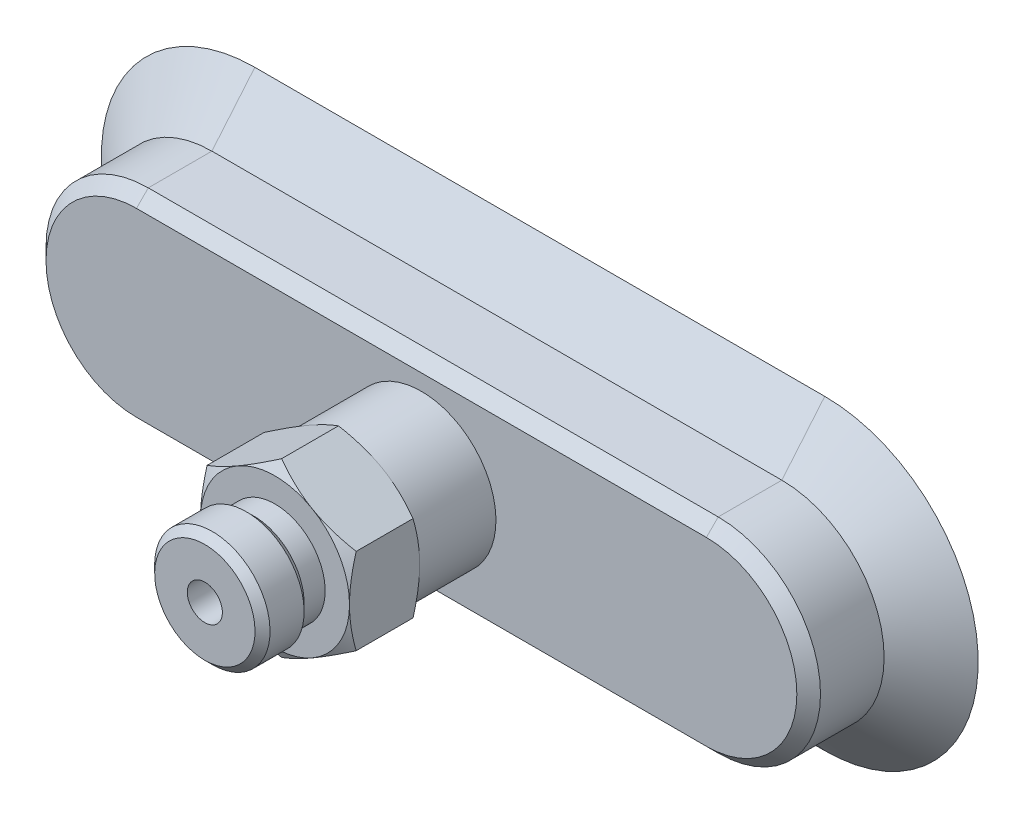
ISO-10303-21;
HEADER;
FILE_DESCRIPTION(('STEP AP214'),'2;1');
FILE_NAME('part.step','',(''),(''),'','','');
FILE_SCHEMA(('AUTOMOTIVE_DESIGN { 1 0 10303 214 1 1 1 1 }'));
ENDSEC;
DATA;
#1=APPLICATION_CONTEXT('core data for automotive mechanical design processes');
#2=APPLICATION_PROTOCOL_DEFINITION('international standard','automotive_design',2000,#1);
#3=PRODUCT_CONTEXT('',#1,'mechanical');
#4=PRODUCT('Part','Part','',(#3));
#5=PRODUCT_RELATED_PRODUCT_CATEGORY('part','',(#4));
#6=PRODUCT_DEFINITION_FORMATION('','',#4);
#7=PRODUCT_DEFINITION_CONTEXT('part definition',#1,'design');
#8=PRODUCT_DEFINITION('design','',#6,#7);
#9=PRODUCT_DEFINITION_SHAPE('','',#8);
#10=(LENGTH_UNIT() NAMED_UNIT(*) SI_UNIT(.MILLI.,.METRE.));
#11=(NAMED_UNIT(*) PLANE_ANGLE_UNIT() SI_UNIT($,.RADIAN.));
#12=(NAMED_UNIT(*) SI_UNIT($,.STERADIAN.) SOLID_ANGLE_UNIT());
#13=UNCERTAINTY_MEASURE_WITH_UNIT(LENGTH_MEASURE(1.E-05),#10,'distance_accuracy_value','');
#14=(GEOMETRIC_REPRESENTATION_CONTEXT(3) GLOBAL_UNCERTAINTY_ASSIGNED_CONTEXT((#13)) GLOBAL_UNIT_ASSIGNED_CONTEXT((#10,
#11,#12)) REPRESENTATION_CONTEXT('',''));
#15=CARTESIAN_POINT('',(0.,0.,0.));
#16=DIRECTION('',(0.,0.,1.));
#17=DIRECTION('',(1.,0.,0.));
#18=AXIS2_PLACEMENT_3D('',#15,#16,#17);
#19=CARTESIAN_POINT('',(-30.125,-3.49999999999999,1.35714285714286));
#20=DIRECTION('',(0.,-1.,0.));
#21=DIRECTION('',(0.,0.,-1.));
#22=AXIS2_PLACEMENT_3D('',#19,#20,#21);
#23=PLANE('',#22);
#24=DIRECTION('',(1.,0.,0.));
#25=VECTOR('',#24,1.);
#26=CARTESIAN_POINT('',(-30.125,-3.49999999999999,3.85714285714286));
#27=LINE('',#26,#25);
#28=CARTESIAN_POINT('',(-15.5,-3.5,3.85714285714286));
#29=VERTEX_POINT('',#28);
#30=CARTESIAN_POINT('',(-10.5,-3.5,3.85714285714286));
#31=VERTEX_POINT('',#30);
#32=EDGE_CURVE('E872',#29,#31,#27,.T.);
#33=ORIENTED_EDGE('',*,*,#32,.F.);
#34=DIRECTION('',(0.,0.,1.));
#35=VECTOR('',#34,1.);
#36=CARTESIAN_POINT('',(-15.5,-3.5,1.35714285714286));
#37=LINE('',#36,#35);
#38=CARTESIAN_POINT('',(-15.5,-3.5,1.35714285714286));
#39=VERTEX_POINT('',#38);
#40=EDGE_CURVE('E1110',#39,#29,#37,.T.);
#41=ORIENTED_EDGE('',*,*,#40,.F.);
#42=DIRECTION('',(1.,0.,0.));
#43=VECTOR('',#42,1.);
#44=CARTESIAN_POINT('',(-30.125,-3.49999999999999,1.35714285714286));
#45=LINE('',#44,#43);
#46=CARTESIAN_POINT('',(-10.5,-3.5,1.35714285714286));
#47=VERTEX_POINT('',#46);
#48=EDGE_CURVE('E1114',#39,#47,#45,.T.);
#49=ORIENTED_EDGE('',*,*,#48,.T.);
#50=DIRECTION('',(0.,0.,1.));
#51=VECTOR('',#50,1.);
#52=CARTESIAN_POINT('',(-10.5,-3.5,1.35714285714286));
#53=LINE('',#52,#51);
#54=EDGE_CURVE('E843',#47,#31,#53,.T.);
#55=ORIENTED_EDGE('',*,*,#54,.T.);
#56=EDGE_LOOP('',(#33,#41,#49,#55));
#57=FACE_BOUND('',#56,.T.);
#58=ADVANCED_FACE('F15',(#57),#23,.T.);
#59=CARTESIAN_POINT('',(-29.9919600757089,-4.89999999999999,1.35714285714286));
#60=DIRECTION('',(0.,-1.,0.));
#61=DIRECTION('',(0.,0.,-1.));
#62=AXIS2_PLACEMENT_3D('',#59,#60,#61);
#63=PLANE('',#62);
#64=DIRECTION('',(0.,0.,-1.));
#65=VECTOR('',#64,1.);
#66=CARTESIAN_POINT('',(-10.9287684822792,-4.9,1.35714285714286));
#67=LINE('',#66,#65);
#68=CARTESIAN_POINT('',(-10.9287684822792,-4.9,3.85714285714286));
#69=VERTEX_POINT('',#68);
#70=CARTESIAN_POINT('',(-10.9287684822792,-4.9,1.35714285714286));
#71=VERTEX_POINT('',#70);
#72=EDGE_CURVE('E726',#69,#71,#67,.T.);
#73=ORIENTED_EDGE('',*,*,#72,.T.);
#74=DIRECTION('',(1.,0.,0.));
#75=VECTOR('',#74,1.);
#76=CARTESIAN_POINT('',(-29.9919600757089,-4.89999999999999,1.35714285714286));
#77=LINE('',#76,#75);
#78=CARTESIAN_POINT('',(-15.0712315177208,-4.9,1.35714285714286));
#79=VERTEX_POINT('',#78);
#80=EDGE_CURVE('E1010',#79,#71,#77,.T.);
#81=ORIENTED_EDGE('',*,*,#80,.F.);
#82=DIRECTION('',(0.,0.,1.));
#83=VECTOR('',#82,1.);
#84=CARTESIAN_POINT('',(-15.0712315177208,-4.9,1.35714285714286));
#85=LINE('',#84,#83);
#86=CARTESIAN_POINT('',(-15.0712315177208,-4.9,3.85714285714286));
#87=VERTEX_POINT('',#86);
#88=EDGE_CURVE('E722',#79,#87,#85,.T.);
#89=ORIENTED_EDGE('',*,*,#88,.T.);
#90=DIRECTION('',(1.,0.,0.));
#91=VECTOR('',#90,1.);
#92=CARTESIAN_POINT('',(-29.9919600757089,-4.89999999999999,3.85714285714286));
#93=LINE('',#92,#91);
#94=EDGE_CURVE('E716',#87,#69,#93,.T.);
#95=ORIENTED_EDGE('',*,*,#94,.T.);
#96=EDGE_LOOP('',(#73,#81,#89,#95));
#97=FACE_BOUND('',#96,.T.);
#98=ADVANCED_FACE('F1740',(#97),#63,.F.);
#99=CARTESIAN_POINT('',(29.9919600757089,4.89999999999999,1.35714285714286));
#100=DIRECTION('',(0.,1.,0.));
#101=DIRECTION('',(-1.,0.,0.));
#102=AXIS2_PLACEMENT_3D('',#99,#100,#101);
#103=PLANE('',#102);
#104=DIRECTION('',(0.,0.,-1.));
#105=VECTOR('',#104,1.);
#106=CARTESIAN_POINT('',(-15.0712315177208,4.9,1.35714285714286));
#107=LINE('',#106,#105);
#108=CARTESIAN_POINT('',(-15.0712315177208,4.9,3.85714285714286));
#109=VERTEX_POINT('',#108);
#110=CARTESIAN_POINT('',(-15.0712315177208,4.9,1.35714285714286));
#111=VERTEX_POINT('',#110);
#112=EDGE_CURVE('E956',#109,#111,#107,.T.);
#113=ORIENTED_EDGE('',*,*,#112,.T.);
#114=DIRECTION('',(-1.,0.,0.));
#115=VECTOR('',#114,1.);
#116=CARTESIAN_POINT('',(29.9919600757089,4.89999999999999,1.35714285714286));
#117=LINE('',#116,#115);
#118=CARTESIAN_POINT('',(-10.9287684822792,4.9,1.35714285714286));
#119=VERTEX_POINT('',#118);
#120=EDGE_CURVE('E725',#119,#111,#117,.T.);
#121=ORIENTED_EDGE('',*,*,#120,.F.);
#122=DIRECTION('',(0.,0.,1.));
#123=VECTOR('',#122,1.);
#124=CARTESIAN_POINT('',(-10.9287684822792,4.9,1.35714285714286));
#125=LINE('',#124,#123);
#126=CARTESIAN_POINT('',(-10.9287684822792,4.9,3.85714285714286));
#127=VERTEX_POINT('',#126);
#128=EDGE_CURVE('E952',#119,#127,#125,.T.);
#129=ORIENTED_EDGE('',*,*,#128,.T.);
#130=DIRECTION('',(-1.,0.,0.));
#131=VECTOR('',#130,1.);
#132=CARTESIAN_POINT('',(29.9919600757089,4.89999999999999,3.85714285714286));
#133=LINE('',#132,#131);
#134=EDGE_CURVE('E777',#127,#109,#133,.T.);
#135=ORIENTED_EDGE('',*,*,#134,.T.);
#136=EDGE_LOOP('',(#113,#121,#129,#135));
#137=FACE_BOUND('',#136,.T.);
#138=ADVANCED_FACE('F2584',(#137),#103,.F.);
#139=CARTESIAN_POINT('',(30.125,3.49999999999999,1.35714285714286));
#140=DIRECTION('',(0.,1.,0.));
#141=DIRECTION('',(-1.,0.,0.));
#142=AXIS2_PLACEMENT_3D('',#139,#140,#141);
#143=PLANE('',#142);
#144=DIRECTION('',(-1.,0.,0.));
#145=VECTOR('',#144,1.);
#146=CARTESIAN_POINT('',(30.125,3.49999999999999,1.35714285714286));
#147=LINE('',#146,#145);
#148=CARTESIAN_POINT('',(-10.5,3.5,1.35714285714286));
#149=VERTEX_POINT('',#148);
#150=CARTESIAN_POINT('',(-15.5,3.5,1.35714285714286));
#151=VERTEX_POINT('',#150);
#152=EDGE_CURVE('E1248',#149,#151,#147,.T.);
#153=ORIENTED_EDGE('',*,*,#152,.T.);
#154=DIRECTION('',(0.,0.,1.));
#155=VECTOR('',#154,1.);
#156=CARTESIAN_POINT('',(-15.5,3.5,1.35714285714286));
#157=LINE('',#156,#155);
#158=CARTESIAN_POINT('',(-15.5,3.5,3.85714285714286));
#159=VERTEX_POINT('',#158);
#160=EDGE_CURVE('E1319',#151,#159,#157,.T.);
#161=ORIENTED_EDGE('',*,*,#160,.T.);
#162=DIRECTION('',(-1.,0.,0.));
#163=VECTOR('',#162,1.);
#164=CARTESIAN_POINT('',(30.125,3.49999999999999,3.85714285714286));
#165=LINE('',#164,#163);
#166=CARTESIAN_POINT('',(-10.5,3.5,3.85714285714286));
#167=VERTEX_POINT('',#166);
#168=EDGE_CURVE('E1011',#167,#159,#165,.T.);
#169=ORIENTED_EDGE('',*,*,#168,.F.);
#170=DIRECTION('',(0.,0.,1.));
#171=VECTOR('',#170,1.);
#172=CARTESIAN_POINT('',(-10.5,3.5,1.35714285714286));
#173=LINE('',#172,#171);
#174=EDGE_CURVE('E1172',#149,#167,#173,.T.);
#175=ORIENTED_EDGE('',*,*,#174,.F.);
#176=EDGE_LOOP('',(#153,#161,#169,#175));
#177=FACE_BOUND('',#176,.T.);
#178=ADVANCED_FACE('F2842',(#177),#143,.T.);
#179=CARTESIAN_POINT('',(-30.125,-0.699999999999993,1.35714285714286));
#180=DIRECTION('',(0.,-1.,0.));
#181=DIRECTION('',(0.,0.,-1.));
#182=AXIS2_PLACEMENT_3D('',#179,#180,#181);
#183=PLANE('',#182);
#184=DIRECTION('',(1.,0.,0.));
#185=VECTOR('',#184,1.);
#186=CARTESIAN_POINT('',(-30.125,-0.699999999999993,3.85714285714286));
#187=LINE('',#186,#185);
#188=CARTESIAN_POINT('',(-15.5,-0.699999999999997,3.85714285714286));
#189=VERTEX_POINT('',#188);
#190=CARTESIAN_POINT('',(-10.5,-0.699999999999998,3.85714285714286));
#191=VERTEX_POINT('',#190);
#192=EDGE_CURVE('E1016',#189,#191,#187,.T.);
#193=ORIENTED_EDGE('',*,*,#192,.F.);
#194=DIRECTION('',(0.,0.,1.));
#195=VECTOR('',#194,1.);
#196=CARTESIAN_POINT('',(-15.5,-0.699999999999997,1.35714285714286));
#197=LINE('',#196,#195);
#198=CARTESIAN_POINT('',(-15.5,-0.699999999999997,1.35714285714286));
#199=VERTEX_POINT('',#198);
#200=EDGE_CURVE('E804',#199,#189,#197,.T.);
#201=ORIENTED_EDGE('',*,*,#200,.F.);
#202=DIRECTION('',(1.,0.,0.));
#203=VECTOR('',#202,1.);
#204=CARTESIAN_POINT('',(-30.125,-0.699999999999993,1.35714285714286));
#205=LINE('',#204,#203);
#206=CARTESIAN_POINT('',(-10.5,-0.699999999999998,1.35714285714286));
#207=VERTEX_POINT('',#206);
#208=EDGE_CURVE('E1243',#199,#207,#205,.T.);
#209=ORIENTED_EDGE('',*,*,#208,.T.);
#210=DIRECTION('',(0.,0.,-1.));
#211=VECTOR('',#210,1.);
#212=CARTESIAN_POINT('',(-10.5,-0.699999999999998,1.35714285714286));
#213=LINE('',#212,#211);
#214=EDGE_CURVE('E1164',#191,#207,#213,.T.);
#215=ORIENTED_EDGE('',*,*,#214,.F.);
#216=EDGE_LOOP('',(#193,#201,#209,#215));
#217=FACE_BOUND('',#216,.T.);
#218=ADVANCED_FACE('F2702',(#217),#183,.T.);
#219=CARTESIAN_POINT('',(30.125,-2.10000000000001,1.35714285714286));
#220=DIRECTION('',(0.,1.,0.));
#221=DIRECTION('',(-1.,0.,0.));
#222=AXIS2_PLACEMENT_3D('',#219,#220,#221);
#223=PLANE('',#222);
#224=DIRECTION('',(-1.,0.,0.));
#225=VECTOR('',#224,1.);
#226=CARTESIAN_POINT('',(30.125,-2.10000000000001,1.35714285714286));
#227=LINE('',#226,#225);
#228=CARTESIAN_POINT('',(-10.5,-2.1,1.35714285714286));
#229=VERTEX_POINT('',#228);
#230=CARTESIAN_POINT('',(-15.5,-2.1,1.35714285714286));
#231=VERTEX_POINT('',#230);
#232=EDGE_CURVE('E1254',#229,#231,#227,.T.);
#233=ORIENTED_EDGE('',*,*,#232,.T.);
#234=DIRECTION('',(0.,0.,-1.));
#235=VECTOR('',#234,1.);
#236=CARTESIAN_POINT('',(-15.5,-2.1,1.35714285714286));
#237=LINE('',#236,#235);
#238=CARTESIAN_POINT('',(-15.5,-2.1,3.85714285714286));
#239=VERTEX_POINT('',#238);
#240=EDGE_CURVE('E996',#239,#231,#237,.T.);
#241=ORIENTED_EDGE('',*,*,#240,.F.);
#242=DIRECTION('',(-1.,0.,0.));
#243=VECTOR('',#242,1.);
#244=CARTESIAN_POINT('',(30.125,-2.10000000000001,3.85714285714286));
#245=LINE('',#244,#243);
#246=CARTESIAN_POINT('',(-10.5,-2.1,3.85714285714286));
#247=VERTEX_POINT('',#246);
#248=EDGE_CURVE('E875',#247,#239,#245,.T.);
#249=ORIENTED_EDGE('',*,*,#248,.F.);
#250=DIRECTION('',(0.,0.,1.));
#251=VECTOR('',#250,1.);
#252=CARTESIAN_POINT('',(-10.5,-2.1,1.35714285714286));
#253=LINE('',#252,#251);
#254=EDGE_CURVE('E947',#229,#247,#253,.T.);
#255=ORIENTED_EDGE('',*,*,#254,.F.);
#256=EDGE_LOOP('',(#233,#241,#249,#255));
#257=FACE_BOUND('',#256,.T.);
#258=ADVANCED_FACE('F3159',(#257),#223,.T.);
#259=CARTESIAN_POINT('',(-30.125,2.10000000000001,1.35714285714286));
#260=DIRECTION('',(0.,-1.,0.));
#261=DIRECTION('',(0.,0.,-1.));
#262=AXIS2_PLACEMENT_3D('',#259,#260,#261);
#263=PLANE('',#262);
#264=DIRECTION('',(1.,0.,0.));
#265=VECTOR('',#264,1.);
#266=CARTESIAN_POINT('',(-30.125,2.10000000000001,3.85714285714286));
#267=LINE('',#266,#265);
#268=CARTESIAN_POINT('',(-15.5,2.1,3.85714285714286));
#269=VERTEX_POINT('',#268);
#270=CARTESIAN_POINT('',(-10.5,2.1,3.85714285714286));
#271=VERTEX_POINT('',#270);
#272=EDGE_CURVE('E1015',#269,#271,#267,.T.);
#273=ORIENTED_EDGE('',*,*,#272,.F.);
#274=DIRECTION('',(0.,0.,1.));
#275=VECTOR('',#274,1.);
#276=CARTESIAN_POINT('',(-15.5,2.1,1.35714285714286));
#277=LINE('',#276,#275);
#278=CARTESIAN_POINT('',(-15.5,2.1,1.35714285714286));
#279=VERTEX_POINT('',#278);
#280=EDGE_CURVE('E1070',#279,#269,#277,.T.);
#281=ORIENTED_EDGE('',*,*,#280,.F.);
#282=DIRECTION('',(1.,0.,0.));
#283=VECTOR('',#282,1.);
#284=CARTESIAN_POINT('',(-30.125,2.10000000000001,1.35714285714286));
#285=LINE('',#284,#283);
#286=CARTESIAN_POINT('',(-10.5,2.1,1.35714285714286));
#287=VERTEX_POINT('',#286);
#288=EDGE_CURVE('E1257',#279,#287,#285,.T.);
#289=ORIENTED_EDGE('',*,*,#288,.T.);
#290=DIRECTION('',(0.,0.,-1.));
#291=VECTOR('',#290,1.);
#292=CARTESIAN_POINT('',(-10.5,2.1,1.35714285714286));
#293=LINE('',#292,#291);
#294=EDGE_CURVE('E1173',#271,#287,#293,.T.);
#295=ORIENTED_EDGE('',*,*,#294,.F.);
#296=EDGE_LOOP('',(#273,#281,#289,#295));
#297=FACE_BOUND('',#296,.T.);
#298=ADVANCED_FACE('F2877',(#297),#263,.T.);
#299=CARTESIAN_POINT('',(30.125,0.699999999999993,1.35714285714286));
#300=DIRECTION('',(0.,1.,0.));
#301=DIRECTION('',(-1.,0.,0.));
#302=AXIS2_PLACEMENT_3D('',#299,#300,#301);
#303=PLANE('',#302);
#304=DIRECTION('',(-1.,0.,0.));
#305=VECTOR('',#304,1.);
#306=CARTESIAN_POINT('',(30.125,0.699999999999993,1.35714285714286));
#307=LINE('',#306,#305);
#308=CARTESIAN_POINT('',(-10.5,0.700000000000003,1.35714285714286));
#309=VERTEX_POINT('',#308);
#310=CARTESIAN_POINT('',(-15.5,0.700000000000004,1.35714285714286));
#311=VERTEX_POINT('',#310);
#312=EDGE_CURVE('E1247',#309,#311,#307,.T.);
#313=ORIENTED_EDGE('',*,*,#312,.T.);
#314=DIRECTION('',(0.,0.,-1.));
#315=VECTOR('',#314,1.);
#316=CARTESIAN_POINT('',(-15.5,0.700000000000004,1.35714285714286));
#317=LINE('',#316,#315);
#318=CARTESIAN_POINT('',(-15.5,0.700000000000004,3.85714285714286));
#319=VERTEX_POINT('',#318);
#320=EDGE_CURVE('E749',#319,#311,#317,.T.);
#321=ORIENTED_EDGE('',*,*,#320,.F.);
#322=DIRECTION('',(-1.,0.,0.));
#323=VECTOR('',#322,1.);
#324=CARTESIAN_POINT('',(30.125,0.699999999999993,3.85714285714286));
#325=LINE('',#324,#323);
#326=CARTESIAN_POINT('',(-10.5,0.700000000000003,3.85714285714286));
#327=VERTEX_POINT('',#326);
#328=EDGE_CURVE('E1020',#327,#319,#325,.T.);
#329=ORIENTED_EDGE('',*,*,#328,.F.);
#330=DIRECTION('',(0.,0.,1.));
#331=VECTOR('',#330,1.);
#332=CARTESIAN_POINT('',(-10.5,0.700000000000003,1.35714285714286));
#333=LINE('',#332,#331);
#334=EDGE_CURVE('E988',#309,#327,#333,.T.);
#335=ORIENTED_EDGE('',*,*,#334,.F.);
#336=EDGE_LOOP('',(#313,#321,#329,#335));
#337=FACE_BOUND('',#336,.T.);
#338=ADVANCED_FACE('F2709',(#337),#303,.T.);
#339=CARTESIAN_POINT('',(-30.125,-3.49999999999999,1.35714285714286));
#340=DIRECTION('',(0.,-1.,0.));
#341=DIRECTION('',(0.,0.,-1.));
#342=AXIS2_PLACEMENT_3D('',#339,#340,#341);
#343=PLANE('',#342);
#344=DIRECTION('',(1.,0.,0.));
#345=VECTOR('',#344,1.);
#346=CARTESIAN_POINT('',(-30.125,-3.49999999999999,3.85714285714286));
#347=LINE('',#346,#345);
#348=CARTESIAN_POINT('',(-30.125,-3.49999999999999,3.85714285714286));
#349=VERTEX_POINT('',#348);
#350=CARTESIAN_POINT('',(-25.125,-3.5,3.85714285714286));
#351=VERTEX_POINT('',#350);
#352=EDGE_CURVE('E941',#349,#351,#347,.T.);
#353=ORIENTED_EDGE('',*,*,#352,.F.);
#354=DIRECTION('',(0.,0.,1.));
#355=VECTOR('',#354,1.);
#356=CARTESIAN_POINT('',(-30.125,-3.49999999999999,1.35714285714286));
#357=LINE('',#356,#355);
#358=CARTESIAN_POINT('',(-30.125,-3.49999999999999,1.35714285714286));
#359=VERTEX_POINT('',#358);
#360=EDGE_CURVE('E748',#359,#349,#357,.T.);
#361=ORIENTED_EDGE('',*,*,#360,.F.);
#362=DIRECTION('',(1.,0.,0.));
#363=VECTOR('',#362,1.);
#364=CARTESIAN_POINT('',(-30.125,-3.49999999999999,1.35714285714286));
#365=LINE('',#364,#363);
#366=CARTESIAN_POINT('',(-25.125,-3.5,1.35714285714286));
#367=VERTEX_POINT('',#366);
#368=EDGE_CURVE('E744',#359,#367,#365,.T.);
#369=ORIENTED_EDGE('',*,*,#368,.T.);
#370=DIRECTION('',(0.,0.,1.));
#371=VECTOR('',#370,1.);
#372=CARTESIAN_POINT('',(-25.125,-3.5,1.35714285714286));
#373=LINE('',#372,#371);
#374=EDGE_CURVE('E1152',#367,#351,#373,.T.);
#375=ORIENTED_EDGE('',*,*,#374,.T.);
#376=EDGE_LOOP('',(#353,#361,#369,#375));
#377=FACE_BOUND('',#376,.T.);
#378=ADVANCED_FACE('F2876',(#377),#343,.T.);
#379=CARTESIAN_POINT('',(-29.9919600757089,-4.89999999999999,1.35714285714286));
#380=DIRECTION('',(0.,-1.,0.));
#381=DIRECTION('',(0.,0.,-1.));
#382=AXIS2_PLACEMENT_3D('',#379,#380,#381);
#383=PLANE('',#382);
#384=DIRECTION('',(0.,0.,-1.));
#385=VECTOR('',#384,1.);
#386=CARTESIAN_POINT('',(-25.5537684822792,-4.9,1.35714285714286));
#387=LINE('',#386,#385);
#388=CARTESIAN_POINT('',(-25.5537684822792,-4.9,3.85714285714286));
#389=VERTEX_POINT('',#388);
#390=CARTESIAN_POINT('',(-25.5537684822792,-4.9,1.35714285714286));
#391=VERTEX_POINT('',#390);
#392=EDGE_CURVE('E1204',#389,#391,#387,.T.);
#393=ORIENTED_EDGE('',*,*,#392,.T.);
#394=DIRECTION('',(1.,0.,0.));
#395=VECTOR('',#394,1.);
#396=CARTESIAN_POINT('',(-29.9919600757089,-4.89999999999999,1.35714285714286));
#397=LINE('',#396,#395);
#398=CARTESIAN_POINT('',(-29.6962315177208,-4.89999999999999,1.35714285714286));
#399=VERTEX_POINT('',#398);
#400=EDGE_CURVE('E921',#399,#391,#397,.T.);
#401=ORIENTED_EDGE('',*,*,#400,.F.);
#402=DIRECTION('',(0.,0.,1.));
#403=VECTOR('',#402,1.);
#404=CARTESIAN_POINT('',(-29.6962315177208,-4.89999999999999,1.35714285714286));
#405=LINE('',#404,#403);
#406=CARTESIAN_POINT('',(-29.6962315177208,-4.89999999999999,3.85714285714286));
#407=VERTEX_POINT('',#406);
#408=EDGE_CURVE('E1207',#399,#407,#405,.T.);
#409=ORIENTED_EDGE('',*,*,#408,.T.);
#410=DIRECTION('',(1.,0.,0.));
#411=VECTOR('',#410,1.);
#412=CARTESIAN_POINT('',(-29.9919600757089,-4.89999999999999,3.85714285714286));
#413=LINE('',#412,#411);
#414=EDGE_CURVE('E1001',#407,#389,#413,.T.);
#415=ORIENTED_EDGE('',*,*,#414,.T.);
#416=EDGE_LOOP('',(#393,#401,#409,#415));
#417=FACE_BOUND('',#416,.T.);
#418=ADVANCED_FACE('F3200',(#417),#383,.F.);
#419=CARTESIAN_POINT('',(29.9919600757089,4.89999999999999,1.35714285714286));
#420=DIRECTION('',(0.,1.,0.));
#421=DIRECTION('',(-1.,0.,0.));
#422=AXIS2_PLACEMENT_3D('',#419,#420,#421);
#423=PLANE('',#422);
#424=DIRECTION('',(0.,0.,-1.));
#425=VECTOR('',#424,1.);
#426=CARTESIAN_POINT('',(-29.6962315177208,4.90000000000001,1.35714285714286));
#427=LINE('',#426,#425);
#428=CARTESIAN_POINT('',(-29.6962315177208,4.90000000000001,3.85714285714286));
#429=VERTEX_POINT('',#428);
#430=CARTESIAN_POINT('',(-29.6962315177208,4.90000000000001,1.35714285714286));
#431=VERTEX_POINT('',#430);
#432=EDGE_CURVE('E898',#429,#431,#427,.T.);
#433=ORIENTED_EDGE('',*,*,#432,.T.);
#434=DIRECTION('',(-1.,0.,0.));
#435=VECTOR('',#434,1.);
#436=CARTESIAN_POINT('',(29.9919600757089,4.89999999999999,1.35714285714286));
#437=LINE('',#436,#435);
#438=CARTESIAN_POINT('',(-25.5537684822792,4.90000000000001,1.35714285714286));
#439=VERTEX_POINT('',#438);
#440=EDGE_CURVE('E2186',#439,#431,#437,.T.);
#441=ORIENTED_EDGE('',*,*,#440,.F.);
#442=DIRECTION('',(0.,0.,1.));
#443=VECTOR('',#442,1.);
#444=CARTESIAN_POINT('',(-25.5537684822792,4.90000000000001,1.35714285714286));
#445=LINE('',#444,#443);
#446=CARTESIAN_POINT('',(-25.5537684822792,4.90000000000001,3.85714285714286));
#447=VERTEX_POINT('',#446);
#448=EDGE_CURVE('E902',#439,#447,#445,.T.);
#449=ORIENTED_EDGE('',*,*,#448,.T.);
#450=DIRECTION('',(-1.,0.,0.));
#451=VECTOR('',#450,1.);
#452=CARTESIAN_POINT('',(29.9919600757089,4.89999999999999,3.85714285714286));
#453=LINE('',#452,#451);
#454=EDGE_CURVE('E1002',#447,#429,#453,.T.);
#455=ORIENTED_EDGE('',*,*,#454,.T.);
#456=EDGE_LOOP('',(#433,#441,#449,#455));
#457=FACE_BOUND('',#456,.T.);
#458=ADVANCED_FACE('F2861',(#457),#423,.F.);
#459=CARTESIAN_POINT('',(30.125,3.49999999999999,1.35714285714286));
#460=DIRECTION('',(0.,1.,0.));
#461=DIRECTION('',(-1.,0.,0.));
#462=AXIS2_PLACEMENT_3D('',#459,#460,#461);
#463=PLANE('',#462);
#464=DIRECTION('',(-1.,0.,0.));
#465=VECTOR('',#464,1.);
#466=CARTESIAN_POINT('',(30.125,3.49999999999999,1.35714285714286));
#467=LINE('',#466,#465);
#468=CARTESIAN_POINT('',(-25.125,3.50000000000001,1.35714285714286));
#469=VERTEX_POINT('',#468);
#470=CARTESIAN_POINT('',(-30.125,3.50000000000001,1.35714285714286));
#471=VERTEX_POINT('',#470);
#472=EDGE_CURVE('E1006',#469,#471,#467,.T.);
#473=ORIENTED_EDGE('',*,*,#472,.T.);
#474=DIRECTION('',(0.,0.,1.));
#475=VECTOR('',#474,1.);
#476=CARTESIAN_POINT('',(-30.125,3.50000000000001,1.35714285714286));
#477=LINE('',#476,#475);
#478=CARTESIAN_POINT('',(-30.125,3.50000000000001,3.85714285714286));
#479=VERTEX_POINT('',#478);
#480=EDGE_CURVE('E861',#471,#479,#477,.T.);
#481=ORIENTED_EDGE('',*,*,#480,.T.);
#482=DIRECTION('',(-1.,0.,0.));
#483=VECTOR('',#482,1.);
#484=CARTESIAN_POINT('',(30.125,3.49999999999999,3.85714285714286));
#485=LINE('',#484,#483);
#486=CARTESIAN_POINT('',(-25.125,3.50000000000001,3.85714285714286));
#487=VERTEX_POINT('',#486);
#488=EDGE_CURVE('E1117',#487,#479,#485,.T.);
#489=ORIENTED_EDGE('',*,*,#488,.F.);
#490=DIRECTION('',(0.,0.,1.));
#491=VECTOR('',#490,1.);
#492=CARTESIAN_POINT('',(-25.125,3.50000000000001,1.35714285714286));
#493=LINE('',#492,#491);
#494=EDGE_CURVE('E867',#469,#487,#493,.T.);
#495=ORIENTED_EDGE('',*,*,#494,.F.);
#496=EDGE_LOOP('',(#473,#481,#489,#495));
#497=FACE_BOUND('',#496,.T.);
#498=ADVANCED_FACE('F2857',(#497),#463,.T.);
#499=CARTESIAN_POINT('',(-30.125,-0.699999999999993,1.35714285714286));
#500=DIRECTION('',(0.,-1.,0.));
#501=DIRECTION('',(0.,0.,-1.));
#502=AXIS2_PLACEMENT_3D('',#499,#500,#501);
#503=PLANE('',#502);
#504=DIRECTION('',(1.,0.,0.));
#505=VECTOR('',#504,1.);
#506=CARTESIAN_POINT('',(-30.125,-0.699999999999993,3.85714285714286));
#507=LINE('',#506,#505);
#508=CARTESIAN_POINT('',(-30.125,-0.699999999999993,3.85714285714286));
#509=VERTEX_POINT('',#508);
#510=CARTESIAN_POINT('',(-25.125,-0.699999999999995,3.85714285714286));
#511=VERTEX_POINT('',#510);
#512=EDGE_CURVE('E1195',#509,#511,#507,.T.);
#513=ORIENTED_EDGE('',*,*,#512,.F.);
#514=DIRECTION('',(0.,0.,1.));
#515=VECTOR('',#514,1.);
#516=CARTESIAN_POINT('',(-30.125,-0.699999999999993,1.35714285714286));
#517=LINE('',#516,#515);
#518=CARTESIAN_POINT('',(-30.125,-0.699999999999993,1.35714285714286));
#519=VERTEX_POINT('',#518);
#520=EDGE_CURVE('E720',#519,#509,#517,.T.);
#521=ORIENTED_EDGE('',*,*,#520,.F.);
#522=DIRECTION('',(1.,0.,0.));
#523=VECTOR('',#522,1.);
#524=CARTESIAN_POINT('',(-30.125,-0.699999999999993,1.35714285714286));
#525=LINE('',#524,#523);
#526=CARTESIAN_POINT('',(-25.125,-0.699999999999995,1.35714285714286));
#527=VERTEX_POINT('',#526);
#528=EDGE_CURVE('E1039',#519,#527,#525,.T.);
#529=ORIENTED_EDGE('',*,*,#528,.T.);
#530=DIRECTION('',(0.,0.,-1.));
#531=VECTOR('',#530,1.);
#532=CARTESIAN_POINT('',(-25.125,-0.699999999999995,1.35714285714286));
#533=LINE('',#532,#531);
#534=EDGE_CURVE('E732',#511,#527,#533,.T.);
#535=ORIENTED_EDGE('',*,*,#534,.F.);
#536=EDGE_LOOP('',(#513,#521,#529,#535));
#537=FACE_BOUND('',#536,.T.);
#538=ADVANCED_FACE('F2860',(#537),#503,.T.);
#539=CARTESIAN_POINT('',(30.125,-2.10000000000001,1.35714285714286));
#540=DIRECTION('',(0.,1.,0.));
#541=DIRECTION('',(-1.,0.,0.));
#542=AXIS2_PLACEMENT_3D('',#539,#540,#541);
#543=PLANE('',#542);
#544=DIRECTION('',(-1.,0.,0.));
#545=VECTOR('',#544,1.);
#546=CARTESIAN_POINT('',(30.125,-2.10000000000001,1.35714285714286));
#547=LINE('',#546,#545);
#548=CARTESIAN_POINT('',(-25.125,-2.09999999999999,1.35714285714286));
#549=VERTEX_POINT('',#548);
#550=CARTESIAN_POINT('',(-30.125,-2.09999999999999,1.35714285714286));
#551=VERTEX_POINT('',#550);
#552=EDGE_CURVE('E747',#549,#551,#547,.T.);
#553=ORIENTED_EDGE('',*,*,#552,.T.);
#554=DIRECTION('',(0.,0.,1.));
#555=VECTOR('',#554,1.);
#556=CARTESIAN_POINT('',(-30.125,-2.09999999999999,1.35714285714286));
#557=LINE('',#556,#555);
#558=CARTESIAN_POINT('',(-30.125,-2.09999999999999,3.85714285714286));
#559=VERTEX_POINT('',#558);
#560=EDGE_CURVE('E965',#551,#559,#557,.T.);
#561=ORIENTED_EDGE('',*,*,#560,.T.);
#562=DIRECTION('',(-1.,0.,0.));
#563=VECTOR('',#562,1.);
#564=CARTESIAN_POINT('',(30.125,-2.10000000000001,3.85714285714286));
#565=LINE('',#564,#563);
#566=CARTESIAN_POINT('',(-25.125,-2.09999999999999,3.85714285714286));
#567=VERTEX_POINT('',#566);
#568=EDGE_CURVE('E945',#567,#559,#565,.T.);
#569=ORIENTED_EDGE('',*,*,#568,.F.);
#570=DIRECTION('',(0.,0.,1.));
#571=VECTOR('',#570,1.);
#572=CARTESIAN_POINT('',(-25.125,-2.09999999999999,1.35714285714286));
#573=LINE('',#572,#571);
#574=EDGE_CURVE('E935',#549,#567,#573,.T.);
#575=ORIENTED_EDGE('',*,*,#574,.F.);
#576=EDGE_LOOP('',(#553,#561,#569,#575));
#577=FACE_BOUND('',#576,.T.);
#578=ADVANCED_FACE('F2855',(#577),#543,.T.);
#579=CARTESIAN_POINT('',(-30.125,2.10000000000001,1.35714285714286));
#580=DIRECTION('',(0.,-1.,0.));
#581=DIRECTION('',(0.,0.,-1.));
#582=AXIS2_PLACEMENT_3D('',#579,#580,#581);
#583=PLANE('',#582);
#584=DIRECTION('',(1.,0.,0.));
#585=VECTOR('',#584,1.);
#586=CARTESIAN_POINT('',(-30.125,2.10000000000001,3.85714285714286));
#587=LINE('',#586,#585);
#588=CARTESIAN_POINT('',(-30.125,2.10000000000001,3.85714285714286));
#589=VERTEX_POINT('',#588);
#590=CARTESIAN_POINT('',(-25.125,2.10000000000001,3.85714285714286));
#591=VERTEX_POINT('',#590);
#592=EDGE_CURVE('E959',#589,#591,#587,.T.);
#593=ORIENTED_EDGE('',*,*,#592,.F.);
#594=DIRECTION('',(0.,0.,1.));
#595=VECTOR('',#594,1.);
#596=CARTESIAN_POINT('',(-30.125,2.10000000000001,1.35714285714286));
#597=LINE('',#596,#595);
#598=CARTESIAN_POINT('',(-30.125,2.10000000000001,1.35714285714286));
#599=VERTEX_POINT('',#598);
#600=EDGE_CURVE('E1151',#599,#589,#597,.T.);
#601=ORIENTED_EDGE('',*,*,#600,.F.);
#602=DIRECTION('',(1.,0.,0.));
#603=VECTOR('',#602,1.);
#604=CARTESIAN_POINT('',(-30.125,2.10000000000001,1.35714285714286));
#605=LINE('',#604,#603);
#606=CARTESIAN_POINT('',(-25.125,2.10000000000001,1.35714285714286));
#607=VERTEX_POINT('',#606);
#608=EDGE_CURVE('E1003',#599,#607,#605,.T.);
#609=ORIENTED_EDGE('',*,*,#608,.T.);
#610=DIRECTION('',(0.,0.,-1.));
#611=VECTOR('',#610,1.);
#612=CARTESIAN_POINT('',(-25.125,2.10000000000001,1.35714285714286));
#613=LINE('',#612,#611);
#614=EDGE_CURVE('E891',#591,#607,#613,.T.);
#615=ORIENTED_EDGE('',*,*,#614,.F.);
#616=EDGE_LOOP('',(#593,#601,#609,#615));
#617=FACE_BOUND('',#616,.T.);
#618=ADVANCED_FACE('F2851',(#617),#583,.T.);
#619=CARTESIAN_POINT('',(30.125,0.699999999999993,1.35714285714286));
#620=DIRECTION('',(0.,1.,0.));
#621=DIRECTION('',(-1.,0.,0.));
#622=AXIS2_PLACEMENT_3D('',#619,#620,#621);
#623=PLANE('',#622);
#624=DIRECTION('',(-1.,0.,0.));
#625=VECTOR('',#624,1.);
#626=CARTESIAN_POINT('',(30.125,0.699999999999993,1.35714285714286));
#627=LINE('',#626,#625);
#628=CARTESIAN_POINT('',(-25.125,0.700000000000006,1.35714285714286));
#629=VERTEX_POINT('',#628);
#630=CARTESIAN_POINT('',(-30.125,0.700000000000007,1.35714285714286));
#631=VERTEX_POINT('',#630);
#632=EDGE_CURVE('E1042',#629,#631,#627,.T.);
#633=ORIENTED_EDGE('',*,*,#632,.T.);
#634=DIRECTION('',(0.,0.,1.));
#635=VECTOR('',#634,1.);
#636=CARTESIAN_POINT('',(-30.125,0.700000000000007,1.35714285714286));
#637=LINE('',#636,#635);
#638=CARTESIAN_POINT('',(-30.125,0.700000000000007,3.85714285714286));
#639=VERTEX_POINT('',#638);
#640=EDGE_CURVE('E836',#631,#639,#637,.T.);
#641=ORIENTED_EDGE('',*,*,#640,.T.);
#642=DIRECTION('',(-1.,0.,0.));
#643=VECTOR('',#642,1.);
#644=CARTESIAN_POINT('',(30.125,0.699999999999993,3.85714285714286));
#645=LINE('',#644,#643);
#646=CARTESIAN_POINT('',(-25.125,0.700000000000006,3.85714285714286));
#647=VERTEX_POINT('',#646);
#648=EDGE_CURVE('E946',#647,#639,#645,.T.);
#649=ORIENTED_EDGE('',*,*,#648,.F.);
#650=DIRECTION('',(0.,0.,1.));
#651=VECTOR('',#650,1.);
#652=CARTESIAN_POINT('',(-25.125,0.700000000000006,1.35714285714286));
#653=LINE('',#652,#651);
#654=EDGE_CURVE('E816',#629,#647,#653,.T.);
#655=ORIENTED_EDGE('',*,*,#654,.F.);
#656=EDGE_LOOP('',(#633,#641,#649,#655));
#657=FACE_BOUND('',#656,.T.);
#658=ADVANCED_FACE('F2854',(#657),#623,.T.);
#659=CARTESIAN_POINT('',(-30.125,-3.49999999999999,1.35714285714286));
#660=DIRECTION('',(0.,-1.,0.));
#661=DIRECTION('',(0.,0.,-1.));
#662=AXIS2_PLACEMENT_3D('',#659,#660,#661);
#663=PLANE('',#662);
#664=DIRECTION('',(1.,0.,0.));
#665=VECTOR('',#664,1.);
#666=CARTESIAN_POINT('',(-30.125,-3.49999999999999,3.85714285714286));
#667=LINE('',#666,#665);
#668=CARTESIAN_POINT('',(10.5,-3.5,3.85714285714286));
#669=VERTEX_POINT('',#668);
#670=CARTESIAN_POINT('',(15.5,-3.5,3.85714285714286));
#671=VERTEX_POINT('',#670);
#672=EDGE_CURVE('E1230',#669,#671,#667,.T.);
#673=ORIENTED_EDGE('',*,*,#672,.F.);
#674=DIRECTION('',(0.,0.,1.));
#675=VECTOR('',#674,1.);
#676=CARTESIAN_POINT('',(10.5,-3.5,1.35714285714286));
#677=LINE('',#676,#675);
#678=CARTESIAN_POINT('',(10.5,-3.5,1.35714285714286));
#679=VERTEX_POINT('',#678);
#680=EDGE_CURVE('E1157',#679,#669,#677,.T.);
#681=ORIENTED_EDGE('',*,*,#680,.F.);
#682=DIRECTION('',(1.,0.,0.));
#683=VECTOR('',#682,1.);
#684=CARTESIAN_POINT('',(-30.125,-3.49999999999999,1.35714285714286));
#685=LINE('',#684,#683);
#686=CARTESIAN_POINT('',(15.5,-3.5,1.35714285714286));
#687=VERTEX_POINT('',#686);
#688=EDGE_CURVE('E1153',#679,#687,#685,.T.);
#689=ORIENTED_EDGE('',*,*,#688,.T.);
#690=DIRECTION('',(0.,0.,1.));
#691=VECTOR('',#690,1.);
#692=CARTESIAN_POINT('',(15.5,-3.5,1.35714285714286));
#693=LINE('',#692,#691);
#694=EDGE_CURVE('E1122',#687,#671,#693,.T.);
#695=ORIENTED_EDGE('',*,*,#694,.T.);
#696=EDGE_LOOP('',(#673,#681,#689,#695));
#697=FACE_BOUND('',#696,.T.);
#698=ADVANCED_FACE('F3243',(#697),#663,.T.);
#699=CARTESIAN_POINT('',(-29.9919600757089,-4.89999999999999,1.35714285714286));
#700=DIRECTION('',(0.,-1.,0.));
#701=DIRECTION('',(0.,0.,-1.));
#702=AXIS2_PLACEMENT_3D('',#699,#700,#701);
#703=PLANE('',#702);
#704=DIRECTION('',(0.,0.,-1.));
#705=VECTOR('',#704,1.);
#706=CARTESIAN_POINT('',(15.0712315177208,-4.9,1.35714285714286));
#707=LINE('',#706,#705);
#708=CARTESIAN_POINT('',(15.0712315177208,-4.9,3.85714285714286));
#709=VERTEX_POINT('',#708);
#710=CARTESIAN_POINT('',(15.0712315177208,-4.9,1.35714285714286));
#711=VERTEX_POINT('',#710);
#712=EDGE_CURVE('E696',#709,#711,#707,.T.);
#713=ORIENTED_EDGE('',*,*,#712,.T.);
#714=DIRECTION('',(1.,0.,0.));
#715=VECTOR('',#714,1.);
#716=CARTESIAN_POINT('',(-29.9919600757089,-4.89999999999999,1.35714285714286));
#717=LINE('',#716,#715);
#718=CARTESIAN_POINT('',(10.9287684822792,-4.9,1.35714285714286));
#719=VERTEX_POINT('',#718);
#720=EDGE_CURVE('E690',#719,#711,#717,.T.);
#721=ORIENTED_EDGE('',*,*,#720,.F.);
#722=DIRECTION('',(0.,0.,1.));
#723=VECTOR('',#722,1.);
#724=CARTESIAN_POINT('',(10.9287684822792,-4.9,1.35714285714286));
#725=LINE('',#724,#723);
#726=CARTESIAN_POINT('',(10.9287684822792,-4.9,3.85714285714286));
#727=VERTEX_POINT('',#726);
#728=EDGE_CURVE('E684',#719,#727,#725,.T.);
#729=ORIENTED_EDGE('',*,*,#728,.T.);
#730=DIRECTION('',(1.,0.,0.));
#731=VECTOR('',#730,1.);
#732=CARTESIAN_POINT('',(-29.9919600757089,-4.89999999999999,3.85714285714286));
#733=LINE('',#732,#731);
#734=EDGE_CURVE('E688',#727,#709,#733,.T.);
#735=ORIENTED_EDGE('',*,*,#734,.T.);
#736=EDGE_LOOP('',(#713,#721,#729,#735));
#737=FACE_BOUND('',#736,.T.);
#738=ADVANCED_FACE('F686',(#737),#703,.F.);
#739=CARTESIAN_POINT('',(29.9919600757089,4.89999999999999,1.35714285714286));
#740=DIRECTION('',(0.,1.,0.));
#741=DIRECTION('',(-1.,0.,0.));
#742=AXIS2_PLACEMENT_3D('',#739,#740,#741);
#743=PLANE('',#742);
#744=DIRECTION('',(0.,0.,-1.));
#745=VECTOR('',#744,1.);
#746=CARTESIAN_POINT('',(10.9287684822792,4.9,1.35714285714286));
#747=LINE('',#746,#745);
#748=CARTESIAN_POINT('',(10.9287684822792,4.9,3.85714285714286));
#749=VERTEX_POINT('',#748);
#750=CARTESIAN_POINT('',(10.9287684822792,4.9,1.35714285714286));
#751=VERTEX_POINT('',#750);
#752=EDGE_CURVE('E783',#749,#751,#747,.T.);
#753=ORIENTED_EDGE('',*,*,#752,.T.);
#754=DIRECTION('',(-1.,0.,0.));
#755=VECTOR('',#754,1.);
#756=CARTESIAN_POINT('',(29.9919600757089,4.89999999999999,1.35714285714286));
#757=LINE('',#756,#755);
#758=CARTESIAN_POINT('',(15.0712315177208,4.9,1.35714285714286));
#759=VERTEX_POINT('',#758);
#760=EDGE_CURVE('E695',#759,#751,#757,.T.);
#761=ORIENTED_EDGE('',*,*,#760,.F.);
#762=DIRECTION('',(0.,0.,1.));
#763=VECTOR('',#762,1.);
#764=CARTESIAN_POINT('',(15.0712315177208,4.9,1.35714285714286));
#765=LINE('',#764,#763);
#766=CARTESIAN_POINT('',(15.0712315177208,4.9,3.85714285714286));
#767=VERTEX_POINT('',#766);
#768=EDGE_CURVE('E779',#759,#767,#765,.T.);
#769=ORIENTED_EDGE('',*,*,#768,.T.);
#770=DIRECTION('',(-1.,0.,0.));
#771=VECTOR('',#770,1.);
#772=CARTESIAN_POINT('',(29.9919600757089,4.89999999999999,3.85714285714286));
#773=LINE('',#772,#771);
#774=EDGE_CURVE('E778',#767,#749,#773,.T.);
#775=ORIENTED_EDGE('',*,*,#774,.T.);
#776=EDGE_LOOP('',(#753,#761,#769,#775));
#777=FACE_BOUND('',#776,.T.);
#778=ADVANCED_FACE('F2649',(#777),#743,.F.);
#779=CARTESIAN_POINT('',(30.125,3.49999999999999,1.35714285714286));
#780=DIRECTION('',(0.,1.,0.));
#781=DIRECTION('',(-1.,0.,0.));
#782=AXIS2_PLACEMENT_3D('',#779,#780,#781);
#783=PLANE('',#782);
#784=DIRECTION('',(-1.,0.,0.));
#785=VECTOR('',#784,1.);
#786=CARTESIAN_POINT('',(30.125,3.49999999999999,1.35714285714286));
#787=LINE('',#786,#785);
#788=CARTESIAN_POINT('',(15.5,3.5,1.35714285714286));
#789=VERTEX_POINT('',#788);
#790=CARTESIAN_POINT('',(10.5,3.5,1.35714285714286));
#791=VERTEX_POINT('',#790);
#792=EDGE_CURVE('E820',#789,#791,#787,.T.);
#793=ORIENTED_EDGE('',*,*,#792,.T.);
#794=DIRECTION('',(0.,0.,1.));
#795=VECTOR('',#794,1.);
#796=CARTESIAN_POINT('',(10.5,3.5,1.35714285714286));
#797=LINE('',#796,#795);
#798=CARTESIAN_POINT('',(10.5,3.5,3.85714285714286));
#799=VERTEX_POINT('',#798);
#800=EDGE_CURVE('E855',#791,#799,#797,.T.);
#801=ORIENTED_EDGE('',*,*,#800,.T.);
#802=DIRECTION('',(-1.,0.,0.));
#803=VECTOR('',#802,1.);
#804=CARTESIAN_POINT('',(30.125,3.49999999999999,3.85714285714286));
#805=LINE('',#804,#803);
#806=CARTESIAN_POINT('',(15.5,3.5,3.85714285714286));
#807=VERTEX_POINT('',#806);
#808=EDGE_CURVE('E892',#807,#799,#805,.T.);
#809=ORIENTED_EDGE('',*,*,#808,.F.);
#810=DIRECTION('',(0.,0.,1.));
#811=VECTOR('',#810,1.);
#812=CARTESIAN_POINT('',(15.5,3.5,1.35714285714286));
#813=LINE('',#812,#811);
#814=EDGE_CURVE('E1414',#789,#807,#813,.T.);
#815=ORIENTED_EDGE('',*,*,#814,.F.);
#816=EDGE_LOOP('',(#793,#801,#809,#815));
#817=FACE_BOUND('',#816,.T.);
#818=ADVANCED_FACE('F2652',(#817),#783,.T.);
#819=CARTESIAN_POINT('',(-30.125,-0.699999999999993,1.35714285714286));
#820=DIRECTION('',(0.,-1.,0.));
#821=DIRECTION('',(0.,0.,-1.));
#822=AXIS2_PLACEMENT_3D('',#819,#820,#821);
#823=PLANE('',#822);
#824=DIRECTION('',(1.,0.,0.));
#825=VECTOR('',#824,1.);
#826=CARTESIAN_POINT('',(-30.125,-0.699999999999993,3.85714285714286));
#827=LINE('',#826,#825);
#828=CARTESIAN_POINT('',(10.5,-0.700000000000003,3.85714285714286));
#829=VERTEX_POINT('',#828);
#830=CARTESIAN_POINT('',(15.5,-0.700000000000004,3.85714285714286));
#831=VERTEX_POINT('',#830);
#832=EDGE_CURVE('E1353',#829,#831,#827,.T.);
#833=ORIENTED_EDGE('',*,*,#832,.F.);
#834=DIRECTION('',(0.,0.,1.));
#835=VECTOR('',#834,1.);
#836=CARTESIAN_POINT('',(10.5,-0.700000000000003,1.35714285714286));
#837=LINE('',#836,#835);
#838=CARTESIAN_POINT('',(10.5,-0.700000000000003,1.35714285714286));
#839=VERTEX_POINT('',#838);
#840=EDGE_CURVE('E827',#839,#829,#837,.T.);
#841=ORIENTED_EDGE('',*,*,#840,.F.);
#842=DIRECTION('',(1.,0.,0.));
#843=VECTOR('',#842,1.);
#844=CARTESIAN_POINT('',(-30.125,-0.699999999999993,1.35714285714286));
#845=LINE('',#844,#843);
#846=CARTESIAN_POINT('',(15.5,-0.700000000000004,1.35714285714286));
#847=VERTEX_POINT('',#846);
#848=EDGE_CURVE('E964',#839,#847,#845,.T.);
#849=ORIENTED_EDGE('',*,*,#848,.T.);
#850=DIRECTION('',(0.,0.,-1.));
#851=VECTOR('',#850,1.);
#852=CARTESIAN_POINT('',(15.5,-0.700000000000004,1.35714285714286));
#853=LINE('',#852,#851);
#854=EDGE_CURVE('E1357',#831,#847,#853,.T.);
#855=ORIENTED_EDGE('',*,*,#854,.F.);
#856=EDGE_LOOP('',(#833,#841,#849,#855));
#857=FACE_BOUND('',#856,.T.);
#858=ADVANCED_FACE('F2656',(#857),#823,.T.);
#859=CARTESIAN_POINT('',(30.125,-2.10000000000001,1.35714285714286));
#860=DIRECTION('',(0.,1.,0.));
#861=DIRECTION('',(-1.,0.,0.));
#862=AXIS2_PLACEMENT_3D('',#859,#860,#861);
#863=PLANE('',#862);
#864=DIRECTION('',(-1.,0.,0.));
#865=VECTOR('',#864,1.);
#866=CARTESIAN_POINT('',(30.125,-2.10000000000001,1.35714285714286));
#867=LINE('',#866,#865);
#868=CARTESIAN_POINT('',(15.5,-2.1,1.35714285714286));
#869=VERTEX_POINT('',#868);
#870=CARTESIAN_POINT('',(10.5,-2.1,1.35714285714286));
#871=VERTEX_POINT('',#870);
#872=EDGE_CURVE('E821',#869,#871,#867,.T.);
#873=ORIENTED_EDGE('',*,*,#872,.T.);
#874=DIRECTION('',(0.,0.,-1.));
#875=VECTOR('',#874,1.);
#876=CARTESIAN_POINT('',(10.5,-2.1,1.35714285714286));
#877=LINE('',#876,#875);
#878=CARTESIAN_POINT('',(10.5,-2.1,3.85714285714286));
#879=VERTEX_POINT('',#878);
#880=EDGE_CURVE('E1105',#879,#871,#877,.T.);
#881=ORIENTED_EDGE('',*,*,#880,.F.);
#882=DIRECTION('',(-1.,0.,0.));
#883=VECTOR('',#882,1.);
#884=CARTESIAN_POINT('',(30.125,-2.10000000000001,3.85714285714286));
#885=LINE('',#884,#883);
#886=CARTESIAN_POINT('',(15.5,-2.1,3.85714285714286));
#887=VERTEX_POINT('',#886);
#888=EDGE_CURVE('E812',#887,#879,#885,.T.);
#889=ORIENTED_EDGE('',*,*,#888,.F.);
#890=DIRECTION('',(0.,0.,1.));
#891=VECTOR('',#890,1.);
#892=CARTESIAN_POINT('',(15.5,-2.1,1.35714285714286));
#893=LINE('',#892,#891);
#894=EDGE_CURVE('E1050',#869,#887,#893,.T.);
#895=ORIENTED_EDGE('',*,*,#894,.F.);
#896=EDGE_LOOP('',(#873,#881,#889,#895));
#897=FACE_BOUND('',#896,.T.);
#898=ADVANCED_FACE('F3012',(#897),#863,.T.);
#899=CARTESIAN_POINT('',(-30.125,2.10000000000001,1.35714285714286));
#900=DIRECTION('',(0.,-1.,0.));
#901=DIRECTION('',(0.,0.,-1.));
#902=AXIS2_PLACEMENT_3D('',#899,#900,#901);
#903=PLANE('',#902);
#904=DIRECTION('',(1.,0.,0.));
#905=VECTOR('',#904,1.);
#906=CARTESIAN_POINT('',(-30.125,2.10000000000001,3.85714285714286));
#907=LINE('',#906,#905);
#908=CARTESIAN_POINT('',(10.5,2.1,3.85714285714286));
#909=VERTEX_POINT('',#908);
#910=CARTESIAN_POINT('',(15.5,2.1,3.85714285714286));
#911=VERTEX_POINT('',#910);
#912=EDGE_CURVE('E897',#909,#911,#907,.T.);
#913=ORIENTED_EDGE('',*,*,#912,.F.);
#914=DIRECTION('',(0.,0.,1.));
#915=VECTOR('',#914,1.);
#916=CARTESIAN_POINT('',(10.5,2.1,1.35714285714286));
#917=LINE('',#916,#915);
#918=CARTESIAN_POINT('',(10.5,2.1,1.35714285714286));
#919=VERTEX_POINT('',#918);
#920=EDGE_CURVE('E983',#919,#909,#917,.T.);
#921=ORIENTED_EDGE('',*,*,#920,.F.);
#922=DIRECTION('',(1.,0.,0.));
#923=VECTOR('',#922,1.);
#924=CARTESIAN_POINT('',(-30.125,2.10000000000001,1.35714285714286));
#925=LINE('',#924,#923);
#926=CARTESIAN_POINT('',(15.5,2.1,1.35714285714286));
#927=VERTEX_POINT('',#926);
#928=EDGE_CURVE('E817',#919,#927,#925,.T.);
#929=ORIENTED_EDGE('',*,*,#928,.T.);
#930=DIRECTION('',(0.,0.,-1.));
#931=VECTOR('',#930,1.);
#932=CARTESIAN_POINT('',(15.5,2.1,1.35714285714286));
#933=LINE('',#932,#931);
#934=EDGE_CURVE('E920',#911,#927,#933,.T.);
#935=ORIENTED_EDGE('',*,*,#934,.F.);
#936=EDGE_LOOP('',(#913,#921,#929,#935));
#937=FACE_BOUND('',#936,.T.);
#938=ADVANCED_FACE('F1970',(#937),#903,.T.);
#939=CARTESIAN_POINT('',(30.125,0.699999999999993,1.35714285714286));
#940=DIRECTION('',(0.,1.,0.));
#941=DIRECTION('',(-1.,0.,0.));
#942=AXIS2_PLACEMENT_3D('',#939,#940,#941);
#943=PLANE('',#942);
#944=DIRECTION('',(-1.,0.,0.));
#945=VECTOR('',#944,1.);
#946=CARTESIAN_POINT('',(30.125,0.699999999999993,1.35714285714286));
#947=LINE('',#946,#945);
#948=CARTESIAN_POINT('',(15.5,0.699999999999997,1.35714285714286));
#949=VERTEX_POINT('',#948);
#950=CARTESIAN_POINT('',(10.5,0.699999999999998,1.35714285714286));
#951=VERTEX_POINT('',#950);
#952=EDGE_CURVE('E960',#949,#951,#947,.T.);
#953=ORIENTED_EDGE('',*,*,#952,.T.);
#954=DIRECTION('',(0.,0.,-1.));
#955=VECTOR('',#954,1.);
#956=CARTESIAN_POINT('',(10.5,0.699999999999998,1.35714285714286));
#957=LINE('',#956,#955);
#958=CARTESIAN_POINT('',(10.5,0.699999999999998,3.85714285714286));
#959=VERTEX_POINT('',#958);
#960=EDGE_CURVE('E826',#959,#951,#957,.T.);
#961=ORIENTED_EDGE('',*,*,#960,.F.);
#962=DIRECTION('',(-1.,0.,0.));
#963=VECTOR('',#962,1.);
#964=CARTESIAN_POINT('',(30.125,0.699999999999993,3.85714285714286));
#965=LINE('',#964,#963);
#966=CARTESIAN_POINT('',(15.5,0.699999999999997,3.85714285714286));
#967=VERTEX_POINT('',#966);
#968=EDGE_CURVE('E1369',#967,#959,#965,.T.);
#969=ORIENTED_EDGE('',*,*,#968,.F.);
#970=DIRECTION('',(0.,0.,1.));
#971=VECTOR('',#970,1.);
#972=CARTESIAN_POINT('',(15.5,0.699999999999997,1.35714285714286));
#973=LINE('',#972,#971);
#974=EDGE_CURVE('E849',#949,#967,#973,.T.);
#975=ORIENTED_EDGE('',*,*,#974,.F.);
#976=EDGE_LOOP('',(#953,#961,#969,#975));
#977=FACE_BOUND('',#976,.T.);
#978=ADVANCED_FACE('F2795',(#977),#943,.T.);
#979=CARTESIAN_POINT('',(-30.125,-3.49999999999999,1.35714285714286));
#980=DIRECTION('',(0.,-1.,0.));
#981=DIRECTION('',(0.,0.,-1.));
#982=AXIS2_PLACEMENT_3D('',#979,#980,#981);
#983=PLANE('',#982);
#984=DIRECTION('',(1.,0.,0.));
#985=VECTOR('',#984,1.);
#986=CARTESIAN_POINT('',(27.625,-3.50000000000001,1.35714285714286));
#987=LINE('',#986,#985);
#988=CARTESIAN_POINT('',(25.125,-3.50000000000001,1.35714285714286));
#989=VERTEX_POINT('',#988);
#990=CARTESIAN_POINT('',(30.125,-3.50000000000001,1.35714285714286));
#991=VERTEX_POINT('',#990);
#992=EDGE_CURVE('E788',#989,#991,#987,.T.);
#993=ORIENTED_EDGE('',*,*,#992,.T.);
#994=DIRECTION('',(0.,0.,1.));
#995=VECTOR('',#994,1.);
#996=CARTESIAN_POINT('',(30.125,-3.50000000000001,1.35714285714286));
#997=LINE('',#996,#995);
#998=CARTESIAN_POINT('',(30.125,-3.50000000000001,3.85714285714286));
#999=VERTEX_POINT('',#998);
#1000=EDGE_CURVE('E1175',#991,#999,#997,.T.);
#1001=ORIENTED_EDGE('',*,*,#1000,.T.);
#1002=DIRECTION('',(1.,0.,0.));
#1003=VECTOR('',#1002,1.);
#1004=CARTESIAN_POINT('',(-30.125,-3.49999999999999,3.85714285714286));
#1005=LINE('',#1004,#1003);
#1006=CARTESIAN_POINT('',(25.125,-3.50000000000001,3.85714285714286));
#1007=VERTEX_POINT('',#1006);
#1008=EDGE_CURVE('E808',#1007,#999,#1005,.T.);
#1009=ORIENTED_EDGE('',*,*,#1008,.F.);
#1010=DIRECTION('',(0.,0.,1.));
#1011=VECTOR('',#1010,1.);
#1012=CARTESIAN_POINT('',(25.125,-3.50000000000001,1.35714285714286));
#1013=LINE('',#1012,#1011);
#1014=EDGE_CURVE('E759',#989,#1007,#1013,.T.);
#1015=ORIENTED_EDGE('',*,*,#1014,.F.);
#1016=EDGE_LOOP('',(#993,#1001,#1009,#1015));
#1017=FACE_BOUND('',#1016,.T.);
#1018=ADVANCED_FACE('F1859',(#1017),#983,.T.);
#1019=CARTESIAN_POINT('',(-29.9919600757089,-4.89999999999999,1.35714285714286));
#1020=DIRECTION('',(0.,-1.,0.));
#1021=DIRECTION('',(0.,0.,-1.));
#1022=AXIS2_PLACEMENT_3D('',#1019,#1020,#1021);
#1023=PLANE('',#1022);
#1024=DIRECTION('',(0.,0.,-1.));
#1025=VECTOR('',#1024,1.);
#1026=CARTESIAN_POINT('',(29.6962315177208,-4.90000000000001,1.35714285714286));
#1027=LINE('',#1026,#1025);
#1028=CARTESIAN_POINT('',(29.6962315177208,-4.90000000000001,3.85714285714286));
#1029=VERTEX_POINT('',#1028);
#1030=CARTESIAN_POINT('',(29.6962315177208,-4.90000000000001,1.35714285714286));
#1031=VERTEX_POINT('',#1030);
#1032=EDGE_CURVE('E828',#1029,#1031,#1027,.T.);
#1033=ORIENTED_EDGE('',*,*,#1032,.T.);
#1034=DIRECTION('',(1.,0.,0.));
#1035=VECTOR('',#1034,1.);
#1036=CARTESIAN_POINT('',(27.625,-4.90000000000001,1.35714285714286));
#1037=LINE('',#1036,#1035);
#1038=CARTESIAN_POINT('',(25.5537684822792,-4.90000000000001,1.35714285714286));
#1039=VERTEX_POINT('',#1038);
#1040=EDGE_CURVE('E1057',#1039,#1031,#1037,.T.);
#1041=ORIENTED_EDGE('',*,*,#1040,.F.);
#1042=DIRECTION('',(0.,0.,1.));
#1043=VECTOR('',#1042,1.);
#1044=CARTESIAN_POINT('',(25.5537684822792,-4.90000000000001,1.35714285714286));
#1045=LINE('',#1044,#1043);
#1046=CARTESIAN_POINT('',(25.5537684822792,-4.90000000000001,3.85714285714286));
#1047=VERTEX_POINT('',#1046);
#1048=EDGE_CURVE('E28',#1039,#1047,#1045,.T.);
#1049=ORIENTED_EDGE('',*,*,#1048,.T.);
#1050=DIRECTION('',(1.,0.,0.));
#1051=VECTOR('',#1050,1.);
#1052=CARTESIAN_POINT('',(-29.9919600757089,-4.89999999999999,3.85714285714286));
#1053=LINE('',#1052,#1051);
#1054=EDGE_CURVE('E703',#1047,#1029,#1053,.T.);
#1055=ORIENTED_EDGE('',*,*,#1054,.T.);
#1056=EDGE_LOOP('',(#1033,#1041,#1049,#1055));
#1057=FACE_BOUND('',#1056,.T.);
#1058=ADVANCED_FACE('F3291',(#1057),#1023,.F.);
#1059=CARTESIAN_POINT('',(29.9919600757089,4.89999999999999,1.35714285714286));
#1060=DIRECTION('',(0.,1.,0.));
#1061=DIRECTION('',(-1.,0.,0.));
#1062=AXIS2_PLACEMENT_3D('',#1059,#1060,#1061);
#1063=PLANE('',#1062);
#1064=DIRECTION('',(0.,0.,-1.));
#1065=VECTOR('',#1064,1.);
#1066=CARTESIAN_POINT('',(25.5537684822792,4.9,1.35714285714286));
#1067=LINE('',#1066,#1065);
#1068=CARTESIAN_POINT('',(25.5537684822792,4.9,3.85714285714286));
#1069=VERTEX_POINT('',#1068);
#1070=CARTESIAN_POINT('',(25.5537684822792,4.9,1.35714285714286));
#1071=VERTEX_POINT('',#1070);
#1072=EDGE_CURVE('E1063',#1069,#1071,#1067,.T.);
#1073=ORIENTED_EDGE('',*,*,#1072,.T.);
#1074=DIRECTION('',(-1.,0.,0.));
#1075=VECTOR('',#1074,1.);
#1076=CARTESIAN_POINT('',(27.625,4.9,1.35714285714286));
#1077=LINE('',#1076,#1075);
#1078=CARTESIAN_POINT('',(29.6962315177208,4.89999999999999,1.35714285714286));
#1079=VERTEX_POINT('',#1078);
#1080=EDGE_CURVE('E10',#1079,#1071,#1077,.T.);
#1081=ORIENTED_EDGE('',*,*,#1080,.F.);
#1082=DIRECTION('',(0.,0.,1.));
#1083=VECTOR('',#1082,1.);
#1084=CARTESIAN_POINT('',(29.6962315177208,4.89999999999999,1.35714285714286));
#1085=LINE('',#1084,#1083);
#1086=CARTESIAN_POINT('',(29.6962315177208,4.89999999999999,3.85714285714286));
#1087=VERTEX_POINT('',#1086);
#1088=EDGE_CURVE('E1066',#1079,#1087,#1085,.T.);
#1089=ORIENTED_EDGE('',*,*,#1088,.T.);
#1090=DIRECTION('',(-1.,0.,0.));
#1091=VECTOR('',#1090,1.);
#1092=CARTESIAN_POINT('',(29.9919600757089,4.89999999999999,3.85714285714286));
#1093=LINE('',#1092,#1091);
#1094=EDGE_CURVE('E837',#1087,#1069,#1093,.T.);
#1095=ORIENTED_EDGE('',*,*,#1094,.T.);
#1096=EDGE_LOOP('',(#1073,#1081,#1089,#1095));
#1097=FACE_BOUND('',#1096,.T.);
#1098=ADVANCED_FACE('F2598',(#1097),#1063,.F.);
#1099=CARTESIAN_POINT('',(30.125,3.49999999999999,1.35714285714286));
#1100=DIRECTION('',(0.,1.,0.));
#1101=DIRECTION('',(-1.,0.,0.));
#1102=AXIS2_PLACEMENT_3D('',#1099,#1100,#1101);
#1103=PLANE('',#1102);
#1104=DIRECTION('',(-1.,0.,0.));
#1105=VECTOR('',#1104,1.);
#1106=CARTESIAN_POINT('',(30.125,3.49999999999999,3.85714285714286));
#1107=LINE('',#1106,#1105);
#1108=CARTESIAN_POINT('',(30.125,3.49999999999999,3.85714285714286));
#1109=VERTEX_POINT('',#1108);
#1110=CARTESIAN_POINT('',(25.125,3.5,3.85714285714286));
#1111=VERTEX_POINT('',#1110);
#1112=EDGE_CURVE('E1021',#1109,#1111,#1107,.T.);
#1113=ORIENTED_EDGE('',*,*,#1112,.F.);
#1114=DIRECTION('',(0.,0.,1.));
#1115=VECTOR('',#1114,1.);
#1116=CARTESIAN_POINT('',(30.125,3.49999999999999,1.35714285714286));
#1117=LINE('',#1116,#1115);
#1118=CARTESIAN_POINT('',(30.125,3.49999999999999,1.35714285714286));
#1119=VERTEX_POINT('',#1118);
#1120=EDGE_CURVE('E1292',#1119,#1109,#1117,.T.);
#1121=ORIENTED_EDGE('',*,*,#1120,.F.);
#1122=DIRECTION('',(-1.,0.,0.));
#1123=VECTOR('',#1122,1.);
#1124=CARTESIAN_POINT('',(30.125,3.49999999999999,1.35714285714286));
#1125=LINE('',#1124,#1123);
#1126=CARTESIAN_POINT('',(25.125,3.5,1.35714285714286));
#1127=VERTEX_POINT('',#1126);
#1128=EDGE_CURVE('E731',#1119,#1127,#1125,.T.);
#1129=ORIENTED_EDGE('',*,*,#1128,.T.);
#1130=DIRECTION('',(0.,0.,1.));
#1131=VECTOR('',#1130,1.);
#1132=CARTESIAN_POINT('',(25.125,3.5,1.35714285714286));
#1133=LINE('',#1132,#1131);
#1134=EDGE_CURVE('E974',#1127,#1111,#1133,.T.);
#1135=ORIENTED_EDGE('',*,*,#1134,.T.);
#1136=EDGE_LOOP('',(#1113,#1121,#1129,#1135));
#1137=FACE_BOUND('',#1136,.T.);
#1138=ADVANCED_FACE('F2667',(#1137),#1103,.T.);
#1139=CARTESIAN_POINT('',(-30.125,-0.699999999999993,1.35714285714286));
#1140=DIRECTION('',(0.,-1.,0.));
#1141=DIRECTION('',(0.,0.,-1.));
#1142=AXIS2_PLACEMENT_3D('',#1139,#1140,#1141);
#1143=PLANE('',#1142);
#1144=DIRECTION('',(1.,0.,0.));
#1145=VECTOR('',#1144,1.);
#1146=CARTESIAN_POINT('',(27.625,-0.700000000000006,1.35714285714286));
#1147=LINE('',#1146,#1145);
#1148=CARTESIAN_POINT('',(25.125,-0.700000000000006,1.35714285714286));
#1149=VERTEX_POINT('',#1148);
#1150=CARTESIAN_POINT('',(30.125,-0.700000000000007,1.35714285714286));
#1151=VERTEX_POINT('',#1150);
#1152=EDGE_CURVE('E727',#1149,#1151,#1147,.T.);
#1153=ORIENTED_EDGE('',*,*,#1152,.T.);
#1154=DIRECTION('',(0.,0.,1.));
#1155=VECTOR('',#1154,1.);
#1156=CARTESIAN_POINT('',(30.125,-0.700000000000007,1.35714285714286));
#1157=LINE('',#1156,#1155);
#1158=CARTESIAN_POINT('',(30.125,-0.700000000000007,3.85714285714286));
#1159=VERTEX_POINT('',#1158);
#1160=EDGE_CURVE('E882',#1151,#1159,#1157,.T.);
#1161=ORIENTED_EDGE('',*,*,#1160,.T.);
#1162=DIRECTION('',(1.,0.,0.));
#1163=VECTOR('',#1162,1.);
#1164=CARTESIAN_POINT('',(-30.125,-0.699999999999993,3.85714285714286));
#1165=LINE('',#1164,#1163);
#1166=CARTESIAN_POINT('',(25.125,-0.700000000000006,3.85714285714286));
#1167=VERTEX_POINT('',#1166);
#1168=EDGE_CURVE('E1365',#1167,#1159,#1165,.T.);
#1169=ORIENTED_EDGE('',*,*,#1168,.F.);
#1170=DIRECTION('',(0.,0.,1.));
#1171=VECTOR('',#1170,1.);
#1172=CARTESIAN_POINT('',(25.125,-0.700000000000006,1.35714285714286));
#1173=LINE('',#1172,#1171);
#1174=EDGE_CURVE('E789',#1149,#1167,#1173,.T.);
#1175=ORIENTED_EDGE('',*,*,#1174,.F.);
#1176=EDGE_LOOP('',(#1153,#1161,#1169,#1175));
#1177=FACE_BOUND('',#1176,.T.);
#1178=ADVANCED_FACE('F2670',(#1177),#1143,.T.);
#1179=CARTESIAN_POINT('',(30.125,-2.10000000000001,1.35714285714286));
#1180=DIRECTION('',(0.,1.,0.));
#1181=DIRECTION('',(-1.,0.,0.));
#1182=AXIS2_PLACEMENT_3D('',#1179,#1180,#1181);
#1183=PLANE('',#1182);
#1184=DIRECTION('',(-1.,0.,0.));
#1185=VECTOR('',#1184,1.);
#1186=CARTESIAN_POINT('',(30.125,-2.10000000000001,3.85714285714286));
#1187=LINE('',#1186,#1185);
#1188=CARTESIAN_POINT('',(30.125,-2.10000000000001,3.85714285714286));
#1189=VERTEX_POINT('',#1188);
#1190=CARTESIAN_POINT('',(25.125,-2.10000000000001,3.85714285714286));
#1191=VERTEX_POINT('',#1190);
#1192=EDGE_CURVE('E811',#1189,#1191,#1187,.T.);
#1193=ORIENTED_EDGE('',*,*,#1192,.F.);
#1194=DIRECTION('',(0.,0.,1.));
#1195=VECTOR('',#1194,1.);
#1196=CARTESIAN_POINT('',(30.125,-2.10000000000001,1.35714285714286));
#1197=LINE('',#1196,#1195);
#1198=CARTESIAN_POINT('',(30.125,-2.10000000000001,1.35714285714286));
#1199=VERTEX_POINT('',#1198);
#1200=EDGE_CURVE('E1027',#1199,#1189,#1197,.T.);
#1201=ORIENTED_EDGE('',*,*,#1200,.F.);
#1202=DIRECTION('',(-1.,0.,0.));
#1203=VECTOR('',#1202,1.);
#1204=CARTESIAN_POINT('',(30.125,-2.10000000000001,1.35714285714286));
#1205=LINE('',#1204,#1203);
#1206=CARTESIAN_POINT('',(25.125,-2.10000000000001,1.35714285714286));
#1207=VERTEX_POINT('',#1206);
#1208=EDGE_CURVE('E784',#1199,#1207,#1205,.T.);
#1209=ORIENTED_EDGE('',*,*,#1208,.T.);
#1210=DIRECTION('',(0.,0.,-1.));
#1211=VECTOR('',#1210,1.);
#1212=CARTESIAN_POINT('',(25.125,-2.10000000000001,1.35714285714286));
#1213=LINE('',#1212,#1211);
#1214=EDGE_CURVE('E760',#1191,#1207,#1213,.T.);
#1215=ORIENTED_EDGE('',*,*,#1214,.F.);
#1216=EDGE_LOOP('',(#1193,#1201,#1209,#1215));
#1217=FACE_BOUND('',#1216,.T.);
#1218=ADVANCED_FACE('F1916',(#1217),#1183,.T.);
#1219=CARTESIAN_POINT('',(-30.125,2.10000000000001,1.35714285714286));
#1220=DIRECTION('',(0.,-1.,0.));
#1221=DIRECTION('',(0.,0.,-1.));
#1222=AXIS2_PLACEMENT_3D('',#1219,#1220,#1221);
#1223=PLANE('',#1222);
#1224=DIRECTION('',(1.,0.,0.));
#1225=VECTOR('',#1224,1.);
#1226=CARTESIAN_POINT('',(27.625,2.09999999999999,1.35714285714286));
#1227=LINE('',#1226,#1225);
#1228=CARTESIAN_POINT('',(25.125,2.09999999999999,1.35714285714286));
#1229=VERTEX_POINT('',#1228);
#1230=CARTESIAN_POINT('',(30.125,2.09999999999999,1.35714285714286));
#1231=VERTEX_POINT('',#1230);
#1232=EDGE_CURVE('E787',#1229,#1231,#1227,.T.);
#1233=ORIENTED_EDGE('',*,*,#1232,.T.);
#1234=DIRECTION('',(0.,0.,1.));
#1235=VECTOR('',#1234,1.);
#1236=CARTESIAN_POINT('',(30.125,2.09999999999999,1.35714285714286));
#1237=LINE('',#1236,#1235);
#1238=CARTESIAN_POINT('',(30.125,2.09999999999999,3.85714285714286));
#1239=VERTEX_POINT('',#1238);
#1240=EDGE_CURVE('E1293',#1231,#1239,#1237,.T.);
#1241=ORIENTED_EDGE('',*,*,#1240,.T.);
#1242=DIRECTION('',(1.,0.,0.));
#1243=VECTOR('',#1242,1.);
#1244=CARTESIAN_POINT('',(-30.125,2.10000000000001,3.85714285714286));
#1245=LINE('',#1244,#1243);
#1246=CARTESIAN_POINT('',(25.125,2.09999999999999,3.85714285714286));
#1247=VERTEX_POINT('',#1246);
#1248=EDGE_CURVE('E896',#1247,#1239,#1245,.T.);
#1249=ORIENTED_EDGE('',*,*,#1248,.F.);
#1250=DIRECTION('',(0.,0.,1.));
#1251=VECTOR('',#1250,1.);
#1252=CARTESIAN_POINT('',(25.125,2.09999999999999,1.35714285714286));
#1253=LINE('',#1252,#1251);
#1254=EDGE_CURVE('E975',#1229,#1247,#1253,.T.);
#1255=ORIENTED_EDGE('',*,*,#1254,.F.);
#1256=EDGE_LOOP('',(#1233,#1241,#1249,#1255));
#1257=FACE_BOUND('',#1256,.T.);
#1258=ADVANCED_FACE('F1599',(#1257),#1223,.T.);
#1259=CARTESIAN_POINT('',(30.125,0.699999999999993,1.35714285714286));
#1260=DIRECTION('',(0.,1.,0.));
#1261=DIRECTION('',(-1.,0.,0.));
#1262=AXIS2_PLACEMENT_3D('',#1259,#1260,#1261);
#1263=PLANE('',#1262);
#1264=DIRECTION('',(-1.,0.,0.));
#1265=VECTOR('',#1264,1.);
#1266=CARTESIAN_POINT('',(30.125,0.699999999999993,3.85714285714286));
#1267=LINE('',#1266,#1265);
#1268=CARTESIAN_POINT('',(30.125,0.699999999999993,3.85714285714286));
#1269=VERTEX_POINT('',#1268);
#1270=CARTESIAN_POINT('',(25.125,0.699999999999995,3.85714285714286));
#1271=VERTEX_POINT('',#1270);
#1272=EDGE_CURVE('E1198',#1269,#1271,#1267,.T.);
#1273=ORIENTED_EDGE('',*,*,#1272,.F.);
#1274=DIRECTION('',(0.,0.,1.));
#1275=VECTOR('',#1274,1.);
#1276=CARTESIAN_POINT('',(30.125,0.699999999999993,1.35714285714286));
#1277=LINE('',#1276,#1275);
#1278=CARTESIAN_POINT('',(30.125,0.699999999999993,1.35714285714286));
#1279=VERTEX_POINT('',#1278);
#1280=EDGE_CURVE('E881',#1279,#1269,#1277,.T.);
#1281=ORIENTED_EDGE('',*,*,#1280,.F.);
#1282=DIRECTION('',(-1.,0.,0.));
#1283=VECTOR('',#1282,1.);
#1284=CARTESIAN_POINT('',(30.125,0.699999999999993,1.35714285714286));
#1285=LINE('',#1284,#1283);
#1286=CARTESIAN_POINT('',(25.125,0.699999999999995,1.35714285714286));
#1287=VERTEX_POINT('',#1286);
#1288=EDGE_CURVE('E730',#1279,#1287,#1285,.T.);
#1289=ORIENTED_EDGE('',*,*,#1288,.T.);
#1290=DIRECTION('',(0.,0.,-1.));
#1291=VECTOR('',#1290,1.);
#1292=CARTESIAN_POINT('',(25.125,0.699999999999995,1.35714285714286));
#1293=LINE('',#1292,#1291);
#1294=EDGE_CURVE('E1326',#1271,#1287,#1293,.T.);
#1295=ORIENTED_EDGE('',*,*,#1294,.F.);
#1296=EDGE_LOOP('',(#1273,#1281,#1289,#1295));
#1297=FACE_BOUND('',#1296,.T.);
#1298=ADVANCED_FACE('F1972',(#1297),#1263,.T.);
#1299=CARTESIAN_POINT('',(27.625,3.49999999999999,1.35714285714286));
#1300=DIRECTION('',(0.,0.,1.));
#1301=DIRECTION('',(-1.,0.,0.));
#1302=AXIS2_PLACEMENT_3D('',#1299,#1300,#1301);
#1303=PLANE('',#1302);
#1304=CARTESIAN_POINT('',(27.625,3.49999999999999,1.35714285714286));
#1305=DIRECTION('',(0.,0.,1.));
#1306=DIRECTION('',(-1.,0.,0.));
#1307=AXIS2_PLACEMENT_3D('',#1304,#1305,#1306);
#1308=CIRCLE('',#1307,2.5);
#1309=EDGE_CURVE('E831',#1079,#1071,#1308,.T.);
#1310=ORIENTED_EDGE('',*,*,#1309,.F.);
#1311=ORIENTED_EDGE('',*,*,#1080,.T.);
#1312=EDGE_LOOP('',(#1310,#1311));
#1313=FACE_BOUND('',#1312,.T.);
#1314=ADVANCED_FACE('F1561',(#1313),#1303,.F.);
#1315=CARTESIAN_POINT('',(27.625,-3.50000000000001,1.35714285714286));
#1316=DIRECTION('',(0.,0.,1.));
#1317=DIRECTION('',(0.,1.,0.));
#1318=AXIS2_PLACEMENT_3D('',#1315,#1316,#1317);
#1319=CYLINDRICAL_SURFACE('',#1318,2.5);
#1320=ORIENTED_EDGE('',*,*,#1032,.F.);
#1321=CARTESIAN_POINT('',(27.625,-3.50000000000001,3.85714285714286));
#1322=DIRECTION('',(0.,0.,1.));
#1323=DIRECTION('',(-1.,0.,0.));
#1324=AXIS2_PLACEMENT_3D('',#1321,#1322,#1323);
#1325=CIRCLE('',#1324,2.5);
#1326=EDGE_CURVE('E876',#1047,#1029,#1325,.T.);
#1327=ORIENTED_EDGE('',*,*,#1326,.F.);
#1328=ORIENTED_EDGE('',*,*,#1048,.F.);
#1329=CARTESIAN_POINT('',(27.625,-3.50000000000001,1.35714285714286));
#1330=DIRECTION('',(0.,0.,1.));
#1331=DIRECTION('',(-1.,0.,0.));
#1332=AXIS2_PLACEMENT_3D('',#1329,#1330,#1331);
#1333=CIRCLE('',#1332,2.5);
#1334=EDGE_CURVE('E1062',#1039,#1031,#1333,.T.);
#1335=ORIENTED_EDGE('',*,*,#1334,.T.);
#1336=EDGE_LOOP('',(#1320,#1327,#1328,#1335));
#1337=FACE_BOUND('',#1336,.T.);
#1338=ADVANCED_FACE('F2603',(#1337),#1319,.T.);
#1339=CARTESIAN_POINT('',(27.625,3.49999999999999,1.35714285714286));
#1340=DIRECTION('',(0.,0.,1.));
#1341=DIRECTION('',(0.,1.,0.));
#1342=AXIS2_PLACEMENT_3D('',#1339,#1340,#1341);
#1343=CYLINDRICAL_SURFACE('',#1342,2.5);
#1344=ORIENTED_EDGE('',*,*,#1072,.F.);
#1345=CARTESIAN_POINT('',(27.625,3.49999999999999,3.85714285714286));
#1346=DIRECTION('',(0.,0.,1.));
#1347=DIRECTION('',(-1.,0.,0.));
#1348=AXIS2_PLACEMENT_3D('',#1345,#1346,#1347);
#1349=CIRCLE('',#1348,2.5);
#1350=EDGE_CURVE('E841',#1087,#1069,#1349,.T.);
#1351=ORIENTED_EDGE('',*,*,#1350,.F.);
#1352=ORIENTED_EDGE('',*,*,#1088,.F.);
#1353=ORIENTED_EDGE('',*,*,#1309,.T.);
#1354=EDGE_LOOP('',(#1344,#1351,#1352,#1353));
#1355=FACE_BOUND('',#1354,.T.);
#1356=ADVANCED_FACE('F1645',(#1355),#1343,.T.);
#1357=CARTESIAN_POINT('',(13.,3.5,1.35714285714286));
#1358=DIRECTION('',(0.,0.,1.));
#1359=DIRECTION('',(-1.,0.,0.));
#1360=AXIS2_PLACEMENT_3D('',#1357,#1358,#1359);
#1361=PLANE('',#1360);
#1362=CARTESIAN_POINT('',(13.,3.5,1.35714285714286));
#1363=DIRECTION('',(0.,0.,1.));
#1364=DIRECTION('',(-1.,0.,0.));
#1365=AXIS2_PLACEMENT_3D('',#1362,#1363,#1364);
#1366=CIRCLE('',#1365,2.5);
#1367=EDGE_CURVE('E782',#759,#751,#1366,.T.);
#1368=ORIENTED_EDGE('',*,*,#1367,.F.);
#1369=ORIENTED_EDGE('',*,*,#760,.T.);
#1370=EDGE_LOOP('',(#1368,#1369));
#1371=FACE_BOUND('',#1370,.T.);
#1372=ADVANCED_FACE('F2824',(#1371),#1361,.F.);
#1373=CARTESIAN_POINT('',(13.,-3.5,1.35714285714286));
#1374=DIRECTION('',(0.,0.,1.));
#1375=DIRECTION('',(0.,1.,0.));
#1376=AXIS2_PLACEMENT_3D('',#1373,#1374,#1375);
#1377=CYLINDRICAL_SURFACE('',#1376,2.5);
#1378=ORIENTED_EDGE('',*,*,#712,.F.);
#1379=CARTESIAN_POINT('',(13.,-3.5,3.85714285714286));
#1380=DIRECTION('',(0.,0.,1.));
#1381=DIRECTION('',(-1.,0.,0.));
#1382=AXIS2_PLACEMENT_3D('',#1379,#1380,#1381);
#1383=CIRCLE('',#1382,2.5);
#1384=EDGE_CURVE('E699',#727,#709,#1383,.T.);
#1385=ORIENTED_EDGE('',*,*,#1384,.F.);
#1386=ORIENTED_EDGE('',*,*,#728,.F.);
#1387=CARTESIAN_POINT('',(13.,-3.5,1.35714285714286));
#1388=DIRECTION('',(0.,0.,1.));
#1389=DIRECTION('',(-1.,0.,0.));
#1390=AXIS2_PLACEMENT_3D('',#1387,#1388,#1389);
#1391=CIRCLE('',#1390,2.5);
#1392=EDGE_CURVE('E963',#719,#711,#1391,.T.);
#1393=ORIENTED_EDGE('',*,*,#1392,.T.);
#1394=EDGE_LOOP('',(#1378,#1385,#1386,#1393));
#1395=FACE_BOUND('',#1394,.T.);
#1396=ADVANCED_FACE('F700',(#1395),#1377,.T.);
#1397=CARTESIAN_POINT('',(13.,3.5,1.35714285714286));
#1398=DIRECTION('',(0.,0.,1.));
#1399=DIRECTION('',(0.,1.,0.));
#1400=AXIS2_PLACEMENT_3D('',#1397,#1398,#1399);
#1401=CYLINDRICAL_SURFACE('',#1400,2.5);
#1402=ORIENTED_EDGE('',*,*,#752,.F.);
#1403=CARTESIAN_POINT('',(13.,3.5,3.85714285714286));
#1404=DIRECTION('',(0.,0.,1.));
#1405=DIRECTION('',(-1.,0.,0.));
#1406=AXIS2_PLACEMENT_3D('',#1403,#1404,#1405);
#1407=CIRCLE('',#1406,2.5);
#1408=EDGE_CURVE('E773',#767,#749,#1407,.T.);
#1409=ORIENTED_EDGE('',*,*,#1408,.F.);
#1410=ORIENTED_EDGE('',*,*,#768,.F.);
#1411=ORIENTED_EDGE('',*,*,#1367,.T.);
#1412=EDGE_LOOP('',(#1402,#1409,#1410,#1411));
#1413=FACE_BOUND('',#1412,.T.);
#1414=ADVANCED_FACE('F2028',(#1413),#1401,.T.);
#1415=CARTESIAN_POINT('',(-27.625,3.50000000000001,1.35714285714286));
#1416=DIRECTION('',(0.,0.,1.));
#1417=DIRECTION('',(-1.,0.,0.));
#1418=AXIS2_PLACEMENT_3D('',#1415,#1416,#1417);
#1419=PLANE('',#1418);
#1420=CARTESIAN_POINT('',(-27.625,3.50000000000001,1.35714285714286));
#1421=DIRECTION('',(0.,0.,1.));
#1422=DIRECTION('',(-1.,0.,0.));
#1423=AXIS2_PLACEMENT_3D('',#1420,#1421,#1422);
#1424=CIRCLE('',#1423,2.5);
#1425=EDGE_CURVE('E1208',#439,#431,#1424,.T.);
#1426=ORIENTED_EDGE('',*,*,#1425,.F.);
#1427=ORIENTED_EDGE('',*,*,#440,.T.);
#1428=EDGE_LOOP('',(#1426,#1427));
#1429=FACE_BOUND('',#1428,.T.);
#1430=ADVANCED_FACE('F2637',(#1429),#1419,.F.);
#1431=CARTESIAN_POINT('',(-27.625,-3.49999999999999,1.35714285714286));
#1432=DIRECTION('',(0.,0.,1.));
#1433=DIRECTION('',(0.,1.,0.));
#1434=AXIS2_PLACEMENT_3D('',#1431,#1432,#1433);
#1435=CYLINDRICAL_SURFACE('',#1434,2.5);
#1436=ORIENTED_EDGE('',*,*,#392,.F.);
#1437=CARTESIAN_POINT('',(-27.625,-3.49999999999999,3.85714285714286));
#1438=DIRECTION('',(0.,0.,1.));
#1439=DIRECTION('',(-1.,0.,0.));
#1440=AXIS2_PLACEMENT_3D('',#1437,#1438,#1439);
#1441=CIRCLE('',#1440,2.5);
#1442=EDGE_CURVE('E1036',#407,#389,#1441,.T.);
#1443=ORIENTED_EDGE('',*,*,#1442,.F.);
#1444=ORIENTED_EDGE('',*,*,#408,.F.);
#1445=CARTESIAN_POINT('',(-27.625,-3.49999999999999,1.35714285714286));
#1446=DIRECTION('',(0.,0.,1.));
#1447=DIRECTION('',(-1.,0.,0.));
#1448=AXIS2_PLACEMENT_3D('',#1445,#1446,#1447);
#1449=CIRCLE('',#1448,2.5);
#1450=EDGE_CURVE('E1268',#399,#391,#1449,.T.);
#1451=ORIENTED_EDGE('',*,*,#1450,.T.);
#1452=EDGE_LOOP('',(#1436,#1443,#1444,#1451));
#1453=FACE_BOUND('',#1452,.T.);
#1454=ADVANCED_FACE('F2633',(#1453),#1435,.T.);
#1455=CARTESIAN_POINT('',(-27.625,3.50000000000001,1.35714285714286));
#1456=DIRECTION('',(0.,0.,1.));
#1457=DIRECTION('',(0.,1.,0.));
#1458=AXIS2_PLACEMENT_3D('',#1455,#1456,#1457);
#1459=CYLINDRICAL_SURFACE('',#1458,2.5);
#1460=ORIENTED_EDGE('',*,*,#432,.F.);
#1461=CARTESIAN_POINT('',(-27.625,3.50000000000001,3.85714285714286));
#1462=DIRECTION('',(0.,0.,1.));
#1463=DIRECTION('',(-1.,0.,0.));
#1464=AXIS2_PLACEMENT_3D('',#1461,#1462,#1463);
#1465=CIRCLE('',#1464,2.5);
#1466=EDGE_CURVE('E997',#447,#429,#1465,.T.);
#1467=ORIENTED_EDGE('',*,*,#1466,.F.);
#1468=ORIENTED_EDGE('',*,*,#448,.F.);
#1469=ORIENTED_EDGE('',*,*,#1425,.T.);
#1470=EDGE_LOOP('',(#1460,#1467,#1468,#1469));
#1471=FACE_BOUND('',#1470,.T.);
#1472=ADVANCED_FACE('F2636',(#1471),#1459,.T.);
#1473=CARTESIAN_POINT('',(-13.,3.5,1.35714285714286));
#1474=DIRECTION('',(0.,0.,1.));
#1475=DIRECTION('',(-1.,0.,0.));
#1476=AXIS2_PLACEMENT_3D('',#1473,#1474,#1475);
#1477=PLANE('',#1476);
#1478=CARTESIAN_POINT('',(-13.,3.5,1.35714285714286));
#1479=DIRECTION('',(0.,0.,1.));
#1480=DIRECTION('',(-1.,0.,0.));
#1481=AXIS2_PLACEMENT_3D('',#1478,#1479,#1480);
#1482=CIRCLE('',#1481,2.5);
#1483=EDGE_CURVE('E955',#119,#111,#1482,.T.);
#1484=ORIENTED_EDGE('',*,*,#1483,.F.);
#1485=ORIENTED_EDGE('',*,*,#120,.T.);
#1486=EDGE_LOOP('',(#1484,#1485));
#1487=FACE_BOUND('',#1486,.T.);
#1488=ADVANCED_FACE('F2835',(#1487),#1477,.F.);
#1489=CARTESIAN_POINT('',(-13.,-3.5,1.35714285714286));
#1490=DIRECTION('',(0.,0.,1.));
#1491=DIRECTION('',(0.,1.,0.));
#1492=AXIS2_PLACEMENT_3D('',#1489,#1490,#1491);
#1493=CYLINDRICAL_SURFACE('',#1492,2.5);
#1494=ORIENTED_EDGE('',*,*,#72,.F.);
#1495=CARTESIAN_POINT('',(-13.,-3.5,3.85714285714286));
#1496=DIRECTION('',(0.,0.,1.));
#1497=DIRECTION('',(-1.,0.,0.));
#1498=AXIS2_PLACEMENT_3D('',#1495,#1496,#1497);
#1499=CIRCLE('',#1498,2.5);
#1500=EDGE_CURVE('E708',#87,#69,#1499,.T.);
#1501=ORIENTED_EDGE('',*,*,#1500,.F.);
#1502=ORIENTED_EDGE('',*,*,#88,.F.);
#1503=CARTESIAN_POINT('',(-13.,-3.5,1.35714285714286));
#1504=DIRECTION('',(0.,0.,1.));
#1505=DIRECTION('',(-1.,0.,0.));
#1506=AXIS2_PLACEMENT_3D('',#1503,#1504,#1505);
#1507=CIRCLE('',#1506,2.5);
#1508=EDGE_CURVE('E1084',#79,#71,#1507,.T.);
#1509=ORIENTED_EDGE('',*,*,#1508,.T.);
#1510=EDGE_LOOP('',(#1494,#1501,#1502,#1509));
#1511=FACE_BOUND('',#1510,.T.);
#1512=ADVANCED_FACE('F2818',(#1511),#1493,.T.);
#1513=CARTESIAN_POINT('',(-13.,3.5,1.35714285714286));
#1514=DIRECTION('',(0.,0.,1.));
#1515=DIRECTION('',(0.,1.,0.));
#1516=AXIS2_PLACEMENT_3D('',#1513,#1514,#1515);
#1517=CYLINDRICAL_SURFACE('',#1516,2.5);
#1518=ORIENTED_EDGE('',*,*,#112,.F.);
#1519=CARTESIAN_POINT('',(-13.,3.5,3.85714285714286));
#1520=DIRECTION('',(0.,0.,1.));
#1521=DIRECTION('',(-1.,0.,0.));
#1522=AXIS2_PLACEMENT_3D('',#1519,#1520,#1521);
#1523=CIRCLE('',#1522,2.5);
#1524=EDGE_CURVE('E1160',#127,#109,#1523,.T.);
#1525=ORIENTED_EDGE('',*,*,#1524,.F.);
#1526=ORIENTED_EDGE('',*,*,#128,.F.);
#1527=ORIENTED_EDGE('',*,*,#1483,.T.);
#1528=EDGE_LOOP('',(#1518,#1525,#1526,#1527));
#1529=FACE_BOUND('',#1528,.T.);
#1530=ADVANCED_FACE('F2579',(#1529),#1517,.T.);
#1531=CARTESIAN_POINT('',(0.,0.,0.));
#1532=DIRECTION('',(0.,0.,-1.));
#1533=DIRECTION('',(0.,-1.,0.));
#1534=AXIS2_PLACEMENT_3D('',#1531,#1532,#1533);
#1535=CYLINDRICAL_SURFACE('',#1534,1.33333333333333);
#1536=CARTESIAN_POINT('',(0.,0.,17.85));
#1537=DIRECTION('',(0.,0.,-1.));
#1538=DIRECTION('',(0.,-1.,0.));
#1539=AXIS2_PLACEMENT_3D('',#1536,#1537,#1538);
#1540=CIRCLE('',#1539,1.33333333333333);
#1541=CARTESIAN_POINT('',(0.,-1.33333333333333,17.85));
#1542=VERTEX_POINT('',#1541);
#1543=EDGE_CURVE('E1075',#1542,#1542,#1540,.T.);
#1544=ORIENTED_EDGE('',*,*,#1543,.F.);
#1545=EDGE_LOOP('',(#1544));
#1546=FACE_BOUND('',#1545,.T.);
#1547=CARTESIAN_POINT('',(0.,0.,3.85714285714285));
#1548=DIRECTION('',(0.,0.,-1.));
#1549=DIRECTION('',(0.,1.,0.));
#1550=AXIS2_PLACEMENT_3D('',#1547,#1548,#1549);
#1551=CIRCLE('',#1550,1.33333333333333);
#1552=CARTESIAN_POINT('',(0.,1.33333333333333,3.85714285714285));
#1553=VERTEX_POINT('',#1552);
#1554=EDGE_CURVE('E1189',#1553,#1553,#1551,.T.);
#1555=ORIENTED_EDGE('',*,*,#1554,.T.);
#1556=EDGE_LOOP('',(#1555));
#1557=FACE_BOUND('',#1556,.T.);
#1558=ADVANCED_FACE('F2809',(#1546,#1557),#1535,.F.);
#1559=CARTESIAN_POINT('',(-2.,0.,17.85));
#1560=DIRECTION('',(0.,0.,1.));
#1561=DIRECTION('',(-1.,0.,0.));
#1562=AXIS2_PLACEMENT_3D('',#1559,#1560,#1561);
#1563=PLANE('',#1562);
#1564=CARTESIAN_POINT('',(0.,0.,17.85));
#1565=DIRECTION('',(0.,0.,-1.));
#1566=DIRECTION('',(0.,-1.,0.));
#1567=AXIS2_PLACEMENT_3D('',#1564,#1565,#1566);
#1568=CIRCLE('',#1567,2.);
#1569=CARTESIAN_POINT('',(0.,-2.,17.85));
#1570=VERTEX_POINT('',#1569);
#1571=EDGE_CURVE('E1078',#1570,#1570,#1568,.T.);
#1572=ORIENTED_EDGE('',*,*,#1571,.F.);
#1573=EDGE_LOOP('',(#1572));
#1574=FACE_BOUND('',#1573,.T.);
#1575=ORIENTED_EDGE('',*,*,#1543,.T.);
#1576=EDGE_LOOP('',(#1575));
#1577=FACE_BOUND('',#1576,.T.);
#1578=ADVANCED_FACE('F2665',(#1574,#1577),#1563,.T.);
#1579=CARTESIAN_POINT('',(0.,0.,17.85));
#1580=DIRECTION('',(0.,0.,-1.));
#1581=DIRECTION('',(0.,-1.,0.));
#1582=AXIS2_PLACEMENT_3D('',#1579,#1580,#1581);
#1583=CYLINDRICAL_SURFACE('',#1582,2.);
#1584=CARTESIAN_POINT('',(0.,0.,38.2));
#1585=DIRECTION('',(0.,0.,-1.));
#1586=DIRECTION('',(0.,-1.,0.));
#1587=AXIS2_PLACEMENT_3D('',#1584,#1585,#1586);
#1588=CIRCLE('',#1587,2.);
#1589=CARTESIAN_POINT('',(0.,-2.,38.2));
#1590=VERTEX_POINT('',#1589);
#1591=EDGE_CURVE('E1199',#1590,#1590,#1588,.T.);
#1592=ORIENTED_EDGE('',*,*,#1591,.F.);
#1593=EDGE_LOOP('',(#1592));
#1594=FACE_BOUND('',#1593,.T.);
#1595=ORIENTED_EDGE('',*,*,#1571,.T.);
#1596=EDGE_LOOP('',(#1595));
#1597=FACE_BOUND('',#1596,.T.);
#1598=ADVANCED_FACE('F1790',(#1594,#1597),#1583,.F.);
#1599=CARTESIAN_POINT('',(0.,0.,30.2));
#1600=DIRECTION('',(0.,0.,-1.));
#1601=DIRECTION('',(0.,-1.,0.));
#1602=AXIS2_PLACEMENT_3D('',#1599,#1600,#1601);
#1603=CONICAL_SURFACE('',#1602,8.5,1.0471975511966);
#1604=CARTESIAN_POINT('',(4.25,7.36121593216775,30.2));
#1605=CARTESIAN_POINT('',(4.07160732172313,7.46413667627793,30.2000718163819));
#1606=CARTESIAN_POINT('',(3.89319227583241,7.56701281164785,30.1957826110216));
#1607=CARTESIAN_POINT('',(3.53723522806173,7.772364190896,30.1786479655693));
#1608=CARTESIAN_POINT('',(3.35969219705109,7.8748397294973,30.1658274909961));
#1609=CARTESIAN_POINT('',(3.00378259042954,8.08058583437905,30.1316440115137));
#1610=CARTESIAN_POINT('',(2.82542266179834,8.18385539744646,30.1102063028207));
#1611=CARTESIAN_POINT('',(2.46599037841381,8.39190352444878,30.0589395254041));
#1612=CARTESIAN_POINT('',(2.28493455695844,8.49667129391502,30.0289521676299));
#1613=CARTESIAN_POINT('',(1.93131273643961,8.70085770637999,29.9629618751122));
#1614=CARTESIAN_POINT('',(1.75871136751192,8.800315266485,29.9272667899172));
#1615=CARTESIAN_POINT('',(1.41227299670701,8.99999961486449,29.8488764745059));
#1616=CARTESIAN_POINT('',(1.23845154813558,9.1002182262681,29.8060918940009));
#1617=CARTESIAN_POINT('',(0.888599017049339,9.30201255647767,29.7135922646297));
#1618=CARTESIAN_POINT('',(0.712592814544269,9.40357558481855,29.6637562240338));
#1619=CARTESIAN_POINT('',(0.357479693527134,9.608546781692,29.5571721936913));
#1620=CARTESIAN_POINT('',(0.178405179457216,9.71193764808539,29.5002826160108));
#1621=CARTESIAN_POINT('',(0.,9.81495457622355,29.4408106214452));
#1622=B_SPLINE_CURVE_WITH_KNOTS('',3,(#1604,#1605,#1606,#1607,#1608,#1609,#1610,#1611,#1612,
#1613,#1614,#1615,#1616,#1617,#1618,#1619,#1620,#1621),.UNSPECIFIED.,.F.,.F.,(4,2,2,2,2,2,2,2,
4),(0.,0.617807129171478,1.23381423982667,1.85528090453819,2.48909748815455,3.09612330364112,
3.7114802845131,4.33908505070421,4.98237095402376),.UNSPECIFIED.);
#1623=CARTESIAN_POINT('',(4.25,7.36121593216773,30.2));
#1624=VERTEX_POINT('',#1623);
#1625=CARTESIAN_POINT('',(0.,9.81495457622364,29.4408106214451));
#1626=VERTEX_POINT('',#1625);
#1627=EDGE_CURVE('E1805',#1624,#1626,#1622,.T.);
#1628=ORIENTED_EDGE('',*,*,#1627,.T.);
#1629=CARTESIAN_POINT('',(0.,9.81495457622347,29.4408106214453));
#1630=CARTESIAN_POINT('',(-0.178411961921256,9.71193436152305,29.500284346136));
#1631=CARTESIAN_POINT('',(-0.357485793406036,9.60853036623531,29.5571814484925));
#1632=CARTESIAN_POINT('',(-0.712549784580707,9.40354516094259,29.663775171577));
#1633=CARTESIAN_POINT('',(-0.888507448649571,9.30198167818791,29.7136144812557));
#1634=CARTESIAN_POINT('',(-1.23822149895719,9.10020735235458,29.8061149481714));
#1635=CARTESIAN_POINT('',(-1.41195275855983,9.00000939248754,29.8488983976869));
#1636=CARTESIAN_POINT('',(-1.75817302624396,8.80039184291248,29.9272827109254));
#1637=CARTESIAN_POINT('',(-1.93064620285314,8.70098053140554,29.9629743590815));
#1638=CARTESIAN_POINT('',(-2.2840761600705,8.4968811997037,30.0289627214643));
#1639=CARTESIAN_POINT('',(-2.46506926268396,8.39215504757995,30.0589491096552));
#1640=CARTESIAN_POINT('',(-2.82447059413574,8.18416783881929,30.1102153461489));
#1641=CARTESIAN_POINT('',(-3.00286236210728,8.08091688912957,30.1316502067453));
#1642=CARTESIAN_POINT('',(-3.35891704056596,7.87516415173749,30.1658323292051));
#1643=CARTESIAN_POINT('',(-3.53657363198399,7.77266329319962,30.1786505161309));
#1644=CARTESIAN_POINT('',(-3.8928300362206,7.5672006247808,30.1957847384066));
#1645=CARTESIAN_POINT('',(-4.07143100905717,7.46423842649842,30.200071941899));
#1646=CARTESIAN_POINT('',(-4.24999999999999,7.36121593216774,30.2));
#1647=B_SPLINE_CURVE_WITH_KNOTS('',3,(#1629,#1630,#1631,#1632,#1633,#1634,#1635,#1636,#1637,
#1638,#1639,#1640,#1641,#1642,#1643,#1644,#1645,#1646),.UNSPECIFIED.,.F.,.F.,(4,2,2,2,2,2,2,2,
4),(0.,0.643309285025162,1.27079477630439,1.88589173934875,2.49251958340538,3.12611214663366,
3.74763185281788,4.36397096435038,4.98238958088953),.UNSPECIFIED.);
#1648=CARTESIAN_POINT('',(-4.25,7.36121593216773,30.2));
#1649=VERTEX_POINT('',#1648);
#1650=EDGE_CURVE('E1772',#1626,#1649,#1647,.T.);
#1651=ORIENTED_EDGE('',*,*,#1650,.T.);
#1652=CARTESIAN_POINT('',(0.,0.,30.2));
#1653=DIRECTION('',(0.,0.,-1.));
#1654=DIRECTION('',(0.,-1.,0.));
#1655=AXIS2_PLACEMENT_3D('',#1652,#1653,#1654);
#1656=CIRCLE('',#1655,8.5);
#1657=EDGE_CURVE('E1483',#1649,#1624,#1656,.T.);
#1658=ORIENTED_EDGE('',*,*,#1657,.T.);
#1659=EDGE_LOOP('',(#1628,#1651,#1658));
#1660=FACE_BOUND('',#1659,.T.);
#1661=ADVANCED_FACE('F1779',(#1660),#1603,.T.);
#1662=CARTESIAN_POINT('',(-5.723295,0.,30.2));
#1663=DIRECTION('',(0.,0.,-1.));
#1664=DIRECTION('',(0.,-1.,0.));
#1665=AXIS2_PLACEMENT_3D('',#1662,#1663,#1664);
#1666=PLANE('',#1665);
#1667=CARTESIAN_POINT('',(0.,0.,30.2));
#1668=DIRECTION('',(0.,0.,-1.));
#1669=DIRECTION('',(0.,-1.,0.));
#1670=AXIS2_PLACEMENT_3D('',#1667,#1668,#1669);
#1671=CIRCLE('',#1670,5.723295);
#1672=CARTESIAN_POINT('',(0.,-5.723295,30.2));
#1673=VERTEX_POINT('',#1672);
#1674=EDGE_CURVE('E1528',#1673,#1673,#1671,.T.);
#1675=ORIENTED_EDGE('',*,*,#1674,.T.);
#1676=EDGE_LOOP('',(#1675));
#1677=FACE_BOUND('',#1676,.T.);
#1678=CARTESIAN_POINT('',(0.,0.,30.2));
#1679=DIRECTION('',(0.,0.,-1.));
#1680=DIRECTION('',(0.,-1.,0.));
#1681=AXIS2_PLACEMENT_3D('',#1678,#1679,#1680);
#1682=CIRCLE('',#1681,8.5);
#1683=CARTESIAN_POINT('',(-8.5,0.,30.2));
#1684=VERTEX_POINT('',#1683);
#1685=EDGE_CURVE('E1812',#1684,#1649,#1682,.T.);
#1686=ORIENTED_EDGE('',*,*,#1685,.F.);
#1687=CARTESIAN_POINT('',(0.,0.,30.2));
#1688=DIRECTION('',(0.,0.,-1.));
#1689=DIRECTION('',(0.,-1.,0.));
#1690=AXIS2_PLACEMENT_3D('',#1687,#1688,#1689);
#1691=CIRCLE('',#1690,8.5);
#1692=CARTESIAN_POINT('',(-4.25,-7.36121593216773,30.2));
#1693=VERTEX_POINT('',#1692);
#1694=EDGE_CURVE('E1817',#1693,#1684,#1691,.T.);
#1695=ORIENTED_EDGE('',*,*,#1694,.F.);
#1696=CARTESIAN_POINT('',(0.,0.,30.2));
#1697=DIRECTION('',(0.,0.,-1.));
#1698=DIRECTION('',(0.,-1.,0.));
#1699=AXIS2_PLACEMENT_3D('',#1696,#1697,#1698);
#1700=CIRCLE('',#1699,8.5);
#1701=CARTESIAN_POINT('',(4.25,-7.36121593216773,30.2));
#1702=VERTEX_POINT('',#1701);
#1703=EDGE_CURVE('E2122',#1702,#1693,#1700,.T.);
#1704=ORIENTED_EDGE('',*,*,#1703,.F.);
#1705=CARTESIAN_POINT('',(0.,0.,30.2));
#1706=DIRECTION('',(0.,0.,-1.));
#1707=DIRECTION('',(0.,-1.,0.));
#1708=AXIS2_PLACEMENT_3D('',#1705,#1706,#1707);
#1709=CIRCLE('',#1708,8.5);
#1710=CARTESIAN_POINT('',(8.5,0.,30.2));
#1711=VERTEX_POINT('',#1710);
#1712=EDGE_CURVE('E1811',#1711,#1702,#1709,.T.);
#1713=ORIENTED_EDGE('',*,*,#1712,.F.);
#1714=CARTESIAN_POINT('',(0.,0.,30.2));
#1715=DIRECTION('',(0.,0.,-1.));
#1716=DIRECTION('',(0.,-1.,0.));
#1717=AXIS2_PLACEMENT_3D('',#1714,#1715,#1716);
#1718=CIRCLE('',#1717,8.5);
#1719=EDGE_CURVE('E1808',#1624,#1711,#1718,.T.);
#1720=ORIENTED_EDGE('',*,*,#1719,.F.);
#1721=ORIENTED_EDGE('',*,*,#1657,.F.);
#1722=EDGE_LOOP('',(#1686,#1695,#1704,#1713,#1720,#1721));
#1723=FACE_BOUND('',#1722,.T.);
#1724=ADVANCED_FACE('F1789',(#1677,#1723),#1666,.F.);
#1725=CARTESIAN_POINT('',(0.,0.,30.2));
#1726=DIRECTION('',(0.,0.,-1.));
#1727=DIRECTION('',(0.,-1.,0.));
#1728=AXIS2_PLACEMENT_3D('',#1725,#1726,#1727);
#1729=CONICAL_SURFACE('',#1728,8.5,1.0471975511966);
#1730=CARTESIAN_POINT('',(-8.50000000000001,0.,30.2));
#1731=CARTESIAN_POINT('',(-8.49993517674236,-0.206654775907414,30.2000725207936));
#1732=CARTESIAN_POINT('',(-8.49980161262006,-0.413307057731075,30.1957645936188));
#1733=CARTESIAN_POINT('',(-8.49960727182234,-0.825561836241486,30.1785481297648));
#1734=CARTESIAN_POINT('',(-8.49954625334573,-1.03116553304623,30.1656683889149));
#1735=CARTESIAN_POINT('',(-8.49970470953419,-1.44340501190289,30.1313222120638));
#1736=CARTESIAN_POINT('',(-8.49992656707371,-1.65003476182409,30.1097838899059));
#1737=CARTESIAN_POINT('',(-8.50034128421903,-2.06633240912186,30.0582727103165));
#1738=CARTESIAN_POINT('',(-8.50053349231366,-2.27598075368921,30.0281432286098));
#1739=CARTESIAN_POINT('',(-8.500561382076,-2.68410973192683,29.9620108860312));
#1740=CARTESIAN_POINT('',(-8.50041359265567,-2.88264709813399,29.9263557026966));
#1741=CARTESIAN_POINT('',(-8.50017845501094,-3.28124238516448,29.8480743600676));
#1742=CARTESIAN_POINT('',(-8.50009198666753,-3.48128238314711,29.8053571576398));
#1743=CARTESIAN_POINT('',(-8.49998773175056,-3.88401360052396,29.7130203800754));
#1744=CARTESIAN_POINT('',(-8.49997136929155,-4.08667664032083,29.6632787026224));
#1745=CARTESIAN_POINT('',(-8.49997100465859,-4.49566377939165,29.5569106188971));
#1746=CARTESIAN_POINT('',(-8.4999878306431,-4.70195098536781,29.5001420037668));
#1747=CARTESIAN_POINT('',(-8.50000000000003,-4.90747728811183,29.4408106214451));
#1748=B_SPLINE_CURVE_WITH_KNOTS('',3,(#1730,#1731,#1732,#1733,#1734,#1735,#1736,#1737,#1738,
#1739,#1740,#1741,#1742,#1743,#1744,#1745,#1746,#1747),.UNSPECIFIED.,.F.,.F.,(4,2,2,2,2,2,2,2,
4),(0.,0.619912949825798,1.23775382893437,1.860833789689,2.49609177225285,3.10112321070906,
3.71466946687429,4.34062177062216,4.98239123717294),.UNSPECIFIED.);
#1749=CARTESIAN_POINT('',(-8.5,-4.90747728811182,29.4408106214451));
#1750=VERTEX_POINT('',#1749);
#1751=EDGE_CURVE('E1988',#1684,#1750,#1748,.T.);
#1752=ORIENTED_EDGE('',*,*,#1751,.T.);
#1753=CARTESIAN_POINT('',(-8.49999999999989,-4.90747728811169,29.4408106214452));
#1754=CARTESIAN_POINT('',(-8.32157589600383,-5.01047647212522,29.5002843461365));
#1755=CARTESIAN_POINT('',(-8.14248849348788,-5.11385696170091,29.5571814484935));
#1756=CARTESIAN_POINT('',(-7.78743410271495,-5.31885879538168,29.6637751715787));
#1757=CARTESIAN_POINT('',(-7.61149871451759,-5.4204608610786,29.7136144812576));
#1758=CARTESIAN_POINT('',(-7.26189999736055,-5.62243494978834,29.8061149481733));
#1759=CARTESIAN_POINT('',(-7.08826038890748,-5.72279165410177,29.8488983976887));
#1760=CARTESIAN_POINT('',(-6.74227638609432,-5.92281842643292,29.9272827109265));
#1761=CARTESIAN_POINT('',(-6.56994707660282,-6.02247892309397,29.962974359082));
#1762=CARTESIAN_POINT('',(-6.21647689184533,-6.22650857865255,30.0289627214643));
#1763=CARTESIAN_POINT('',(-6.0352848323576,-6.33089012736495,30.0589491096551));
#1764=CARTESIAN_POINT('',(-5.67546196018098,-6.53814720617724,30.1102153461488));
#1765=CARTESIAN_POINT('',(-5.4968481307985,-6.64101353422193,30.1316502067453));
#1766=CARTESIAN_POINT('',(-5.14063369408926,-6.8464895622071,30.165832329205));
#1767=CARTESIAN_POINT('',(-4.9630370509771,-6.94909425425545,30.1786505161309));
#1768=CARTESIAN_POINT('',(-4.6069729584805,-7.15489001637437,30.1957847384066));
#1769=CARTESIAN_POINT('',(-4.42850459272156,-7.25808189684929,30.200071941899));
#1770=CARTESIAN_POINT('',(-4.25,-7.36121593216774,30.2));
#1771=B_SPLINE_CURVE_WITH_KNOTS('',3,(#1753,#1754,#1755,#1756,#1757,#1758,#1759,#1760,#1761,
#1762,#1763,#1764,#1765,#1766,#1767,#1768,#1769,#1770),.UNSPECIFIED.,.F.,.F.,(4,2,2,2,2,2,2,2,
4),(0.,0.643309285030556,1.2707947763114,1.88589173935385,2.4925195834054,3.12611214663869,
3.74763185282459,4.36397096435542,4.98238958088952),.UNSPECIFIED.);
#1772=EDGE_CURVE('E1934',#1750,#1693,#1771,.T.);
#1773=ORIENTED_EDGE('',*,*,#1772,.T.);
#1774=ORIENTED_EDGE('',*,*,#1694,.T.);
#1775=EDGE_LOOP('',(#1752,#1773,#1774));
#1776=FACE_BOUND('',#1775,.T.);
#1777=ADVANCED_FACE('F1915',(#1776),#1729,.T.);
#1778=CARTESIAN_POINT('',(0.,0.,30.2));
#1779=DIRECTION('',(0.,0.,-1.));
#1780=DIRECTION('',(0.,-1.,0.));
#1781=AXIS2_PLACEMENT_3D('',#1778,#1779,#1780);
#1782=CONICAL_SURFACE('',#1781,8.5,1.0471975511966);
#1783=ORIENTED_EDGE('',*,*,#1703,.T.);
#1784=CARTESIAN_POINT('',(-4.25,-7.36121593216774,30.2));
#1785=CARTESIAN_POINT('',(-4.07160732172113,-7.46413667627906,30.2000718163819));
#1786=CARTESIAN_POINT('',(-3.89319227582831,-7.56701281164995,30.1957826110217));
#1787=CARTESIAN_POINT('',(-3.53723522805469,-7.77236419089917,30.1786479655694));
#1788=CARTESIAN_POINT('',(-3.35969219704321,-7.87483972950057,30.1658274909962));
#1789=CARTESIAN_POINT('',(-3.00378259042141,-8.08058583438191,30.1316440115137));
#1790=CARTESIAN_POINT('',(-2.82542266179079,-8.18385539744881,30.1102063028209));
#1791=CARTESIAN_POINT('',(-2.46599037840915,-8.39190352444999,30.0589395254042));
#1792=CARTESIAN_POINT('',(-2.2849345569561,-8.49667129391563,30.0289521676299));
#1793=CARTESIAN_POINT('',(-1.93131273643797,-8.70085770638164,29.9629618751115));
#1794=CARTESIAN_POINT('',(-1.75871136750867,-8.80031526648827,29.9272667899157));
#1795=CARTESIAN_POINT('',(-1.41227299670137,-8.99999961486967,29.8488764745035));
#1796=CARTESIAN_POINT('',(-1.23845154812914,-9.10021822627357,29.8060918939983));
#1797=CARTESIAN_POINT('',(-0.888599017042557,-9.30201255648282,29.7135922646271));
#1798=CARTESIAN_POINT('',(-0.712592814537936,-9.40357558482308,29.6637562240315));
#1799=CARTESIAN_POINT('',(-0.357479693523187,-9.60854678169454,29.5571721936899));
#1800=CARTESIAN_POINT('',(-0.178405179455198,-9.71193764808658,29.5002826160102));
#1801=CARTESIAN_POINT('',(0.,-9.81495457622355,29.4408106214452));
#1802=B_SPLINE_CURVE_WITH_KNOTS('',3,(#1784,#1785,#1786,#1787,#1788,#1789,#1790,#1791,#1792,
#1793,#1794,#1795,#1796,#1797,#1798,#1799,#1800,#1801),.UNSPECIFIED.,.F.,.F.,(4,2,2,2,2,2,2,2,
4),(0.,0.617807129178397,1.2338142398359,1.85528090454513,2.48909748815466,3.09612330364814,
3.7114802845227,4.33908505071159,4.98237095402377),.UNSPECIFIED.);
#1803=CARTESIAN_POINT('',(0.,-9.81495457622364,29.4408106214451));
#1804=VERTEX_POINT('',#1803);
#1805=EDGE_CURVE('E1932',#1693,#1804,#1802,.T.);
#1806=ORIENTED_EDGE('',*,*,#1805,.T.);
#1807=CARTESIAN_POINT('',(0.,-9.81495457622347,29.4408106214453));
#1808=CARTESIAN_POINT('',(0.178411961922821,-9.71193436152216,29.5002843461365));
#1809=CARTESIAN_POINT('',(0.357485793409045,-9.60853036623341,29.5571814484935));
#1810=CARTESIAN_POINT('',(0.712549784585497,-9.40354516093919,29.6637751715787));
#1811=CARTESIAN_POINT('',(0.888507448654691,-9.30198167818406,29.7136144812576));
#1812=CARTESIAN_POINT('',(1.23822149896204,-9.10020735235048,29.8061149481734));
#1813=CARTESIAN_POINT('',(1.41195275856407,-9.00000939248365,29.8488983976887));
#1814=CARTESIAN_POINT('',(1.75817302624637,-8.80039184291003,29.9272827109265));
#1815=CARTESIAN_POINT('',(1.93064620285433,-8.70098053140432,29.9629743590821));
#1816=CARTESIAN_POINT('',(2.28407616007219,-8.49688119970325,30.0289627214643));
#1817=CARTESIAN_POINT('',(2.46506926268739,-8.39215504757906,30.0589491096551));
#1818=CARTESIAN_POINT('',(2.82447059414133,-8.18416783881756,30.1102153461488));
#1819=CARTESIAN_POINT('',(3.00286236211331,-8.08091688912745,30.1316502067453));
#1820=CARTESIAN_POINT('',(3.35891704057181,-7.87516415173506,30.1658323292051));
#1821=CARTESIAN_POINT('',(3.53657363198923,-7.77266329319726,30.1786505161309));
#1822=CARTESIAN_POINT('',(3.89283003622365,-7.56720062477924,30.1957847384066));
#1823=CARTESIAN_POINT('',(4.07143100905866,-7.46423842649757,30.200071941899));
#1824=CARTESIAN_POINT('',(4.24999999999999,-7.36121593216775,30.2));
#1825=B_SPLINE_CURVE_WITH_KNOTS('',3,(#1807,#1808,#1809,#1810,#1811,#1812,#1813,#1814,#1815,
#1816,#1817,#1818,#1819,#1820,#1821,#1822,#1823,#1824),.UNSPECIFIED.,.F.,.F.,(4,2,2,2,2,2,2,2,
4),(0.,0.643309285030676,1.27079477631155,1.88589173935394,2.49251958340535,3.12611214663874,
3.74763185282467,4.36397096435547,4.98238958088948),.UNSPECIFIED.);
#1826=EDGE_CURVE('E1878',#1804,#1702,#1825,.T.);
#1827=ORIENTED_EDGE('',*,*,#1826,.T.);
#1828=EDGE_LOOP('',(#1783,#1806,#1827));
#1829=FACE_BOUND('',#1828,.T.);
#1830=ADVANCED_FACE('F1857',(#1829),#1782,.T.);
#1831=CARTESIAN_POINT('',(0.,0.,30.2));
#1832=DIRECTION('',(0.,0.,-1.));
#1833=DIRECTION('',(0.,-1.,0.));
#1834=AXIS2_PLACEMENT_3D('',#1831,#1832,#1833);
#1835=CONICAL_SURFACE('',#1834,8.5,1.0471975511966);
#1836=ORIENTED_EDGE('',*,*,#1712,.T.);
#1837=CARTESIAN_POINT('',(4.24999999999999,-7.36121593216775,30.2));
#1838=CARTESIAN_POINT('',(4.42832831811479,-7.25818371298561,30.2000718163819));
#1839=CARTESIAN_POINT('',(4.60662918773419,-7.15510981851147,30.1957826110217));
#1840=CARTESIAN_POINT('',(4.96244722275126,-6.94951766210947,30.1786479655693));
#1841=CARTESIAN_POINT('',(5.13996515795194,-6.84699865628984,30.1658274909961));
#1842=CARTESIAN_POINT('',(5.49610131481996,-6.64164494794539,30.1316440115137));
#1843=CARTESIAN_POINT('',(5.67471534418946,-6.53881550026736,30.1102063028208));
#1844=CARTESIAN_POINT('',(6.03460644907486,-6.33156207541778,30.0589395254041));
#1845=CARTESIAN_POINT('',(6.21586590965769,-6.22714701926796,30.0289521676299));
#1846=CARTESIAN_POINT('',(6.56950744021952,-6.02299474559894,29.962961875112));
#1847=CARTESIAN_POINT('',(6.74194089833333,-5.92324635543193,29.9272667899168));
#1848=CARTESIAN_POINT('',(7.08809180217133,-5.72306409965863,29.8488764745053));
#1849=CARTESIAN_POINT('',(7.26179438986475,-5.62263961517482,29.8060918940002));
#1850=CARTESIAN_POINT('',(7.61147967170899,-5.42055560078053,29.713592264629));
#1851=CARTESIAN_POINT('',(7.78743893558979,-5.31891127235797,29.6637562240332));
#1852=CARTESIAN_POINT('',(8.14250575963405,-5.11385988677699,29.5571721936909));
#1853=CARTESIAN_POINT('',(8.32158213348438,-5.01047224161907,29.5002826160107));
#1854=CARTESIAN_POINT('',(8.49999999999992,-4.90747728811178,29.4408106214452));
#1855=B_SPLINE_CURVE_WITH_KNOTS('',3,(#1837,#1838,#1839,#1840,#1841,#1842,#1843,#1844,#1845,
#1846,#1847,#1848,#1849,#1850,#1851,#1852,#1853,#1854),.UNSPECIFIED.,.F.,.F.,(4,2,2,2,2,2,2,2,
4),(0.,0.617807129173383,1.23381423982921,1.85528090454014,2.48909748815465,3.09612330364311,
3.71148028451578,4.33908505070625,4.98237095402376),.UNSPECIFIED.);
#1856=CARTESIAN_POINT('',(8.5,-4.90747728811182,29.4408106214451));
#1857=VERTEX_POINT('',#1856);
#1858=EDGE_CURVE('E1875',#1702,#1857,#1855,.T.);
#1859=ORIENTED_EDGE('',*,*,#1858,.T.);
#1860=CARTESIAN_POINT('',(8.50000000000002,-4.90747728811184,29.4408106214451));
#1861=CARTESIAN_POINT('',(8.49998803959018,-4.70191543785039,29.5001521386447));
#1862=CARTESIAN_POINT('',(8.49996968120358,-4.49559264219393,29.5569308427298));
#1863=CARTESIAN_POINT('',(8.49996443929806,-4.08653726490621,29.6633175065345));
#1864=CARTESIAN_POINT('',(8.49997679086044,-3.88384159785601,29.7130677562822));
#1865=CARTESIAN_POINT('',(8.50007144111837,-3.48104775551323,29.8054197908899));
#1866=CARTESIAN_POINT('',(8.50015234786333,-3.28097778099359,29.8481437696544));
#1867=CARTESIAN_POINT('',(8.50037240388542,-2.88232509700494,29.926438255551));
#1868=CARTESIAN_POINT('',(8.50051072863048,-2.68376032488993,29.9620998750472));
#1869=CARTESIAN_POINT('',(8.50047010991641,-2.27568420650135,30.0282218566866));
#1870=CARTESIAN_POINT('',(8.50027515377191,-2.0661167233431,30.0583381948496));
#1871=CARTESIAN_POINT('',(8.49986672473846,-1.64994699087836,30.1098268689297));
#1872=CARTESIAN_POINT('',(8.49965367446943,-1.44336413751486,30.131354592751));
#1873=CARTESIAN_POINT('',(8.49951430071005,-1.03118619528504,30.1656851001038));
#1874=CARTESIAN_POINT('',(8.49958562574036,-0.825597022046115,30.17855841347));
#1875=CARTESIAN_POINT('',(8.49979592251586,-0.413340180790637,30.1957671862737));
#1876=CARTESIAN_POINT('',(8.49993513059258,-0.206671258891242,30.2000725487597));
#1877=CARTESIAN_POINT('',(8.50000000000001,0.,30.2));
#1878=B_SPLINE_CURVE_WITH_KNOTS('',3,(#1860,#1861,#1862,#1863,#1864,#1865,#1866,#1867,#1868,
#1869,#1870,#1871,#1872,#1873,#1874,#1875,#1876,#1877),.UNSPECIFIED.,.F.,.F.,(4,2,2,2,2,2,2,2,
4),(0.,0.641880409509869,1.26793388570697,1.88157234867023,2.48668804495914,3.12170024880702,
3.74463687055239,4.36243320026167,4.98239588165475),.UNSPECIFIED.);
#1879=EDGE_CURVE('E1823',#1857,#1711,#1878,.T.);
#1880=ORIENTED_EDGE('',*,*,#1879,.T.);
#1881=EDGE_LOOP('',(#1836,#1859,#1880));
#1882=FACE_BOUND('',#1881,.T.);
#1883=ADVANCED_FACE('F1560',(#1882),#1835,.T.);
#1884=CARTESIAN_POINT('',(0.,0.,30.2));
#1885=DIRECTION('',(0.,0.,-1.));
#1886=DIRECTION('',(0.,-1.,0.));
#1887=AXIS2_PLACEMENT_3D('',#1884,#1885,#1886);
#1888=CONICAL_SURFACE('',#1887,8.5,1.0471975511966);
#1889=ORIENTED_EDGE('',*,*,#1719,.T.);
#1890=CARTESIAN_POINT('',(8.50000000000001,0.,30.2));
#1891=CARTESIAN_POINT('',(8.49993517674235,0.206654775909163,30.2000725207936));
#1892=CARTESIAN_POINT('',(8.49980161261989,0.413307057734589,30.1957645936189));
#1893=CARTESIAN_POINT('',(8.49960727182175,0.825561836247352,30.1785481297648));
#1894=CARTESIAN_POINT('',(8.49954625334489,1.03116553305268,30.1656683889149));
#1895=CARTESIAN_POINT('',(8.49970470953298,1.44340501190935,30.1313222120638));
#1896=CARTESIAN_POINT('',(8.49992656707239,1.65003476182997,30.109783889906));
#1897=CARTESIAN_POINT('',(8.50034128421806,2.06633240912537,30.0582727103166));
#1898=CARTESIAN_POINT('',(8.50053349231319,2.27598075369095,30.0281432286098));
#1899=CARTESIAN_POINT('',(8.50056138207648,2.68410973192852,29.9620108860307));
#1900=CARTESIAN_POINT('',(8.50041359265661,2.88264709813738,29.9263557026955));
#1901=CARTESIAN_POINT('',(8.50017845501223,3.28124238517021,29.8480743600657));
#1902=CARTESIAN_POINT('',(8.50009198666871,3.48128238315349,29.8053571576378));
#1903=CARTESIAN_POINT('',(8.49998773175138,3.88401360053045,29.7130203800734));
#1904=CARTESIAN_POINT('',(8.49997136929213,4.08667664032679,29.6632787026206));
#1905=CARTESIAN_POINT('',(8.49997100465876,4.49566377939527,29.556910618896));
#1906=CARTESIAN_POINT('',(8.4999878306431,4.70195098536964,29.5001420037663));
#1907=CARTESIAN_POINT('',(8.50000000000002,4.90747728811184,29.4408106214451));
#1908=B_SPLINE_CURVE_WITH_KNOTS('',3,(#1890,#1891,#1892,#1893,#1894,#1895,#1896,#1897,#1898,
#1899,#1900,#1901,#1902,#1903,#1904,#1905,#1906,#1907),.UNSPECIFIED.,.F.,.F.,(4,2,2,2,2,2,2,2,
4),(0.,0.619912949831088,1.23775382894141,1.86083378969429,2.4960917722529,3.10112321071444,
3.71466946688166,4.34062177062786,4.98239123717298),.UNSPECIFIED.);
#1909=CARTESIAN_POINT('',(8.5,4.90747728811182,29.4408106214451));
#1910=VERTEX_POINT('',#1909);
#1911=EDGE_CURVE('E1582',#1711,#1910,#1908,.T.);
#1912=ORIENTED_EDGE('',*,*,#1911,.T.);
#1913=CARTESIAN_POINT('',(8.49999999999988,4.9074772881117,29.4408106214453));
#1914=CARTESIAN_POINT('',(8.32157589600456,5.01047647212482,29.5002843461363));
#1915=CARTESIAN_POINT('',(8.14248849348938,5.11385696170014,29.557181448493));
#1916=CARTESIAN_POINT('',(7.7874341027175,5.31885879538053,29.6637751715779));
#1917=CARTESIAN_POINT('',(7.61149871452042,5.42046086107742,29.7136144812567));
#1918=CARTESIAN_POINT('',(7.26189999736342,5.62243494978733,29.8061149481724));
#1919=CARTESIAN_POINT('',(7.08826038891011,5.72279165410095,29.8488983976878));
#1920=CARTESIAN_POINT('',(6.74227638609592,5.92281842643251,29.9272827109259));
#1921=CARTESIAN_POINT('',(6.56994707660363,6.02247892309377,29.9629743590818));
#1922=CARTESIAN_POINT('',(6.21647689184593,6.22650857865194,30.0289627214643));
#1923=CARTESIAN_POINT('',(6.03528483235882,6.33089012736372,30.0589491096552));
#1924=CARTESIAN_POINT('',(5.67546196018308,6.5381472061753,30.1102153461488));
#1925=CARTESIAN_POINT('',(5.49684813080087,6.64101353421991,30.1316502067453));
#1926=CARTESIAN_POINT('',(5.14063369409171,6.84648956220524,30.1658323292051));
#1927=CARTESIAN_POINT('',(4.96303705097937,6.94909425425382,30.1786505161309));
#1928=CARTESIAN_POINT('',(4.60697295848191,7.15489001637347,30.1957847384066));
#1929=CARTESIAN_POINT('',(4.42850459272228,7.25808189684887,30.200071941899));
#1930=CARTESIAN_POINT('',(4.25,7.36121593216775,30.2));
#1931=B_SPLINE_CURVE_WITH_KNOTS('',3,(#1913,#1914,#1915,#1916,#1917,#1918,#1919,#1920,#1921,
#1922,#1923,#1924,#1925,#1926,#1927,#1928,#1929,#1930),.UNSPECIFIED.,.F.,.F.,(4,2,2,2,2,2,2,2,
4),(0.,0.643309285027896,1.27079477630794,1.88589173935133,2.49251958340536,3.12611214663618,
3.74763185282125,4.36397096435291,4.98238958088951),.UNSPECIFIED.);
#1932=EDGE_CURVE('E1407',#1910,#1624,#1931,.T.);
#1933=ORIENTED_EDGE('',*,*,#1932,.T.);
#1934=EDGE_LOOP('',(#1889,#1912,#1933));
#1935=FACE_BOUND('',#1934,.T.);
#1936=ADVANCED_FACE('F1549',(#1935),#1888,.T.);
#1937=CARTESIAN_POINT('',(0.,0.,30.2));
#1938=DIRECTION('',(0.,0.,-1.));
#1939=DIRECTION('',(0.,-1.,0.));
#1940=AXIS2_PLACEMENT_3D('',#1937,#1938,#1939);
#1941=CONICAL_SURFACE('',#1940,8.5,1.0471975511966);
#1942=CARTESIAN_POINT('',(-4.24999999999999,7.36121593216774,30.2));
#1943=CARTESIAN_POINT('',(-4.42832831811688,7.25818371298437,30.2000718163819));
#1944=CARTESIAN_POINT('',(-4.60662918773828,7.15510981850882,30.1957826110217));
#1945=CARTESIAN_POINT('',(-4.96244722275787,6.94951766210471,30.1786479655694));
#1946=CARTESIAN_POINT('',(-5.13996515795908,6.84699865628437,30.1658274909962));
#1947=CARTESIAN_POINT('',(-5.49610131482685,6.64164494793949,30.1316440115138));
#1948=CARTESIAN_POINT('',(-5.67471534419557,6.53881550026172,30.1102063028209));
#1949=CARTESIAN_POINT('',(-6.03460644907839,6.3315620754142,30.0589395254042));
#1950=CARTESIAN_POINT('',(-6.21586590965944,6.22714701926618,30.0289521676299));
#1951=CARTESIAN_POINT('',(-6.56950744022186,6.02299474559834,29.9629618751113));
#1952=CARTESIAN_POINT('',(-6.74194089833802,5.92324635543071,29.9272667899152));
#1953=CARTESIAN_POINT('',(-7.08809180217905,5.72306409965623,29.8488764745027));
#1954=CARTESIAN_POINT('',(-7.26179438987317,5.62263961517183,29.8060918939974));
#1955=CARTESIAN_POINT('',(-7.6114796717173,5.42055560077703,29.7135922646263));
#1956=CARTESIAN_POINT('',(-7.7874389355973,5.31891127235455,29.6637562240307));
#1957=CARTESIAN_POINT('',(-8.1425057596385,5.11385988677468,29.5571721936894));
#1958=CARTESIAN_POINT('',(-8.32158213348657,5.01047224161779,29.5002826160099));
#1959=CARTESIAN_POINT('',(-8.49999999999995,4.90747728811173,29.4408106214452));
#1960=B_SPLINE_CURVE_WITH_KNOTS('',3,(#1942,#1943,#1944,#1945,#1946,#1947,#1948,#1949,#1950,
#1951,#1952,#1953,#1954,#1955,#1956,#1957,#1958,#1959),.UNSPECIFIED.,.F.,.F.,(4,2,2,2,2,2,2,2,
4),(0.,0.617807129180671,1.23381423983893,1.85528090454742,2.4890974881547,3.0961233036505,
3.71148028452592,4.33908505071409,4.98237095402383),.UNSPECIFIED.);
#1961=CARTESIAN_POINT('',(-8.5,4.90747728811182,29.4408106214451));
#1962=VERTEX_POINT('',#1961);
#1963=EDGE_CURVE('E1763',#1649,#1962,#1960,.T.);
#1964=ORIENTED_EDGE('',*,*,#1963,.T.);
#1965=CARTESIAN_POINT('',(-8.50000000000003,4.90747728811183,29.4408106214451));
#1966=CARTESIAN_POINT('',(-8.49998803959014,4.70191543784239,29.500152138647));
#1967=CARTESIAN_POINT('',(-8.49996968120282,4.49559264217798,29.5569308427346));
#1968=CARTESIAN_POINT('',(-8.49996443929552,4.08653726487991,29.6633175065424));
#1969=CARTESIAN_POINT('',(-8.49997679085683,3.88384159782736,29.713067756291));
#1970=CARTESIAN_POINT('',(-8.50007144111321,3.48104775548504,29.8054197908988));
#1971=CARTESIAN_POINT('',(-8.50015234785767,3.28097778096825,29.8481437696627));
#1972=CARTESIAN_POINT('',(-8.50037240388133,2.8823250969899,29.9264382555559));
#1973=CARTESIAN_POINT('',(-8.50051072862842,2.68376032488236,29.9620998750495));
#1974=CARTESIAN_POINT('',(-8.50047010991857,2.27568420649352,30.0282218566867));
#1975=CARTESIAN_POINT('',(-8.50027515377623,2.06611672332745,30.0583381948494));
#1976=CARTESIAN_POINT('',(-8.49986672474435,1.64994699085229,30.1098268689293));
#1977=CARTESIAN_POINT('',(-8.49965367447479,1.44336413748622,30.1313545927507));
#1978=CARTESIAN_POINT('',(-8.49951430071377,1.03118619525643,30.1656851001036));
#1979=CARTESIAN_POINT('',(-8.49958562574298,0.82559702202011,30.1785584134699));
#1980=CARTESIAN_POINT('',(-8.49979592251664,0.413340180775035,30.1957671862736));
#1981=CARTESIAN_POINT('',(-8.49993513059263,0.206671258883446,30.2000725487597));
#1982=CARTESIAN_POINT('',(-8.50000000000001,0.,30.2));
#1983=B_SPLINE_CURVE_WITH_KNOTS('',3,(#1965,#1966,#1967,#1968,#1969,#1970,#1971,#1972,#1973,
#1974,#1975,#1976,#1977,#1978,#1979,#1980,#1981,#1982),.UNSPECIFIED.,.F.,.F.,(4,2,2,2,2,2,2,2,
4),(0.,0.641880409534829,1.26793388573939,1.8815723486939,2.48668804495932,3.12170024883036,
3.74463687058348,4.36243320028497,4.98239588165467),.UNSPECIFIED.);
#1984=EDGE_CURVE('E1764',#1962,#1684,#1983,.T.);
#1985=ORIENTED_EDGE('',*,*,#1984,.T.);
#1986=ORIENTED_EDGE('',*,*,#1685,.T.);
#1987=EDGE_LOOP('',(#1964,#1985,#1986));
#1988=FACE_BOUND('',#1987,.T.);
#1989=ADVANCED_FACE('F1559',(#1988),#1941,.T.);
#1990=CARTESIAN_POINT('',(0.,0.,13.5));
#1991=DIRECTION('',(0.,0.,-1.));
#1992=DIRECTION('',(0.,-1.,0.));
#1993=AXIS2_PLACEMENT_3D('',#1990,#1991,#1992);
#1994=CYLINDRICAL_SURFACE('',#1993,5.723295);
#1995=CARTESIAN_POINT('',(0.,0.,32.600795));
#1996=DIRECTION('',(0.,0.,-1.));
#1997=DIRECTION('',(0.,-1.,0.));
#1998=AXIS2_PLACEMENT_3D('',#1995,#1996,#1997);
#1999=CIRCLE('',#1998,5.723295);
#2000=CARTESIAN_POINT('',(0.,-5.723295,32.600795));
#2001=VERTEX_POINT('',#2000);
#2002=EDGE_CURVE('E1505',#2001,#2001,#1999,.T.);
#2003=ORIENTED_EDGE('',*,*,#2002,.T.);
#2004=EDGE_LOOP('',(#2003));
#2005=FACE_BOUND('',#2004,.T.);
#2006=ORIENTED_EDGE('',*,*,#1674,.F.);
#2007=EDGE_LOOP('',(#2006));
#2008=FACE_BOUND('',#2007,.T.);
#2009=ADVANCED_FACE('F2025',(#2005,#2008),#1994,.T.);
#2010=CARTESIAN_POINT('',(0.,0.,33.456));
#2011=DIRECTION('',(0.,0.,1.));
#2012=DIRECTION('',(0.,1.,0.));
#2013=AXIS2_PLACEMENT_3D('',#2010,#2011,#2012);
#2014=CONICAL_SURFACE('',#2013,6.5785,0.785398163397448);
#2015=CARTESIAN_POINT('',(0.,0.,33.456));
#2016=DIRECTION('',(0.,0.,-1.));
#2017=DIRECTION('',(0.,-1.,0.));
#2018=AXIS2_PLACEMENT_3D('',#2015,#2016,#2017);
#2019=CIRCLE('',#2018,6.5785);
#2020=CARTESIAN_POINT('',(0.,-6.5785,33.456));
#2021=VERTEX_POINT('',#2020);
#2022=EDGE_CURVE('E1498',#2021,#2021,#2019,.T.);
#2023=ORIENTED_EDGE('',*,*,#2022,.T.);
#2024=EDGE_LOOP('',(#2023));
#2025=FACE_BOUND('',#2024,.T.);
#2026=ORIENTED_EDGE('',*,*,#2002,.F.);
#2027=EDGE_LOOP('',(#2026));
#2028=FACE_BOUND('',#2027,.T.);
#2029=ADVANCED_FACE('F3107',(#2025,#2028),#2014,.T.);
#2030=CARTESIAN_POINT('',(0.,0.,13.5));
#2031=DIRECTION('',(0.,0.,-1.));
#2032=DIRECTION('',(0.,-1.,0.));
#2033=AXIS2_PLACEMENT_3D('',#2030,#2031,#2032);
#2034=CYLINDRICAL_SURFACE('',#2033,6.5785);
#2035=CARTESIAN_POINT('',(0.,0.,37.344));
#2036=DIRECTION('',(0.,0.,-1.));
#2037=DIRECTION('',(0.,-1.,0.));
#2038=AXIS2_PLACEMENT_3D('',#2035,#2036,#2037);
#2039=CIRCLE('',#2038,6.5785);
#2040=CARTESIAN_POINT('',(0.,-6.5785,37.344));
#2041=VERTEX_POINT('',#2040);
#2042=EDGE_CURVE('E1202',#2041,#2041,#2039,.T.);
#2043=ORIENTED_EDGE('',*,*,#2042,.T.);
#2044=EDGE_LOOP('',(#2043));
#2045=FACE_BOUND('',#2044,.T.);
#2046=ORIENTED_EDGE('',*,*,#2022,.F.);
#2047=EDGE_LOOP('',(#2046));
#2048=FACE_BOUND('',#2047,.T.);
#2049=ADVANCED_FACE('F3110',(#2045,#2048),#2034,.T.);
#2050=CARTESIAN_POINT('',(0.,0.,38.2));
#2051=DIRECTION('',(0.,0.,-1.));
#2052=DIRECTION('',(0.,-1.,0.));
#2053=AXIS2_PLACEMENT_3D('',#2050,#2051,#2052);
#2054=CONICAL_SURFACE('',#2053,5.7225,0.78539816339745);
#2055=CARTESIAN_POINT('',(0.,0.,38.2));
#2056=DIRECTION('',(0.,0.,-1.));
#2057=DIRECTION('',(0.,-1.,0.));
#2058=AXIS2_PLACEMENT_3D('',#2055,#2056,#2057);
#2059=CIRCLE('',#2058,5.7225);
#2060=CARTESIAN_POINT('',(0.,-5.7225,38.2));
#2061=VERTEX_POINT('',#2060);
#2062=EDGE_CURVE('E1203',#2061,#2061,#2059,.T.);
#2063=ORIENTED_EDGE('',*,*,#2062,.T.);
#2064=EDGE_LOOP('',(#2063));
#2065=FACE_BOUND('',#2064,.T.);
#2066=ORIENTED_EDGE('',*,*,#2042,.F.);
#2067=EDGE_LOOP('',(#2066));
#2068=FACE_BOUND('',#2067,.T.);
#2069=ADVANCED_FACE('F2880',(#2065,#2068),#2054,.T.);
#2070=CARTESIAN_POINT('',(0.,0.,38.2));
#2071=DIRECTION('',(0.,0.,-1.));
#2072=DIRECTION('',(0.,-1.,0.));
#2073=AXIS2_PLACEMENT_3D('',#2070,#2071,#2072);
#2074=PLANE('',#2073);
#2075=ORIENTED_EDGE('',*,*,#1591,.T.);
#2076=EDGE_LOOP('',(#2075));
#2077=FACE_BOUND('',#2076,.T.);
#2078=ORIENTED_EDGE('',*,*,#2062,.F.);
#2079=EDGE_LOOP('',(#2078));
#2080=FACE_BOUND('',#2079,.T.);
#2081=ADVANCED_FACE('F1737',(#2077,#2080),#2074,.F.);
#2082=CARTESIAN_POINT('',(8.5,4.90747728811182,30.2));
#2083=DIRECTION('',(-0.5,-0.866025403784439,0.));
#2084=DIRECTION('',(0.,0.,-1.));
#2085=AXIS2_PLACEMENT_3D('',#2082,#2083,#2084);
#2086=PLANE('',#2085);
#2087=DIRECTION('',(0.,0.,-1.));
#2088=VECTOR('',#2087,1.);
#2089=CARTESIAN_POINT('',(8.5,4.90747728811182,30.2));
#2090=LINE('',#2089,#2088);
#2091=CARTESIAN_POINT('',(8.5,4.90747728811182,22.9591893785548));
#2092=VERTEX_POINT('',#2091);
#2093=EDGE_CURVE('E1665',#1910,#2092,#2090,.T.);
#2094=ORIENTED_EDGE('',*,*,#2093,.T.);
#2095=CARTESIAN_POINT('',(4.24999999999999,7.36121593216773,22.2));
#2096=CARTESIAN_POINT('',(4.42832831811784,7.2581837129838,22.1999281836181));
#2097=CARTESIAN_POINT('',(4.60662918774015,7.1551098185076,22.2042173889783));
#2098=CARTESIAN_POINT('',(4.9624472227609,6.94951766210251,22.2213520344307));
#2099=CARTESIAN_POINT('',(5.13996515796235,6.84699865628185,22.2341725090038));
#2100=CARTESIAN_POINT('',(5.49610131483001,6.64164494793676,22.2683559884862));
#2101=CARTESIAN_POINT('',(5.67471534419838,6.53881550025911,22.2897936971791));
#2102=CARTESIAN_POINT('',(6.03460644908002,6.33156207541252,22.3410604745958));
#2103=CARTESIAN_POINT('',(6.21586590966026,6.22714701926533,22.3710478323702));
#2104=CARTESIAN_POINT('',(6.56950744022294,6.02299474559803,22.4370381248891));
#2105=CARTESIAN_POINT('',(6.74194089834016,5.92324635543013,22.4727332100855));
#2106=CARTESIAN_POINT('',(7.08809180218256,5.72306409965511,22.5511235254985));
#2107=CARTESIAN_POINT('',(7.26179438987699,5.62263961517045,22.5939081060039));
#2108=CARTESIAN_POINT('',(7.61147967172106,5.42055560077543,22.686407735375));
#2109=CARTESIAN_POINT('',(7.78743893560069,5.318911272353,22.7362437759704));
#2110=CARTESIAN_POINT('',(8.14250575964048,5.11385988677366,22.8428278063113));
#2111=CARTESIAN_POINT('',(8.32158213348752,5.01047224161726,22.8997173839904));
#2112=CARTESIAN_POINT('',(8.49999999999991,4.90747728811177,22.9591893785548));
#2113=B_SPLINE_CURVE_WITH_KNOTS('',3,(#2095,#2096,#2097,#2098,#2099,#2100,#2101,#2102,#2103,
#2104,#2105,#2106,#2107,#2108,#2109,#2110,#2111,#2112),.UNSPECIFIED.,.F.,.F.,(4,2,2,2,2,2,2,2,
4),(0.,0.617807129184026,1.23381423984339,1.85528090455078,2.48909748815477,3.09612330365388,
3.71148028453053,4.33908505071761,4.98237095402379),.UNSPECIFIED.);
#2114=CARTESIAN_POINT('',(4.25,7.36121593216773,22.2));
#2115=VERTEX_POINT('',#2114);
#2116=EDGE_CURVE('E1061',#2115,#2092,#2113,.T.);
#2117=ORIENTED_EDGE('',*,*,#2116,.F.);
#2118=CARTESIAN_POINT('',(0.,9.81495457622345,22.9591893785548));
#2119=CARTESIAN_POINT('',(0.178411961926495,9.71193436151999,22.8997156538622));
#2120=CARTESIAN_POINT('',(0.3574857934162,9.60853036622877,22.8428185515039));
#2121=CARTESIAN_POINT('',(0.712549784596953,9.40354516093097,22.736224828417));
#2122=CARTESIAN_POINT('',(0.88850744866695,9.30198167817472,22.6863855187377));
#2123=CARTESIAN_POINT('',(1.23822149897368,9.10020735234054,22.5938850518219));
#2124=CARTESIAN_POINT('',(1.41195275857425,9.00000939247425,22.5511016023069));
#2125=CARTESIAN_POINT('',(1.75817302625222,8.80039184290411,22.4727172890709));
#2126=CARTESIAN_POINT('',(1.93064620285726,8.70098053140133,22.4370256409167));
#2127=CARTESIAN_POINT('',(2.28407616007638,8.49688119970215,22.3710372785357));
#2128=CARTESIAN_POINT('',(2.46506926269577,8.39215504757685,22.341050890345));
#2129=CARTESIAN_POINT('',(2.82447059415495,8.1841678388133,22.2897846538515));
#2130=CARTESIAN_POINT('',(3.00286236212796,8.08091688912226,22.2683497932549));
#2131=CARTESIAN_POINT('',(3.35891704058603,7.87516415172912,22.2341676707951));
#2132=CARTESIAN_POINT('',(3.53657363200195,7.77266329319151,22.2213494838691));
#2133=CARTESIAN_POINT('',(3.89283003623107,7.56720062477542,22.2042152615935));
#2134=CARTESIAN_POINT('',(4.07143100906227,7.4642384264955,22.199928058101));
#2135=CARTESIAN_POINT('',(4.24999999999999,7.36121593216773,22.2));
#2136=B_SPLINE_CURVE_WITH_KNOTS('',3,(#2118,#2119,#2120,#2121,#2122,#2123,#2124,#2125,#2126,
#2127,#2128,#2129,#2130,#2131,#2132,#2133,#2134,#2135),.UNSPECIFIED.,.F.,.F.,(4,2,2,2,2,2,2,2,
4),(0.,0.64330928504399,1.27079477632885,1.88589173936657,2.49251958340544,3.1261121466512,
3.74763185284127,4.36397096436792,4.98238958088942),.UNSPECIFIED.);
#2137=CARTESIAN_POINT('',(0.,9.81495457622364,22.9591893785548));
#2138=VERTEX_POINT('',#2137);
#2139=EDGE_CURVE('E1662',#2138,#2115,#2136,.T.);
#2140=ORIENTED_EDGE('',*,*,#2139,.F.);
#2141=DIRECTION('',(0.,0.,-1.));
#2142=VECTOR('',#2141,1.);
#2143=CARTESIAN_POINT('',(0.,9.81495457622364,30.2));
#2144=LINE('',#2143,#2142);
#2145=EDGE_CURVE('E1754',#1626,#2138,#2144,.T.);
#2146=ORIENTED_EDGE('',*,*,#2145,.F.);
#2147=ORIENTED_EDGE('',*,*,#1627,.F.);
#2148=ORIENTED_EDGE('',*,*,#1932,.F.);
#2149=EDGE_LOOP('',(#2094,#2117,#2140,#2146,#2147,#2148));
#2150=FACE_BOUND('',#2149,.T.);
#2151=ADVANCED_FACE('F1660',(#2150),#2086,.F.);
#2152=CARTESIAN_POINT('',(0.,9.81495457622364,30.2));
#2153=DIRECTION('',(0.5,-0.866025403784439,0.));
#2154=DIRECTION('',(0.866025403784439,0.5,0.));
#2155=AXIS2_PLACEMENT_3D('',#2152,#2153,#2154);
#2156=PLANE('',#2155);
#2157=ORIENTED_EDGE('',*,*,#2145,.T.);
#2158=CARTESIAN_POINT('',(-4.24999999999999,7.36121593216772,22.2));
#2159=CARTESIAN_POINT('',(-4.07160732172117,7.46413667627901,22.1999281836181));
#2160=CARTESIAN_POINT('',(-3.89319227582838,7.56701281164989,22.2042173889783));
#2161=CARTESIAN_POINT('',(-3.53723522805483,7.77236419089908,22.2213520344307));
#2162=CARTESIAN_POINT('',(-3.35969219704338,7.87483972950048,22.2341725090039));
#2163=CARTESIAN_POINT('',(-3.00378259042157,8.08058583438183,22.2683559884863));
#2164=CARTESIAN_POINT('',(-2.82542266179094,8.18385539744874,22.2897936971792));
#2165=CARTESIAN_POINT('',(-2.46599037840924,8.39190352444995,22.3410604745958));
#2166=CARTESIAN_POINT('',(-2.28493455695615,8.4966712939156,22.3710478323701));
#2167=CARTESIAN_POINT('',(-1.931312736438,8.70085770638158,22.4370381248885));
#2168=CARTESIAN_POINT('',(-1.75871136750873,8.80031526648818,22.4727332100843));
#2169=CARTESIAN_POINT('',(-1.41227299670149,8.99999961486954,22.5511235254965));
#2170=CARTESIAN_POINT('',(-1.23845154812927,9.10021822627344,22.5939081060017));
#2171=CARTESIAN_POINT('',(-0.888599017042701,9.30201255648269,22.6864077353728));
#2172=CARTESIAN_POINT('',(-0.71259281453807,9.40357558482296,22.7362437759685));
#2173=CARTESIAN_POINT('',(-0.35747969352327,9.60854678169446,22.8428278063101));
#2174=CARTESIAN_POINT('',(-0.178405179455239,9.71193764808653,22.8997173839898));
#2175=CARTESIAN_POINT('',(0.,9.81495457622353,22.9591893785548));
#2176=B_SPLINE_CURVE_WITH_KNOTS('',3,(#2158,#2159,#2160,#2161,#2162,#2163,#2164,#2165,#2166,
#2167,#2168,#2169,#2170,#2171,#2172,#2173,#2174,#2175),.UNSPECIFIED.,.F.,.F.,(4,2,2,2,2,2,2,2,
4),(0.,0.617807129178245,1.23381423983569,1.85528090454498,2.48909748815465,3.09612330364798,
3.71148028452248,4.33908505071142,4.98237095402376),.UNSPECIFIED.);
#2177=CARTESIAN_POINT('',(-4.25,7.36121593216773,22.2));
#2178=VERTEX_POINT('',#2177);
#2179=EDGE_CURVE('E1695',#2178,#2138,#2176,.T.);
#2180=ORIENTED_EDGE('',*,*,#2179,.F.);
#2181=CARTESIAN_POINT('',(-8.49999999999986,4.90747728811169,22.9591893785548));
#2182=CARTESIAN_POINT('',(-8.32157589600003,5.01047647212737,22.8997156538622));
#2183=CARTESIAN_POINT('',(-8.14248849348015,5.11385696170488,22.8428185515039));
#2184=CARTESIAN_POINT('',(-7.78743410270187,5.31885879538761,22.736224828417));
#2185=CARTESIAN_POINT('',(-7.61149871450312,5.42046086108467,22.6863855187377));
#2186=CARTESIAN_POINT('',(-7.26189999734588,5.62243494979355,22.5938850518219));
#2187=CARTESIAN_POINT('',(-7.08826038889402,5.72279165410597,22.5511016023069));
#2188=CARTESIAN_POINT('',(-6.74227638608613,5.92281842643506,22.4727172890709));
#2189=CARTESIAN_POINT('',(-6.5699470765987,6.02247892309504,22.4370256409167));
#2190=CARTESIAN_POINT('',(-6.21647689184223,6.22650857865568,22.3710372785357));
#2191=CARTESIAN_POINT('',(-6.0352848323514,6.33089012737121,22.341050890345));
#2192=CARTESIAN_POINT('',(-5.67546196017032,6.53814720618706,22.2897846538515));
#2193=CARTESIAN_POINT('',(-5.49684813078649,6.6410135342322,22.2683497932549));
#2194=CARTESIAN_POINT('',(-5.14063369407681,6.8464895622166,22.2341676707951));
#2195=CARTESIAN_POINT('',(-4.96303705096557,6.94909425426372,22.2213494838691));
#2196=CARTESIAN_POINT('',(-4.60697295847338,7.15489001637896,22.2042152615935));
#2197=CARTESIAN_POINT('',(-4.42850459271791,7.25808189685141,22.199928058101));
#2198=CARTESIAN_POINT('',(-4.25,7.36121593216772,22.2));
#2199=B_SPLINE_CURVE_WITH_KNOTS('',3,(#2181,#2182,#2183,#2184,#2185,#2186,#2187,#2188,#2189,
#2190,#2191,#2192,#2193,#2194,#2195,#2196,#2197,#2198),.UNSPECIFIED.,.F.,.F.,(4,2,2,2,2,2,2,2,
4),(0.,0.643309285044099,1.27079477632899,1.88589173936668,2.49251958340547,3.12611214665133,
3.74763185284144,4.36397096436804,4.98238958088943),.UNSPECIFIED.);
#2200=CARTESIAN_POINT('',(-8.5,4.90747728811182,22.9591893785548));
#2201=VERTEX_POINT('',#2200);
#2202=EDGE_CURVE('E1046',#2201,#2178,#2199,.T.);
#2203=ORIENTED_EDGE('',*,*,#2202,.F.);
#2204=DIRECTION('',(0.,0.,-1.));
#2205=VECTOR('',#2204,1.);
#2206=CARTESIAN_POINT('',(-8.5,4.90747728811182,30.2));
#2207=LINE('',#2206,#2205);
#2208=EDGE_CURVE('E1940',#1962,#2201,#2207,.T.);
#2209=ORIENTED_EDGE('',*,*,#2208,.F.);
#2210=ORIENTED_EDGE('',*,*,#1963,.F.);
#2211=ORIENTED_EDGE('',*,*,#1650,.F.);
#2212=EDGE_LOOP('',(#2157,#2180,#2203,#2209,#2210,#2211));
#2213=FACE_BOUND('',#2212,.T.);
#2214=ADVANCED_FACE('F1736',(#2213),#2156,.F.);
#2215=CARTESIAN_POINT('',(-8.5,4.90747728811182,30.2));
#2216=DIRECTION('',(1.,0.,0.));
#2217=DIRECTION('',(0.,1.,0.));
#2218=AXIS2_PLACEMENT_3D('',#2215,#2216,#2217);
#2219=PLANE('',#2218);
#2220=ORIENTED_EDGE('',*,*,#2208,.T.);
#2221=CARTESIAN_POINT('',(-8.49999999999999,0.,22.2));
#2222=CARTESIAN_POINT('',(-8.49993517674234,0.206654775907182,22.1999274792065));
#2223=CARTESIAN_POINT('',(-8.49980161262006,0.413307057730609,22.2042354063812));
#2224=CARTESIAN_POINT('',(-8.49960727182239,0.825561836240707,22.2214518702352));
#2225=CARTESIAN_POINT('',(-8.49954625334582,1.03116553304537,22.2343316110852));
#2226=CARTESIAN_POINT('',(-8.49970470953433,1.44340501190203,22.2686777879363));
#2227=CARTESIAN_POINT('',(-8.49992656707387,1.65003476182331,22.2902161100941));
#2228=CARTESIAN_POINT('',(-8.50034128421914,2.06633240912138,22.3417272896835));
#2229=CARTESIAN_POINT('',(-8.50053349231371,2.27598075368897,22.3718567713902));
#2230=CARTESIAN_POINT('',(-8.50056138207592,2.6841097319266,22.4379891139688));
#2231=CARTESIAN_POINT('',(-8.50041359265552,2.88264709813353,22.4736442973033));
#2232=CARTESIAN_POINT('',(-8.50017845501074,3.28124238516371,22.5519256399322));
#2233=CARTESIAN_POINT('',(-8.50009198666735,3.48128238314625,22.59464284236));
#2234=CARTESIAN_POINT('',(-8.49998773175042,3.88401360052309,22.6869796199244));
#2235=CARTESIAN_POINT('',(-8.49997136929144,4.08667664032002,22.7367212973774));
#2236=CARTESIAN_POINT('',(-8.49997100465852,4.49566377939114,22.8430893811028));
#2237=CARTESIAN_POINT('',(-8.49998783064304,4.70195098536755,22.8998579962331));
#2238=CARTESIAN_POINT('',(-8.49999999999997,4.9074772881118,22.9591893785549));
#2239=B_SPLINE_CURVE_WITH_KNOTS('',3,(#2221,#2222,#2223,#2224,#2225,#2226,#2227,#2228,#2229,
#2230,#2231,#2232,#2233,#2234,#2235,#2236,#2237,#2238),.UNSPECIFIED.,.F.,.F.,(4,2,2,2,2,2,2,2,
4),(0.,0.619912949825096,1.23775382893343,1.8608337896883,2.49609177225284,3.10112321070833,
3.71466946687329,4.34062177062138,4.9823912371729),.UNSPECIFIED.);
#2240=CARTESIAN_POINT('',(-8.5,0.,22.2));
#2241=VERTEX_POINT('',#2240);
#2242=EDGE_CURVE('E2756',#2241,#2201,#2239,.T.);
#2243=ORIENTED_EDGE('',*,*,#2242,.F.);
#2244=CARTESIAN_POINT('',(-8.49999999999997,-4.9074772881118,22.9591893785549));
#2245=CARTESIAN_POINT('',(-8.49998803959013,-4.70191543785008,22.8998478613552));
#2246=CARTESIAN_POINT('',(-8.49996968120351,-4.49559264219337,22.84306915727));
#2247=CARTESIAN_POINT('',(-8.49996443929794,-4.08653726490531,22.7366824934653));
#2248=CARTESIAN_POINT('',(-8.49997679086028,-3.88384159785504,22.6869322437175));
#2249=CARTESIAN_POINT('',(-8.50007144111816,-3.48104775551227,22.5945802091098));
#2250=CARTESIAN_POINT('',(-8.50015234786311,-3.28097778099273,22.5518562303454));
#2251=CARTESIAN_POINT('',(-8.50037240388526,-2.88232509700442,22.4735617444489));
#2252=CARTESIAN_POINT('',(-8.50051072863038,-2.68376032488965,22.4379001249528));
#2253=CARTESIAN_POINT('',(-8.50047010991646,-2.27568420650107,22.3717781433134));
#2254=CARTESIAN_POINT('',(-8.50027515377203,-2.06611672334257,22.3416618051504));
#2255=CARTESIAN_POINT('',(-8.49986672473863,-1.64994699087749,22.2901731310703));
#2256=CARTESIAN_POINT('',(-8.49965367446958,-1.4433641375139,22.2686454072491));
#2257=CARTESIAN_POINT('',(-8.49951430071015,-1.03118619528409,22.2343148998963));
#2258=CARTESIAN_POINT('',(-8.49958562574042,-0.825597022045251,22.2214415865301));
#2259=CARTESIAN_POINT('',(-8.49979592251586,-0.413340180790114,22.2042328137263));
#2260=CARTESIAN_POINT('',(-8.49993513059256,-0.206671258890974,22.1999274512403));
#2261=CARTESIAN_POINT('',(-8.49999999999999,0.,22.2));
#2262=B_SPLINE_CURVE_WITH_KNOTS('',3,(#2244,#2245,#2246,#2247,#2248,#2249,#2250,#2251,#2252,
#2253,#2254,#2255,#2256,#2257,#2258,#2259,#2260,#2261),.UNSPECIFIED.,.F.,.F.,(4,2,2,2,2,2,2,2,
4),(0.,0.641880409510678,1.26793388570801,1.88157234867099,2.48668804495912,3.12170024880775,
3.74463687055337,4.3624332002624,4.98239588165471),.UNSPECIFIED.);
#2263=CARTESIAN_POINT('',(-8.5,-4.90747728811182,22.9591893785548));
#2264=VERTEX_POINT('',#2263);
#2265=EDGE_CURVE('E2109',#2264,#2241,#2262,.T.);
#2266=ORIENTED_EDGE('',*,*,#2265,.F.);
#2267=DIRECTION('',(0.,0.,-1.));
#2268=VECTOR('',#2267,1.);
#2269=CARTESIAN_POINT('',(-8.5,-4.90747728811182,30.2));
#2270=LINE('',#2269,#2268);
#2271=EDGE_CURVE('E1887',#1750,#2264,#2270,.T.);
#2272=ORIENTED_EDGE('',*,*,#2271,.F.);
#2273=ORIENTED_EDGE('',*,*,#1751,.F.);
#2274=ORIENTED_EDGE('',*,*,#1984,.F.);
#2275=EDGE_LOOP('',(#2220,#2243,#2266,#2272,#2273,#2274));
#2276=FACE_BOUND('',#2275,.T.);
#2277=ADVANCED_FACE('F1989',(#2276),#2219,.F.);
#2278=CARTESIAN_POINT('',(-8.5,-4.90747728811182,30.2));
#2279=DIRECTION('',(0.5,0.866025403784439,0.));
#2280=DIRECTION('',(0.,0.,1.));
#2281=AXIS2_PLACEMENT_3D('',#2278,#2279,#2280);
#2282=PLANE('',#2281);
#2283=ORIENTED_EDGE('',*,*,#2271,.T.);
#2284=CARTESIAN_POINT('',(-4.24999999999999,-7.36121593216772,22.2));
#2285=CARTESIAN_POINT('',(-4.4283283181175,-7.25818371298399,22.1999281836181));
#2286=CARTESIAN_POINT('',(-4.6066291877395,-7.15510981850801,22.2042173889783));
#2287=CARTESIAN_POINT('',(-4.96244722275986,-6.94951766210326,22.2213520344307));
#2288=CARTESIAN_POINT('',(-5.13996515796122,-6.8469986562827,22.2341725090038));
#2289=CARTESIAN_POINT('',(-5.49610131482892,-6.64164494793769,22.2683559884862));
#2290=CARTESIAN_POINT('',(-5.6747153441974,-6.53881550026,22.2897936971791));
#2291=CARTESIAN_POINT('',(-6.03460644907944,-6.3315620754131,22.3410604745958));
#2292=CARTESIAN_POINT('',(-6.21586590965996,-6.22714701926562,22.3710478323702));
#2293=CARTESIAN_POINT('',(-6.56950744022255,-6.02299474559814,22.437038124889));
#2294=CARTESIAN_POINT('',(-6.74194089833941,-5.92324635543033,22.4727332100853));
#2295=CARTESIAN_POINT('',(-7.08809180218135,-5.72306409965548,22.5511235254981));
#2296=CARTESIAN_POINT('',(-7.26179438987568,-5.62263961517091,22.5939081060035));
#2297=CARTESIAN_POINT('',(-7.61147967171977,-5.42055560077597,22.6864077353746));
#2298=CARTESIAN_POINT('',(-7.78743893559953,-5.31891127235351,22.73624377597));
#2299=CARTESIAN_POINT('',(-8.14250575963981,-5.11385988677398,22.842827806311));
#2300=CARTESIAN_POINT('',(-8.3215821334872,-5.01047224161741,22.8997173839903));
#2301=CARTESIAN_POINT('',(-8.49999999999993,-4.90747728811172,22.9591893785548));
#2302=B_SPLINE_CURVE_WITH_KNOTS('',3,(#2284,#2285,#2286,#2287,#2288,#2289,#2290,#2291,#2292,
#2293,#2294,#2295,#2296,#2297,#2298,#2299,#2300,#2301),.UNSPECIFIED.,.F.,.F.,(4,2,2,2,2,2,2,2,
4),(0.,0.617807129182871,1.23381423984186,1.85528090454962,2.48909748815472,3.09612330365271,
3.71148028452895,4.33908505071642,4.98237095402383),.UNSPECIFIED.);
#2303=CARTESIAN_POINT('',(-4.25,-7.36121593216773,22.2));
#2304=VERTEX_POINT('',#2303);
#2305=EDGE_CURVE('E2113',#2304,#2264,#2302,.T.);
#2306=ORIENTED_EDGE('',*,*,#2305,.F.);
#2307=CARTESIAN_POINT('',(0.,-9.81495457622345,22.9591893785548));
#2308=CARTESIAN_POINT('',(-0.178411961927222,-9.71193436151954,22.899715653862));
#2309=CARTESIAN_POINT('',(-0.357485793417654,-9.60853036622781,22.8428185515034));
#2310=CARTESIAN_POINT('',(-0.712549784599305,-9.40354516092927,22.7362248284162));
#2311=CARTESIAN_POINT('',(-0.88850744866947,-9.30198167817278,22.6863855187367));
#2312=CARTESIAN_POINT('',(-1.23822149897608,-9.10020735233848,22.5938850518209));
#2313=CARTESIAN_POINT('',(-1.41195275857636,-9.0000093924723,22.551101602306));
#2314=CARTESIAN_POINT('',(-1.75817302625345,-8.80039184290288,22.4727172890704));
#2315=CARTESIAN_POINT('',(-1.9306462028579,-8.70098053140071,22.4370256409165));
#2316=CARTESIAN_POINT('',(-2.28407616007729,-8.49688119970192,22.3710372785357));
#2317=CARTESIAN_POINT('',(-2.46506926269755,-8.39215504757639,22.341050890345));
#2318=CARTESIAN_POINT('',(-2.82447059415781,-8.1841678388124,22.2897846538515));
#2319=CARTESIAN_POINT('',(-3.00286236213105,-8.08091688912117,22.2683497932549));
#2320=CARTESIAN_POINT('',(-3.35891704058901,-7.87516415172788,22.2341676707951));
#2321=CARTESIAN_POINT('',(-3.53657363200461,-7.77266329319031,22.2213494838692));
#2322=CARTESIAN_POINT('',(-3.89283003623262,-7.56720062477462,22.2042152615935));
#2323=CARTESIAN_POINT('',(-4.07143100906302,-7.46423842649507,22.199928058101));
#2324=CARTESIAN_POINT('',(-4.24999999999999,-7.36121593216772,22.2));
#2325=B_SPLINE_CURVE_WITH_KNOTS('',3,(#2307,#2308,#2309,#2310,#2311,#2312,#2313,#2314,#2315,
#2316,#2317,#2318,#2319,#2320,#2321,#2322,#2323,#2324),.UNSPECIFIED.,.F.,.F.,(4,2,2,2,2,2,2,2,
4),(0.,0.643309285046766,1.27079477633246,1.88589173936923,2.49251958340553,3.12611214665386,
3.74763185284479,4.36397096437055,4.98238958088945),.UNSPECIFIED.);
#2326=CARTESIAN_POINT('',(0.,-9.81495457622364,22.9591893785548));
#2327=VERTEX_POINT('',#2326);
#2328=EDGE_CURVE('E2167',#2327,#2304,#2325,.T.);
#2329=ORIENTED_EDGE('',*,*,#2328,.F.);
#2330=DIRECTION('',(0.,0.,-1.));
#2331=VECTOR('',#2330,1.);
#2332=CARTESIAN_POINT('',(0.,-9.81495457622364,30.2));
#2333=LINE('',#2332,#2331);
#2334=EDGE_CURVE('E1882',#1804,#2327,#2333,.T.);
#2335=ORIENTED_EDGE('',*,*,#2334,.F.);
#2336=ORIENTED_EDGE('',*,*,#1805,.F.);
#2337=ORIENTED_EDGE('',*,*,#1772,.F.);
#2338=EDGE_LOOP('',(#2283,#2306,#2329,#2335,#2336,#2337));
#2339=FACE_BOUND('',#2338,.T.);
#2340=ADVANCED_FACE('F1713',(#2339),#2282,.F.);
#2341=CARTESIAN_POINT('',(0.,-9.81495457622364,30.2));
#2342=DIRECTION('',(-0.5,0.866025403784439,0.));
#2343=DIRECTION('',(0.,0.,-1.));
#2344=AXIS2_PLACEMENT_3D('',#2341,#2342,#2343);
#2345=PLANE('',#2344);
#2346=ORIENTED_EDGE('',*,*,#2334,.T.);
#2347=CARTESIAN_POINT('',(4.25000000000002,-7.36121593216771,22.2));
#2348=CARTESIAN_POINT('',(4.07160732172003,-7.46413667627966,22.1999281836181));
#2349=CARTESIAN_POINT('',(3.89319227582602,-7.5670128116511,22.2042173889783));
#2350=CARTESIAN_POINT('',(3.53723522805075,-7.77236419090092,22.2213520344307));
#2351=CARTESIAN_POINT('',(3.35969219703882,-7.87483972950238,22.2341725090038));
#2352=CARTESIAN_POINT('',(3.00378259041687,-8.08058583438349,22.2683559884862));
#2353=CARTESIAN_POINT('',(2.82542266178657,-8.1838553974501,22.2897936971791));
#2354=CARTESIAN_POINT('',(2.46599037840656,-8.39190352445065,22.3410604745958));
#2355=CARTESIAN_POINT('',(2.28493455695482,-8.49667129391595,22.3710478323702));
#2356=CARTESIAN_POINT('',(1.93131273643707,-8.70085770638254,22.4370381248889));
#2357=CARTESIAN_POINT('',(1.75871136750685,-8.80031526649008,22.4727332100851));
#2358=CARTESIAN_POINT('',(1.41227299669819,-8.99999961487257,22.5511235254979));
#2359=CARTESIAN_POINT('',(1.2384515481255,-9.10021822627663,22.5939081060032));
#2360=CARTESIAN_POINT('',(0.888599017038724,-9.30201255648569,22.6864077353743));
#2361=CARTESIAN_POINT('',(0.712592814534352,-9.40357558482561,22.7362437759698));
#2362=CARTESIAN_POINT('',(0.357479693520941,-9.60854678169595,22.8428278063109));
#2363=CARTESIAN_POINT('',(0.178405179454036,-9.71193764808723,22.8997173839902));
#2364=CARTESIAN_POINT('',(0.,-9.81495457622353,22.9591893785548));
#2365=B_SPLINE_CURVE_WITH_KNOTS('',3,(#2347,#2348,#2349,#2350,#2351,#2352,#2353,#2354,#2355,
#2356,#2357,#2358,#2359,#2360,#2361,#2362,#2363,#2364),.UNSPECIFIED.,.F.,.F.,(4,2,2,2,2,2,2,2,
4),(0.,0.61780712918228,1.23381423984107,1.85528090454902,2.48909748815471,3.0961233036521,
3.71148028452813,4.33908505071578,4.98237095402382),.UNSPECIFIED.);
#2366=CARTESIAN_POINT('',(4.25,-7.36121593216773,22.2));
#2367=VERTEX_POINT('',#2366);
#2368=EDGE_CURVE('E2392',#2367,#2327,#2365,.T.);
#2369=ORIENTED_EDGE('',*,*,#2368,.F.);
#2370=CARTESIAN_POINT('',(8.49999999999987,-4.9074772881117,22.9591893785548));
#2371=CARTESIAN_POINT('',(8.32157589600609,-5.01047647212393,22.8997156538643));
#2372=CARTESIAN_POINT('',(8.14248849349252,-5.11385696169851,22.8428185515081));
#2373=CARTESIAN_POINT('',(7.78743410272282,-5.31885879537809,22.7362248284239));
#2374=CARTESIAN_POINT('',(7.61149871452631,-5.42046086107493,22.6863855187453));
#2375=CARTESIAN_POINT('',(7.2618999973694,-5.62243494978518,22.5938850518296));
#2376=CARTESIAN_POINT('',(7.08826038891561,-5.72279165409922,22.5511016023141));
#2377=CARTESIAN_POINT('',(6.74227638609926,-5.92281842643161,22.4727172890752));
#2378=CARTESIAN_POINT('',(6.5699470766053,-6.02247892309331,22.4370256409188));
#2379=CARTESIAN_POINT('',(6.21647689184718,-6.22650857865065,22.3710372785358));
#2380=CARTESIAN_POINT('',(6.03528483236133,-6.33089012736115,22.3410508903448));
#2381=CARTESIAN_POINT('',(5.67546196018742,-6.53814720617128,22.2897846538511));
#2382=CARTESIAN_POINT('',(5.49684813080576,-6.6410135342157,22.2683497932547));
#2383=CARTESIAN_POINT('',(5.14063369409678,-6.84648956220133,22.2341676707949));
#2384=CARTESIAN_POINT('',(4.96303705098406,-6.94909425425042,22.2213494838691));
#2385=CARTESIAN_POINT('',(4.60697295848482,-7.15489001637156,22.2042152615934));
#2386=CARTESIAN_POINT('',(4.42850459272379,-7.25808189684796,22.199928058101));
#2387=CARTESIAN_POINT('',(4.25000000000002,-7.36121593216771,22.2));
#2388=B_SPLINE_CURVE_WITH_KNOTS('',3,(#2370,#2371,#2372,#2373,#2374,#2375,#2376,#2377,#2378,
#2379,#2380,#2381,#2382,#2383,#2384,#2385,#2386,#2387),.UNSPECIFIED.,.F.,.F.,(4,2,2,2,2,2,2,2,
4),(0.,0.643309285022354,1.27079477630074,1.88589173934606,2.49251958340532,3.12611214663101,
3.74763185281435,4.36397096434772,4.98238958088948),.UNSPECIFIED.);
#2389=CARTESIAN_POINT('',(8.5,-4.90747728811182,22.9591893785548));
#2390=VERTEX_POINT('',#2389);
#2391=EDGE_CURVE('E2393',#2390,#2367,#2388,.T.);
#2392=ORIENTED_EDGE('',*,*,#2391,.F.);
#2393=DIRECTION('',(0.,0.,-1.));
#2394=VECTOR('',#2393,1.);
#2395=CARTESIAN_POINT('',(8.5,-4.90747728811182,30.2));
#2396=LINE('',#2395,#2394);
#2397=EDGE_CURVE('E1820',#1857,#2390,#2396,.T.);
#2398=ORIENTED_EDGE('',*,*,#2397,.F.);
#2399=ORIENTED_EDGE('',*,*,#1858,.F.);
#2400=ORIENTED_EDGE('',*,*,#1826,.F.);
#2401=EDGE_LOOP('',(#2346,#2369,#2392,#2398,#2399,#2400));
#2402=FACE_BOUND('',#2401,.T.);
#2403=ADVANCED_FACE('F1598',(#2402),#2345,.F.);
#2404=CARTESIAN_POINT('',(8.5,-4.90747728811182,30.2));
#2405=DIRECTION('',(-1.,0.,0.));
#2406=DIRECTION('',(0.,0.,1.));
#2407=AXIS2_PLACEMENT_3D('',#2404,#2405,#2406);
#2408=PLANE('',#2407);
#2409=ORIENTED_EDGE('',*,*,#2397,.T.);
#2410=CARTESIAN_POINT('',(8.49999999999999,0.,22.2));
#2411=CARTESIAN_POINT('',(8.49993517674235,-0.206654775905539,22.1999274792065));
#2412=CARTESIAN_POINT('',(8.49980161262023,-0.413307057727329,22.2042354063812));
#2413=CARTESIAN_POINT('',(8.49960727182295,-0.825561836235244,22.2214518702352));
#2414=CARTESIAN_POINT('',(8.49954625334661,-1.03116553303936,22.2343316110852));
#2415=CARTESIAN_POINT('',(8.49970470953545,-1.44340501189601,22.2686777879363));
#2416=CARTESIAN_POINT('',(8.4999265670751,-1.65003476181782,22.2902161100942));
#2417=CARTESIAN_POINT('',(8.50034128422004,-2.06633240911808,22.3417272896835));
#2418=CARTESIAN_POINT('',(8.50053349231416,-2.27598075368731,22.3718567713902));
#2419=CARTESIAN_POINT('',(8.50056138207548,-2.68410973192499,22.4379891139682));
#2420=CARTESIAN_POINT('',(8.50041359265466,-2.88264709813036,22.4736442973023));
#2421=CARTESIAN_POINT('',(8.50017845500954,-3.28124238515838,22.5519256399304));
#2422=CARTESIAN_POINT('',(8.50009198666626,-3.48128238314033,22.5946428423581));
#2423=CARTESIAN_POINT('',(8.49998773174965,-3.88401360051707,22.6869796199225));
#2424=CARTESIAN_POINT('',(8.4999713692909,-4.0866766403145,22.7367212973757));
#2425=CARTESIAN_POINT('',(8.49997100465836,-4.4956637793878,22.8430893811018));
#2426=CARTESIAN_POINT('',(8.49998783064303,-4.70195098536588,22.8998579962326));
#2427=CARTESIAN_POINT('',(8.49999999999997,-4.90747728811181,22.9591893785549));
#2428=B_SPLINE_CURVE_WITH_KNOTS('',3,(#2410,#2411,#2412,#2413,#2414,#2415,#2416,#2417,#2418,
#2419,#2420,#2421,#2422,#2423,#2424,#2425,#2426,#2427),.UNSPECIFIED.,.F.,.F.,(4,2,2,2,2,2,2,2,
4),(0.,0.619912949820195,1.23775382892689,1.86083378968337,2.49609177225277,3.10112321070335,
3.71466946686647,4.34062177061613,4.98239123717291),.UNSPECIFIED.);
#2429=CARTESIAN_POINT('',(8.5,0.,22.2));
#2430=VERTEX_POINT('',#2429);
#2431=EDGE_CURVE('E1684',#2430,#2390,#2428,.T.);
#2432=ORIENTED_EDGE('',*,*,#2431,.F.);
#2433=CARTESIAN_POINT('',(8.49999999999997,4.90747728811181,22.9591893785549));
#2434=CARTESIAN_POINT('',(8.49998803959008,4.7019154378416,22.8998478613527));
#2435=CARTESIAN_POINT('',(8.4999696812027,4.49559264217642,22.843069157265));
#2436=CARTESIAN_POINT('',(8.49996443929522,4.08653726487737,22.7366824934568));
#2437=CARTESIAN_POINT('',(8.49997679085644,3.8838415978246,22.6869322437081));
#2438=CARTESIAN_POINT('',(8.50007144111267,3.48104775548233,22.5945802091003));
#2439=CARTESIAN_POINT('',(8.50015234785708,3.28097778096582,22.5518562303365));
#2440=CARTESIAN_POINT('',(8.50037240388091,2.88232509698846,22.4735617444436));
#2441=CARTESIAN_POINT('',(8.50051072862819,2.68376032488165,22.4379001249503));
#2442=CARTESIAN_POINT('',(8.50047010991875,2.27568420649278,22.3717781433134));
#2443=CARTESIAN_POINT('',(8.50027515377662,2.06611672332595,22.3416618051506));
#2444=CARTESIAN_POINT('',(8.4998667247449,1.64994699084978,22.2901731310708));
#2445=CARTESIAN_POINT('',(8.49965367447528,1.44336413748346,22.2686454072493));
#2446=CARTESIAN_POINT('',(8.49951430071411,1.03118619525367,22.2343148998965));
#2447=CARTESIAN_POINT('',(8.49958562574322,0.825597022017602,22.2214415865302));
#2448=CARTESIAN_POINT('',(8.4997959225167,0.413340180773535,22.2042328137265));
#2449=CARTESIAN_POINT('',(8.49993513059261,0.206671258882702,22.1999274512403));
#2450=CARTESIAN_POINT('',(8.49999999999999,0.,22.2));
#2451=B_SPLINE_CURVE_WITH_KNOTS('',3,(#2433,#2434,#2435,#2436,#2437,#2438,#2439,#2440,#2441,
#2442,#2443,#2444,#2445,#2446,#2447,#2448,#2449,#2450),.UNSPECIFIED.,.F.,.F.,(4,2,2,2,2,2,2,2,
4),(0.,0.641880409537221,1.26793388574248,1.88157234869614,2.4866880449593,3.12170024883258,
3.74463687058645,4.36243320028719,4.98239588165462),.UNSPECIFIED.);
#2452=EDGE_CURVE('E1626',#2092,#2430,#2451,.T.);
#2453=ORIENTED_EDGE('',*,*,#2452,.F.);
#2454=ORIENTED_EDGE('',*,*,#2093,.F.);
#2455=ORIENTED_EDGE('',*,*,#1911,.F.);
#2456=ORIENTED_EDGE('',*,*,#1879,.F.);
#2457=EDGE_LOOP('',(#2409,#2432,#2453,#2454,#2455,#2456));
#2458=FACE_BOUND('',#2457,.T.);
#2459=ADVANCED_FACE('F1588',(#2458),#2408,.F.);
#2460=CARTESIAN_POINT('',(0.,0.,13.5));
#2461=DIRECTION('',(0.,0.,-1.));
#2462=DIRECTION('',(0.,-1.,0.));
#2463=AXIS2_PLACEMENT_3D('',#2460,#2461,#2462);
#2464=CYLINDRICAL_SURFACE('',#2463,8.5);
#2465=CARTESIAN_POINT('',(0.,0.,22.2));
#2466=DIRECTION('',(0.,0.,-1.));
#2467=DIRECTION('',(0.,-1.,0.));
#2468=AXIS2_PLACEMENT_3D('',#2465,#2466,#2467);
#2469=CIRCLE('',#2468,8.5);
#2470=EDGE_CURVE('E2165',#2304,#2241,#2469,.T.);
#2471=ORIENTED_EDGE('',*,*,#2470,.T.);
#2472=CARTESIAN_POINT('',(0.,0.,22.2));
#2473=DIRECTION('',(0.,0.,-1.));
#2474=DIRECTION('',(0.,-1.,0.));
#2475=AXIS2_PLACEMENT_3D('',#2472,#2473,#2474);
#2476=CIRCLE('',#2475,8.5);
#2477=EDGE_CURVE('E2112',#2241,#2178,#2476,.T.);
#2478=ORIENTED_EDGE('',*,*,#2477,.T.);
#2479=CARTESIAN_POINT('',(0.,0.,22.2));
#2480=DIRECTION('',(0.,0.,-1.));
#2481=DIRECTION('',(0.,-1.,0.));
#2482=AXIS2_PLACEMENT_3D('',#2479,#2480,#2481);
#2483=CIRCLE('',#2482,8.5);
#2484=EDGE_CURVE('E1125',#2178,#2115,#2483,.T.);
#2485=ORIENTED_EDGE('',*,*,#2484,.T.);
#2486=CARTESIAN_POINT('',(0.,0.,22.2));
#2487=DIRECTION('',(0.,0.,-1.));
#2488=DIRECTION('',(0.,-1.,0.));
#2489=AXIS2_PLACEMENT_3D('',#2486,#2487,#2488);
#2490=CIRCLE('',#2489,8.5);
#2491=EDGE_CURVE('E1670',#2115,#2430,#2490,.T.);
#2492=ORIENTED_EDGE('',*,*,#2491,.T.);
#2493=CARTESIAN_POINT('',(0.,0.,22.2));
#2494=DIRECTION('',(0.,0.,-1.));
#2495=DIRECTION('',(0.,-1.,0.));
#2496=AXIS2_PLACEMENT_3D('',#2493,#2494,#2495);
#2497=CIRCLE('',#2496,8.5);
#2498=EDGE_CURVE('E1676',#2430,#2367,#2497,.T.);
#2499=ORIENTED_EDGE('',*,*,#2498,.T.);
#2500=CARTESIAN_POINT('',(0.,0.,22.2));
#2501=DIRECTION('',(0.,0.,-1.));
#2502=DIRECTION('',(0.,-1.,0.));
#2503=AXIS2_PLACEMENT_3D('',#2500,#2501,#2502);
#2504=CIRCLE('',#2503,8.5);
#2505=EDGE_CURVE('E2389',#2367,#2304,#2504,.T.);
#2506=ORIENTED_EDGE('',*,*,#2505,.T.);
#2507=EDGE_LOOP('',(#2471,#2478,#2485,#2492,#2499,#2506));
#2508=FACE_BOUND('',#2507,.T.);
#2509=CARTESIAN_POINT('',(0.,0.,13.5));
#2510=DIRECTION('',(0.,0.,1.));
#2511=DIRECTION('',(0.,-1.,0.));
#2512=AXIS2_PLACEMENT_3D('',#2509,#2510,#2511);
#2513=CIRCLE('',#2512,8.5);
#2514=CARTESIAN_POINT('',(0.,-8.5,13.5));
#2515=VERTEX_POINT('',#2514);
#2516=EDGE_CURVE('E933',#2515,#2515,#2513,.T.);
#2517=ORIENTED_EDGE('',*,*,#2516,.T.);
#2518=EDGE_LOOP('',(#2517));
#2519=FACE_BOUND('',#2518,.T.);
#2520=ADVANCED_FACE('F1597',(#2508,#2519),#2464,.T.);
#2521=CARTESIAN_POINT('',(0.,0.,23.1814954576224));
#2522=DIRECTION('',(0.,0.,1.));
#2523=DIRECTION('',(0.,1.,0.));
#2524=AXIS2_PLACEMENT_3D('',#2521,#2522,#2523);
#2525=CONICAL_SURFACE('',#2524,10.2,1.0471975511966);
#2526=ORIENTED_EDGE('',*,*,#2484,.F.);
#2527=ORIENTED_EDGE('',*,*,#2179,.T.);
#2528=ORIENTED_EDGE('',*,*,#2139,.T.);
#2529=EDGE_LOOP('',(#2526,#2527,#2528));
#2530=FACE_BOUND('',#2529,.T.);
#2531=ADVANCED_FACE('F1701',(#2530),#2525,.T.);
#2532=CARTESIAN_POINT('',(32.5,0.,12.15));
#2533=DIRECTION('',(0.,0.,-1.));
#2534=DIRECTION('',(0.,-1.,0.));
#2535=AXIS2_PLACEMENT_3D('',#2532,#2533,#2534);
#2536=CONICAL_SURFACE('',#2535,11.6666666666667,0.785398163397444);
#2537=CARTESIAN_POINT('',(32.5,0.,13.5));
#2538=DIRECTION('',(0.,0.,1.));
#2539=DIRECTION('',(0.,1.,0.));
#2540=AXIS2_PLACEMENT_3D('',#2537,#2538,#2539);
#2541=CIRCLE('',#2540,10.3166666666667);
#2542=CARTESIAN_POINT('',(32.5,-10.3166666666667,13.5));
#2543=VERTEX_POINT('',#2542);
#2544=CARTESIAN_POINT('',(32.5,10.3166666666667,13.5));
#2545=VERTEX_POINT('',#2544);
#2546=EDGE_CURVE('E1183',#2543,#2545,#2541,.T.);
#2547=ORIENTED_EDGE('',*,*,#2546,.F.);
#2548=DIRECTION('',(0.,0.707106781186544,0.707106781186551));
#2549=VECTOR('',#2548,1.);
#2550=CARTESIAN_POINT('',(32.5,-11.6666666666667,12.15));
#2551=LINE('',#2550,#2549);
#2552=CARTESIAN_POINT('',(32.5,-11.6666666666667,12.15));
#2553=VERTEX_POINT('',#2552);
#2554=EDGE_CURVE('E1420',#2553,#2543,#2551,.T.);
#2555=ORIENTED_EDGE('',*,*,#2554,.F.);
#2556=CARTESIAN_POINT('',(32.5,0.,12.15));
#2557=DIRECTION('',(0.,0.,1.));
#2558=DIRECTION('',(0.,1.,0.));
#2559=AXIS2_PLACEMENT_3D('',#2556,#2557,#2558);
#2560=CIRCLE('',#2559,11.6666666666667);
#2561=CARTESIAN_POINT('',(32.5,11.6666666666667,12.15));
#2562=VERTEX_POINT('',#2561);
#2563=EDGE_CURVE('E886',#2553,#2562,#2560,.T.);
#2564=ORIENTED_EDGE('',*,*,#2563,.T.);
#2565=DIRECTION('',(0.,0.707106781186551,-0.707106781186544));
#2566=VECTOR('',#2565,1.);
#2567=CARTESIAN_POINT('',(32.5,10.3166666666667,13.5));
#2568=LINE('',#2567,#2566);
#2569=EDGE_CURVE('E761',#2545,#2562,#2568,.T.);
#2570=ORIENTED_EDGE('',*,*,#2569,.F.);
#2571=EDGE_LOOP('',(#2547,#2555,#2564,#2570));
#2572=FACE_BOUND('',#2571,.T.);
#2573=ADVANCED_FACE('F1711',(#2572),#2536,.T.);
#2574=CARTESIAN_POINT('',(32.5,0.,13.5));
#2575=DIRECTION('',(0.,0.,1.));
#2576=DIRECTION('',(0.,1.,0.));
#2577=AXIS2_PLACEMENT_3D('',#2574,#2575,#2576);
#2578=CYLINDRICAL_SURFACE('',#2577,11.6666666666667);
#2579=ORIENTED_EDGE('',*,*,#2563,.F.);
#2580=DIRECTION('',(0.,0.,1.));
#2581=VECTOR('',#2580,1.);
#2582=CARTESIAN_POINT('',(32.5,-11.6666666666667,4.89474784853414));
#2583=LINE('',#2582,#2581);
#2584=CARTESIAN_POINT('',(32.5,-11.6666666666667,4.89474784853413));
#2585=VERTEX_POINT('',#2584);
#2586=EDGE_CURVE('E1051',#2585,#2553,#2583,.T.);
#2587=ORIENTED_EDGE('',*,*,#2586,.F.);
#2588=CARTESIAN_POINT('',(32.5,0.,4.89474784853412));
#2589=DIRECTION('',(0.,0.,1.));
#2590=DIRECTION('',(0.,1.,0.));
#2591=AXIS2_PLACEMENT_3D('',#2588,#2589,#2590);
#2592=CIRCLE('',#2591,11.6666666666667);
#2593=CARTESIAN_POINT('',(32.5,11.6666666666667,4.89474784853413));
#2594=VERTEX_POINT('',#2593);
#2595=EDGE_CURVE('E883',#2585,#2594,#2592,.T.);
#2596=ORIENTED_EDGE('',*,*,#2595,.T.);
#2597=DIRECTION('',(0.,0.,-1.));
#2598=VECTOR('',#2597,1.);
#2599=CARTESIAN_POINT('',(32.5,11.6666666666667,12.15));
#2600=LINE('',#2599,#2598);
#2601=EDGE_CURVE('E934',#2562,#2594,#2600,.T.);
#2602=ORIENTED_EDGE('',*,*,#2601,.F.);
#2603=EDGE_LOOP('',(#2579,#2587,#2596,#2602));
#2604=FACE_BOUND('',#2603,.T.);
#2605=ADVANCED_FACE('F2915',(#2604),#2578,.T.);
#2606=CARTESIAN_POINT('',(32.5,0.,0.));
#2607=DIRECTION('',(0.,0.,-1.));
#2608=DIRECTION('',(0.,-1.,0.));
#2609=AXIS2_PLACEMENT_3D('',#2606,#2607,#2608);
#2610=CONICAL_SURFACE('',#2609,17.5,0.872664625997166);
#2611=ORIENTED_EDGE('',*,*,#2595,.F.);
#2612=DIRECTION('',(0.,0.766044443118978,0.642787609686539));
#2613=VECTOR('',#2612,1.);
#2614=CARTESIAN_POINT('',(32.5,-17.5,0.));
#2615=LINE('',#2614,#2613);
#2616=CARTESIAN_POINT('',(32.5,-17.5,0.));
#2617=VERTEX_POINT('',#2616);
#2618=EDGE_CURVE('E1140',#2617,#2585,#2615,.T.);
#2619=ORIENTED_EDGE('',*,*,#2618,.F.);
#2620=CARTESIAN_POINT('',(32.5,0.,0.));
#2621=DIRECTION('',(0.,0.,1.));
#2622=DIRECTION('',(0.,1.,0.));
#2623=AXIS2_PLACEMENT_3D('',#2620,#2621,#2622);
#2624=CIRCLE('',#2623,17.5);
#2625=CARTESIAN_POINT('',(32.5,17.5,0.));
#2626=VERTEX_POINT('',#2625);
#2627=EDGE_CURVE('E915',#2617,#2626,#2624,.T.);
#2628=ORIENTED_EDGE('',*,*,#2627,.T.);
#2629=DIRECTION('',(0.,0.766044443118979,-0.642787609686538));
#2630=VECTOR('',#2629,1.);
#2631=CARTESIAN_POINT('',(32.5,11.6666666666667,4.89474784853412));
#2632=LINE('',#2631,#2630);
#2633=EDGE_CURVE('E743',#2594,#2626,#2632,.T.);
#2634=ORIENTED_EDGE('',*,*,#2633,.F.);
#2635=EDGE_LOOP('',(#2611,#2619,#2628,#2634));
#2636=FACE_BOUND('',#2635,.T.);
#2637=ADVANCED_FACE('F3568',(#2636),#2610,.T.);
#2638=CARTESIAN_POINT('',(32.5,0.,3.85714285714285));
#2639=DIRECTION('',(0.,0.,-1.));
#2640=DIRECTION('',(0.,-1.,0.));
#2641=AXIS2_PLACEMENT_3D('',#2638,#2639,#2640);
#2642=CONICAL_SURFACE('',#2641,10.4303016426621,1.0471975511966);
#2643=CARTESIAN_POINT('',(32.5,0.,0.));
#2644=DIRECTION('',(0.,0.,1.));
#2645=DIRECTION('',(0.,1.,0.));
#2646=AXIS2_PLACEMENT_3D('',#2643,#2644,#2645);
#2647=CIRCLE('',#2646,17.1110690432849);
#2648=CARTESIAN_POINT('',(32.5,-17.1110690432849,0.));
#2649=VERTEX_POINT('',#2648);
#2650=CARTESIAN_POINT('',(32.5,17.1110690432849,0.));
#2651=VERTEX_POINT('',#2650);
#2652=EDGE_CURVE('E914',#2649,#2651,#2647,.T.);
#2653=ORIENTED_EDGE('',*,*,#2652,.F.);
#2654=DIRECTION('',(0.,-0.866025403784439,-0.5));
#2655=VECTOR('',#2654,1.);
#2656=CARTESIAN_POINT('',(32.5,-10.4303016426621,3.85714285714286));
#2657=LINE('',#2656,#2655);
#2658=CARTESIAN_POINT('',(32.5,-10.4303016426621,3.85714285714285));
#2659=VERTEX_POINT('',#2658);
#2660=EDGE_CURVE('E800',#2659,#2649,#2657,.T.);
#2661=ORIENTED_EDGE('',*,*,#2660,.F.);
#2662=CARTESIAN_POINT('',(32.5,0.,3.85714285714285));
#2663=DIRECTION('',(0.,0.,1.));
#2664=DIRECTION('',(0.,1.,0.));
#2665=AXIS2_PLACEMENT_3D('',#2662,#2663,#2664);
#2666=CIRCLE('',#2665,10.4303016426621);
#2667=CARTESIAN_POINT('',(32.5,10.4303016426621,3.85714285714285));
#2668=VERTEX_POINT('',#2667);
#2669=EDGE_CURVE('E887',#2659,#2668,#2666,.T.);
#2670=ORIENTED_EDGE('',*,*,#2669,.T.);
#2671=DIRECTION('',(0.,-0.866025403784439,0.5));
#2672=VECTOR('',#2671,1.);
#2673=CARTESIAN_POINT('',(32.5,17.1110690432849,0.));
#2674=LINE('',#2673,#2672);
#2675=EDGE_CURVE('E767',#2651,#2668,#2674,.T.);
#2676=ORIENTED_EDGE('',*,*,#2675,.F.);
#2677=EDGE_LOOP('',(#2653,#2661,#2670,#2676));
#2678=FACE_BOUND('',#2677,.T.);
#2679=ADVANCED_FACE('F2590',(#2678),#2642,.F.);
#2680=CARTESIAN_POINT('',(-32.5,-10.4303016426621,3.85714285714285));
#2681=DIRECTION('',(0.,0.,1.));
#2682=DIRECTION('',(-1.,0.,0.));
#2683=AXIS2_PLACEMENT_3D('',#2680,#2681,#2682);
#2684=PLANE('',#2683);
#2685=ORIENTED_EDGE('',*,*,#2669,.F.);
#2686=DIRECTION('',(1.,0.,0.));
#2687=VECTOR('',#2686,1.);
#2688=CARTESIAN_POINT('',(-32.5,-10.4303016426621,3.85714285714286));
#2689=LINE('',#2688,#2687);
#2690=CARTESIAN_POINT('',(-32.5,-10.4303016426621,3.85714285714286));
#2691=VERTEX_POINT('',#2690);
#2692=EDGE_CURVE('E1136',#2691,#2659,#2689,.T.);
#2693=ORIENTED_EDGE('',*,*,#2692,.F.);
#2694=CARTESIAN_POINT('',(-32.5,0.,3.85714285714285));
#2695=DIRECTION('',(0.,0.,-1.));
#2696=DIRECTION('',(0.,-1.,0.));
#2697=AXIS2_PLACEMENT_3D('',#2694,#2695,#2696);
#2698=CIRCLE('',#2697,10.4303016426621);
#2699=CARTESIAN_POINT('',(-32.5,10.4303016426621,3.85714285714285));
#2700=VERTEX_POINT('',#2699);
#2701=EDGE_CURVE('E842',#2691,#2700,#2698,.T.);
#2702=ORIENTED_EDGE('',*,*,#2701,.T.);
#2703=DIRECTION('',(1.,0.,0.));
#2704=VECTOR('',#2703,1.);
#2705=CARTESIAN_POINT('',(-32.5,10.4303016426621,3.85714285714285));
#2706=LINE('',#2705,#2704);
#2707=EDGE_CURVE('E771',#2700,#2668,#2706,.T.);
#2708=ORIENTED_EDGE('',*,*,#2707,.T.);
#2709=EDGE_LOOP('',(#2685,#2693,#2702,#2708));
#2710=FACE_BOUND('',#2709,.T.);
#2711=ORIENTED_EDGE('',*,*,#592,.T.);
#2712=DIRECTION('',(0.,1.,0.));
#2713=VECTOR('',#2712,1.);
#2714=CARTESIAN_POINT('',(-25.125,-3.5,3.85714285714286));
#2715=LINE('',#2714,#2713);
#2716=EDGE_CURVE('E910',#591,#487,#2715,.T.);
#2717=ORIENTED_EDGE('',*,*,#2716,.T.);
#2718=ORIENTED_EDGE('',*,*,#488,.T.);
#2719=DIRECTION('',(0.,-1.,0.));
#2720=VECTOR('',#2719,1.);
#2721=CARTESIAN_POINT('',(-30.125,3.50000000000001,3.85714285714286));
#2722=LINE('',#2721,#2720);
#2723=EDGE_CURVE('E866',#479,#589,#2722,.T.);
#2724=ORIENTED_EDGE('',*,*,#2723,.T.);
#2725=EDGE_LOOP('',(#2711,#2717,#2718,#2724));
#2726=FACE_BOUND('',#2725,.T.);
#2727=ORIENTED_EDGE('',*,*,#352,.T.);
#2728=DIRECTION('',(0.,1.,0.));
#2729=VECTOR('',#2728,1.);
#2730=CARTESIAN_POINT('',(-25.125,-3.5,3.85714285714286));
#2731=LINE('',#2730,#2729);
#2732=EDGE_CURVE('E939',#351,#567,#2731,.T.);
#2733=ORIENTED_EDGE('',*,*,#2732,.T.);
#2734=ORIENTED_EDGE('',*,*,#568,.T.);
#2735=DIRECTION('',(0.,-1.,0.));
#2736=VECTOR('',#2735,1.);
#2737=CARTESIAN_POINT('',(-30.125,3.50000000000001,3.85714285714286));
#2738=LINE('',#2737,#2736);
#2739=EDGE_CURVE('E925',#559,#349,#2738,.T.);
#2740=ORIENTED_EDGE('',*,*,#2739,.T.);
#2741=EDGE_LOOP('',(#2727,#2733,#2734,#2740));
#2742=FACE_BOUND('',#2741,.T.);
#2743=ORIENTED_EDGE('',*,*,#512,.T.);
#2744=DIRECTION('',(0.,1.,0.));
#2745=VECTOR('',#2744,1.);
#2746=CARTESIAN_POINT('',(-25.125,-3.5,3.85714285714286));
#2747=LINE('',#2746,#2745);
#2748=EDGE_CURVE('E737',#511,#647,#2747,.T.);
#2749=ORIENTED_EDGE('',*,*,#2748,.T.);
#2750=ORIENTED_EDGE('',*,*,#648,.T.);
#2751=DIRECTION('',(0.,-1.,0.));
#2752=VECTOR('',#2751,1.);
#2753=CARTESIAN_POINT('',(-30.125,3.50000000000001,3.85714285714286));
#2754=LINE('',#2753,#2752);
#2755=EDGE_CURVE('E832',#639,#509,#2754,.T.);
#2756=ORIENTED_EDGE('',*,*,#2755,.T.);
#2757=EDGE_LOOP('',(#2743,#2749,#2750,#2756));
#2758=FACE_BOUND('',#2757,.T.);
#2759=DIRECTION('',(0.,-1.,0.));
#2760=VECTOR('',#2759,1.);
#2761=CARTESIAN_POINT('',(25.125,3.5,3.85714285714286));
#2762=LINE('',#2761,#2760);
#2763=EDGE_CURVE('E793',#1271,#1167,#2762,.T.);
#2764=ORIENTED_EDGE('',*,*,#2763,.T.);
#2765=ORIENTED_EDGE('',*,*,#1168,.T.);
#2766=DIRECTION('',(0.,1.,0.));
#2767=VECTOR('',#2766,1.);
#2768=CARTESIAN_POINT('',(30.125,-3.50000000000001,3.85714285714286));
#2769=LINE('',#2768,#2767);
#2770=EDGE_CURVE('E1314',#1159,#1269,#2769,.T.);
#2771=ORIENTED_EDGE('',*,*,#2770,.T.);
#2772=ORIENTED_EDGE('',*,*,#1272,.T.);
#2773=EDGE_LOOP('',(#2764,#2765,#2771,#2772));
#2774=FACE_BOUND('',#2773,.T.);
#2775=DIRECTION('',(0.,-1.,0.));
#2776=VECTOR('',#2775,1.);
#2777=CARTESIAN_POINT('',(10.5,3.5,3.85714285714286));
#2778=LINE('',#2777,#2776);
#2779=EDGE_CURVE('E822',#959,#829,#2778,.T.);
#2780=ORIENTED_EDGE('',*,*,#2779,.T.);
#2781=ORIENTED_EDGE('',*,*,#832,.T.);
#2782=DIRECTION('',(0.,1.,0.));
#2783=VECTOR('',#2782,1.);
#2784=CARTESIAN_POINT('',(15.5,-3.5,3.85714285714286));
#2785=LINE('',#2784,#2783);
#2786=EDGE_CURVE('E1361',#831,#967,#2785,.T.);
#2787=ORIENTED_EDGE('',*,*,#2786,.T.);
#2788=ORIENTED_EDGE('',*,*,#968,.T.);
#2789=EDGE_LOOP('',(#2780,#2781,#2787,#2788));
#2790=FACE_BOUND('',#2789,.T.);
#2791=ORIENTED_EDGE('',*,*,#1554,.F.);
#2792=EDGE_LOOP('',(#2791));
#2793=FACE_BOUND('',#2792,.T.);
#2794=DIRECTION('',(0.,-1.,0.));
#2795=VECTOR('',#2794,1.);
#2796=CARTESIAN_POINT('',(-15.5,3.5,3.85714285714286));
#2797=LINE('',#2796,#2795);
#2798=EDGE_CURVE('E754',#319,#189,#2797,.T.);
#2799=ORIENTED_EDGE('',*,*,#2798,.T.);
#2800=ORIENTED_EDGE('',*,*,#192,.T.);
#2801=DIRECTION('',(0.,1.,0.));
#2802=VECTOR('',#2801,1.);
#2803=CARTESIAN_POINT('',(-10.5,-3.5,3.85714285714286));
#2804=LINE('',#2803,#2802);
#2805=EDGE_CURVE('E1168',#191,#327,#2804,.T.);
#2806=ORIENTED_EDGE('',*,*,#2805,.T.);
#2807=ORIENTED_EDGE('',*,*,#328,.T.);
#2808=EDGE_LOOP('',(#2799,#2800,#2806,#2807));
#2809=FACE_BOUND('',#2808,.T.);
#2810=DIRECTION('',(0.,-1.,0.));
#2811=VECTOR('',#2810,1.);
#2812=CARTESIAN_POINT('',(25.125,3.5,3.85714285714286));
#2813=LINE('',#2812,#2811);
#2814=EDGE_CURVE('E970',#1111,#1247,#2813,.T.);
#2815=ORIENTED_EDGE('',*,*,#2814,.T.);
#2816=ORIENTED_EDGE('',*,*,#1248,.T.);
#2817=DIRECTION('',(0.,1.,0.));
#2818=VECTOR('',#2817,1.);
#2819=CARTESIAN_POINT('',(30.125,-3.50000000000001,3.85714285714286));
#2820=LINE('',#2819,#2818);
#2821=EDGE_CURVE('E1024',#1239,#1109,#2820,.T.);
#2822=ORIENTED_EDGE('',*,*,#2821,.T.);
#2823=ORIENTED_EDGE('',*,*,#1112,.T.);
#2824=EDGE_LOOP('',(#2815,#2816,#2822,#2823));
#2825=FACE_BOUND('',#2824,.T.);
#2826=DIRECTION('',(0.,-1.,0.));
#2827=VECTOR('',#2826,1.);
#2828=CARTESIAN_POINT('',(10.5,3.5,3.85714285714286));
#2829=LINE('',#2828,#2827);
#2830=EDGE_CURVE('E860',#799,#909,#2829,.T.);
#2831=ORIENTED_EDGE('',*,*,#2830,.T.);
#2832=ORIENTED_EDGE('',*,*,#912,.T.);
#2833=DIRECTION('',(0.,1.,0.));
#2834=VECTOR('',#2833,1.);
#2835=CARTESIAN_POINT('',(15.5,-3.5,3.85714285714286));
#2836=LINE('',#2835,#2834);
#2837=EDGE_CURVE('E916',#911,#807,#2836,.T.);
#2838=ORIENTED_EDGE('',*,*,#2837,.T.);
#2839=ORIENTED_EDGE('',*,*,#808,.T.);
#2840=EDGE_LOOP('',(#2831,#2832,#2838,#2839));
#2841=FACE_BOUND('',#2840,.T.);
#2842=DIRECTION('',(0.,-1.,0.));
#2843=VECTOR('',#2842,1.);
#2844=CARTESIAN_POINT('',(-15.5,3.5,3.85714285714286));
#2845=LINE('',#2844,#2843);
#2846=EDGE_CURVE('E1074',#159,#269,#2845,.T.);
#2847=ORIENTED_EDGE('',*,*,#2846,.T.);
#2848=ORIENTED_EDGE('',*,*,#272,.T.);
#2849=DIRECTION('',(0.,1.,0.));
#2850=VECTOR('',#2849,1.);
#2851=CARTESIAN_POINT('',(-10.5,-3.5,3.85714285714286));
#2852=LINE('',#2851,#2850);
#2853=EDGE_CURVE('E1221',#271,#167,#2852,.T.);
#2854=ORIENTED_EDGE('',*,*,#2853,.T.);
#2855=ORIENTED_EDGE('',*,*,#168,.T.);
#2856=EDGE_LOOP('',(#2847,#2848,#2854,#2855));
#2857=FACE_BOUND('',#2856,.T.);
#2858=DIRECTION('',(0.,-1.,0.));
#2859=VECTOR('',#2858,1.);
#2860=CARTESIAN_POINT('',(25.125,3.5,3.85714285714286));
#2861=LINE('',#2860,#2859);
#2862=EDGE_CURVE('E979',#1191,#1007,#2861,.T.);
#2863=ORIENTED_EDGE('',*,*,#2862,.T.);
#2864=ORIENTED_EDGE('',*,*,#1008,.T.);
#2865=DIRECTION('',(0.,1.,0.));
#2866=VECTOR('',#2865,1.);
#2867=CARTESIAN_POINT('',(30.125,-3.50000000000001,3.85714285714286));
#2868=LINE('',#2867,#2866);
#2869=EDGE_CURVE('E1031',#999,#1189,#2868,.T.);
#2870=ORIENTED_EDGE('',*,*,#2869,.T.);
#2871=ORIENTED_EDGE('',*,*,#1192,.T.);
#2872=EDGE_LOOP('',(#2863,#2864,#2870,#2871));
#2873=FACE_BOUND('',#2872,.T.);
#2874=DIRECTION('',(0.,-1.,0.));
#2875=VECTOR('',#2874,1.);
#2876=CARTESIAN_POINT('',(10.5,3.5,3.85714285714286));
#2877=LINE('',#2876,#2875);
#2878=EDGE_CURVE('E1101',#879,#669,#2877,.T.);
#2879=ORIENTED_EDGE('',*,*,#2878,.T.);
#2880=ORIENTED_EDGE('',*,*,#672,.T.);
#2881=DIRECTION('',(0.,1.,0.));
#2882=VECTOR('',#2881,1.);
#2883=CARTESIAN_POINT('',(15.5,-3.5,3.85714285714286));
#2884=LINE('',#2883,#2882);
#2885=EDGE_CURVE('E1433',#671,#887,#2884,.T.);
#2886=ORIENTED_EDGE('',*,*,#2885,.T.);
#2887=ORIENTED_EDGE('',*,*,#888,.T.);
#2888=EDGE_LOOP('',(#2879,#2880,#2886,#2887));
#2889=FACE_BOUND('',#2888,.T.);
#2890=DIRECTION('',(0.,-1.,0.));
#2891=VECTOR('',#2890,1.);
#2892=CARTESIAN_POINT('',(-15.5,3.5,3.85714285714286));
#2893=LINE('',#2892,#2891);
#2894=EDGE_CURVE('E753',#239,#29,#2893,.T.);
#2895=ORIENTED_EDGE('',*,*,#2894,.T.);
#2896=ORIENTED_EDGE('',*,*,#32,.T.);
#2897=DIRECTION('',(0.,1.,0.));
#2898=VECTOR('',#2897,1.);
#2899=CARTESIAN_POINT('',(-10.5,-3.5,3.85714285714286));
#2900=LINE('',#2899,#2898);
#2901=EDGE_CURVE('E848',#31,#247,#2900,.T.);
#2902=ORIENTED_EDGE('',*,*,#2901,.T.);
#2903=ORIENTED_EDGE('',*,*,#248,.T.);
#2904=EDGE_LOOP('',(#2895,#2896,#2902,#2903));
#2905=FACE_BOUND('',#2904,.T.);
#2906=ORIENTED_EDGE('',*,*,#1054,.F.);
#2907=ORIENTED_EDGE('',*,*,#1326,.T.);
#2908=EDGE_LOOP('',(#2906,#2907));
#2909=FACE_BOUND('',#2908,.T.);
#2910=ORIENTED_EDGE('',*,*,#734,.F.);
#2911=ORIENTED_EDGE('',*,*,#1384,.T.);
#2912=EDGE_LOOP('',(#2910,#2911));
#2913=FACE_BOUND('',#2912,.T.);
#2914=ORIENTED_EDGE('',*,*,#94,.F.);
#2915=ORIENTED_EDGE('',*,*,#1500,.T.);
#2916=EDGE_LOOP('',(#2914,#2915));
#2917=FACE_BOUND('',#2916,.T.);
#2918=ORIENTED_EDGE('',*,*,#414,.F.);
#2919=ORIENTED_EDGE('',*,*,#1442,.T.);
#2920=EDGE_LOOP('',(#2918,#2919));
#2921=FACE_BOUND('',#2920,.T.);
#2922=ORIENTED_EDGE('',*,*,#454,.F.);
#2923=ORIENTED_EDGE('',*,*,#1466,.T.);
#2924=EDGE_LOOP('',(#2922,#2923));
#2925=FACE_BOUND('',#2924,.T.);
#2926=ORIENTED_EDGE('',*,*,#134,.F.);
#2927=ORIENTED_EDGE('',*,*,#1524,.T.);
#2928=EDGE_LOOP('',(#2926,#2927));
#2929=FACE_BOUND('',#2928,.T.);
#2930=ORIENTED_EDGE('',*,*,#774,.F.);
#2931=ORIENTED_EDGE('',*,*,#1408,.T.);
#2932=EDGE_LOOP('',(#2930,#2931));
#2933=FACE_BOUND('',#2932,.T.);
#2934=ORIENTED_EDGE('',*,*,#1094,.F.);
#2935=ORIENTED_EDGE('',*,*,#1350,.T.);
#2936=EDGE_LOOP('',(#2934,#2935));
#2937=FACE_BOUND('',#2936,.T.);
#2938=ADVANCED_FACE('F705',(#2710,#2726,#2742,#2758,#2774,#2790,#2793,#2809,#2825,#2841,#2857,
#2873,#2889,#2905,#2909,#2913,#2917,#2921,#2925,#2929,#2933,#2937),#2684,.F.);
#2939=CARTESIAN_POINT('',(-32.5,0.,0.));
#2940=DIRECTION('',(0.,0.,-1.));
#2941=DIRECTION('',(0.,-1.,0.));
#2942=AXIS2_PLACEMENT_3D('',#2939,#2940,#2941);
#2943=CONICAL_SURFACE('',#2942,17.1110690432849,1.0471975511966);
#2944=ORIENTED_EDGE('',*,*,#2701,.F.);
#2945=DIRECTION('',(0.,0.866025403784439,0.5));
#2946=VECTOR('',#2945,1.);
#2947=CARTESIAN_POINT('',(-32.5,-17.1110690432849,0.));
#2948=LINE('',#2947,#2946);
#2949=CARTESIAN_POINT('',(-32.5,-17.1110690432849,0.));
#2950=VERTEX_POINT('',#2949);
#2951=EDGE_CURVE('E799',#2950,#2691,#2948,.T.);
#2952=ORIENTED_EDGE('',*,*,#2951,.F.);
#2953=CARTESIAN_POINT('',(-32.5,0.,0.));
#2954=DIRECTION('',(0.,0.,-1.));
#2955=DIRECTION('',(0.,-1.,0.));
#2956=AXIS2_PLACEMENT_3D('',#2953,#2954,#2955);
#2957=CIRCLE('',#2956,17.1110690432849);
#2958=CARTESIAN_POINT('',(-32.5,17.1110690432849,0.));
#2959=VERTEX_POINT('',#2958);
#2960=EDGE_CURVE('E911',#2950,#2959,#2957,.T.);
#2961=ORIENTED_EDGE('',*,*,#2960,.T.);
#2962=DIRECTION('',(0.,-0.866025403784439,0.5));
#2963=VECTOR('',#2962,1.);
#2964=CARTESIAN_POINT('',(-32.5,17.1110690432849,0.));
#2965=LINE('',#2964,#2963);
#2966=EDGE_CURVE('E906',#2959,#2700,#2965,.T.);
#2967=ORIENTED_EDGE('',*,*,#2966,.T.);
#2968=EDGE_LOOP('',(#2944,#2952,#2961,#2967));
#2969=FACE_BOUND('',#2968,.T.);
#2970=ADVANCED_FACE('F2589',(#2969),#2943,.F.);
#2971=CARTESIAN_POINT('',(-32.5,-17.5,0.));
#2972=DIRECTION('',(0.,0.,1.));
#2973=DIRECTION('',(-1.,0.,0.));
#2974=AXIS2_PLACEMENT_3D('',#2971,#2972,#2973);
#2975=PLANE('',#2974);
#2976=ORIENTED_EDGE('',*,*,#2960,.F.);
#2977=DIRECTION('',(1.,0.,0.));
#2978=VECTOR('',#2977,1.);
#2979=CARTESIAN_POINT('',(-32.5,-17.1110690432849,0.));
#2980=LINE('',#2979,#2978);
#2981=EDGE_CURVE('E795',#2950,#2649,#2980,.T.);
#2982=ORIENTED_EDGE('',*,*,#2981,.T.);
#2983=ORIENTED_EDGE('',*,*,#2652,.T.);
#2984=DIRECTION('',(1.,0.,0.));
#2985=VECTOR('',#2984,1.);
#2986=CARTESIAN_POINT('',(-32.5,17.1110690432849,0.));
#2987=LINE('',#2986,#2985);
#2988=EDGE_CURVE('E1109',#2959,#2651,#2987,.T.);
#2989=ORIENTED_EDGE('',*,*,#2988,.F.);
#2990=EDGE_LOOP('',(#2976,#2982,#2983,#2989));
#2991=FACE_BOUND('',#2990,.T.);
#2992=ORIENTED_EDGE('',*,*,#2627,.F.);
#2993=DIRECTION('',(1.,0.,0.));
#2994=VECTOR('',#2993,1.);
#2995=CARTESIAN_POINT('',(-32.5,-17.5,0.));
#2996=LINE('',#2995,#2994);
#2997=CARTESIAN_POINT('',(-32.5,-17.5,0.));
#2998=VERTEX_POINT('',#2997);
#2999=EDGE_CURVE('E1056',#2998,#2617,#2996,.T.);
#3000=ORIENTED_EDGE('',*,*,#2999,.F.);
#3001=CARTESIAN_POINT('',(-32.5,0.,0.));
#3002=DIRECTION('',(0.,0.,-1.));
#3003=DIRECTION('',(0.,-1.,0.));
#3004=AXIS2_PLACEMENT_3D('',#3001,#3002,#3003);
#3005=CIRCLE('',#3004,17.5);
#3006=CARTESIAN_POINT('',(-32.5,17.5,0.));
#3007=VERTEX_POINT('',#3006);
#3008=EDGE_CURVE('E1220',#2998,#3007,#3005,.T.);
#3009=ORIENTED_EDGE('',*,*,#3008,.T.);
#3010=DIRECTION('',(1.,0.,0.));
#3011=VECTOR('',#3010,1.);
#3012=CARTESIAN_POINT('',(-32.5,17.5,0.));
#3013=LINE('',#3012,#3011);
#3014=EDGE_CURVE('E738',#3007,#2626,#3013,.T.);
#3015=ORIENTED_EDGE('',*,*,#3014,.T.);
#3016=EDGE_LOOP('',(#2992,#3000,#3009,#3015));
#3017=FACE_BOUND('',#3016,.T.);
#3018=ADVANCED_FACE('F2641',(#2991,#3017),#2975,.F.);
#3019=CARTESIAN_POINT('',(-32.5,0.,4.89474784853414));
#3020=DIRECTION('',(0.,0.,-1.));
#3021=DIRECTION('',(0.,-1.,0.));
#3022=AXIS2_PLACEMENT_3D('',#3019,#3020,#3021);
#3023=CONICAL_SURFACE('',#3022,11.6666666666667,0.872664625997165);
#3024=ORIENTED_EDGE('',*,*,#3008,.F.);
#3025=DIRECTION('',(0.,-0.766044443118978,-0.642787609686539));
#3026=VECTOR('',#3025,1.);
#3027=CARTESIAN_POINT('',(-32.5,-11.6666666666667,4.89474784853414));
#3028=LINE('',#3027,#3026);
#3029=CARTESIAN_POINT('',(-32.5,-11.6666666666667,4.89474784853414));
#3030=VERTEX_POINT('',#3029);
#3031=EDGE_CURVE('E1146',#3030,#2998,#3028,.T.);
#3032=ORIENTED_EDGE('',*,*,#3031,.F.);
#3033=CARTESIAN_POINT('',(-32.5,0.,4.89474784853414));
#3034=DIRECTION('',(0.,0.,-1.));
#3035=DIRECTION('',(0.,-1.,0.));
#3036=AXIS2_PLACEMENT_3D('',#3033,#3034,#3035);
#3037=CIRCLE('',#3036,11.6666666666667);
#3038=CARTESIAN_POINT('',(-32.5,11.6666666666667,4.89474784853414));
#3039=VERTEX_POINT('',#3038);
#3040=EDGE_CURVE('E1217',#3030,#3039,#3037,.T.);
#3041=ORIENTED_EDGE('',*,*,#3040,.T.);
#3042=DIRECTION('',(0.,0.766044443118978,-0.642787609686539));
#3043=VECTOR('',#3042,1.);
#3044=CARTESIAN_POINT('',(-32.5,11.6666666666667,4.89474784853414));
#3045=LINE('',#3044,#3043);
#3046=EDGE_CURVE('E742',#3039,#3007,#3045,.T.);
#3047=ORIENTED_EDGE('',*,*,#3046,.T.);
#3048=EDGE_LOOP('',(#3024,#3032,#3041,#3047));
#3049=FACE_BOUND('',#3048,.T.);
#3050=ADVANCED_FACE('F1738',(#3049),#3023,.T.);
#3051=CARTESIAN_POINT('',(-32.5,0.,3.85714285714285));
#3052=DIRECTION('',(0.,0.,-1.));
#3053=DIRECTION('',(0.,-1.,0.));
#3054=AXIS2_PLACEMENT_3D('',#3051,#3052,#3053);
#3055=CYLINDRICAL_SURFACE('',#3054,11.6666666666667);
#3056=ORIENTED_EDGE('',*,*,#3040,.F.);
#3057=DIRECTION('',(0.,0.,-1.));
#3058=VECTOR('',#3057,1.);
#3059=CARTESIAN_POINT('',(-32.5,-11.6666666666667,12.15));
#3060=LINE('',#3059,#3058);
#3061=CARTESIAN_POINT('',(-32.5,-11.6666666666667,12.15));
#3062=VERTEX_POINT('',#3061);
#3063=EDGE_CURVE('E1441',#3062,#3030,#3060,.T.);
#3064=ORIENTED_EDGE('',*,*,#3063,.F.);
#3065=CARTESIAN_POINT('',(-32.5,0.,12.15));
#3066=DIRECTION('',(0.,0.,-1.));
#3067=DIRECTION('',(0.,-1.,0.));
#3068=AXIS2_PLACEMENT_3D('',#3065,#3066,#3067);
#3069=CIRCLE('',#3068,11.6666666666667);
#3070=CARTESIAN_POINT('',(-32.5,11.6666666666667,12.15));
#3071=VERTEX_POINT('',#3070);
#3072=EDGE_CURVE('E1186',#3062,#3071,#3069,.T.);
#3073=ORIENTED_EDGE('',*,*,#3072,.T.);
#3074=DIRECTION('',(0.,0.,-1.));
#3075=VECTOR('',#3074,1.);
#3076=CARTESIAN_POINT('',(-32.5,11.6666666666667,12.15));
#3077=LINE('',#3076,#3075);
#3078=EDGE_CURVE('E929',#3071,#3039,#3077,.T.);
#3079=ORIENTED_EDGE('',*,*,#3078,.T.);
#3080=EDGE_LOOP('',(#3056,#3064,#3073,#3079));
#3081=FACE_BOUND('',#3080,.T.);
#3082=ADVANCED_FACE('F2658',(#3081),#3055,.T.);
#3083=CARTESIAN_POINT('',(-32.5,0.,13.5));
#3084=DIRECTION('',(0.,0.,-1.));
#3085=DIRECTION('',(0.,-1.,0.));
#3086=AXIS2_PLACEMENT_3D('',#3083,#3084,#3085);
#3087=CONICAL_SURFACE('',#3086,10.3166666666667,0.785398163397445);
#3088=ORIENTED_EDGE('',*,*,#3072,.F.);
#3089=DIRECTION('',(0.,-0.707106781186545,-0.70710678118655));
#3090=VECTOR('',#3089,1.);
#3091=CARTESIAN_POINT('',(-32.5,-10.3166666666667,13.5));
#3092=LINE('',#3091,#3090);
#3093=CARTESIAN_POINT('',(-32.5,-10.3166666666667,13.5));
#3094=VERTEX_POINT('',#3093);
#3095=EDGE_CURVE('E766',#3094,#3062,#3092,.T.);
#3096=ORIENTED_EDGE('',*,*,#3095,.F.);
#3097=CARTESIAN_POINT('',(-32.5,0.,13.5));
#3098=DIRECTION('',(0.,0.,-1.));
#3099=DIRECTION('',(0.,-1.,0.));
#3100=AXIS2_PLACEMENT_3D('',#3097,#3098,#3099);
#3101=CIRCLE('',#3100,10.3166666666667);
#3102=CARTESIAN_POINT('',(-32.5,10.3166666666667,13.5));
#3103=VERTEX_POINT('',#3102);
#3104=EDGE_CURVE('E1187',#3094,#3103,#3101,.T.);
#3105=ORIENTED_EDGE('',*,*,#3104,.T.);
#3106=DIRECTION('',(0.,0.707106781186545,-0.70710678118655));
#3107=VECTOR('',#3106,1.);
#3108=CARTESIAN_POINT('',(-32.5,10.3166666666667,13.5));
#3109=LINE('',#3108,#3107);
#3110=EDGE_CURVE('E1190',#3103,#3071,#3109,.T.);
#3111=ORIENTED_EDGE('',*,*,#3110,.T.);
#3112=EDGE_LOOP('',(#3088,#3096,#3105,#3111));
#3113=FACE_BOUND('',#3112,.T.);
#3114=ADVANCED_FACE('F2661',(#3113),#3087,.T.);
#3115=CARTESIAN_POINT('',(-32.5,0.,13.5));
#3116=DIRECTION('',(0.,0.,-1.));
#3117=DIRECTION('',(0.,-1.,0.));
#3118=AXIS2_PLACEMENT_3D('',#3115,#3116,#3117);
#3119=PLANE('',#3118);
#3120=ORIENTED_EDGE('',*,*,#3104,.F.);
#3121=DIRECTION('',(1.,0.,0.));
#3122=VECTOR('',#3121,1.);
#3123=CARTESIAN_POINT('',(-32.5,-10.3166666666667,13.5));
#3124=LINE('',#3123,#3122);
#3125=EDGE_CURVE('E1091',#3094,#2543,#3124,.T.);
#3126=ORIENTED_EDGE('',*,*,#3125,.T.);
#3127=ORIENTED_EDGE('',*,*,#2546,.T.);
#3128=DIRECTION('',(1.,0.,0.));
#3129=VECTOR('',#3128,1.);
#3130=CARTESIAN_POINT('',(-32.5,10.3166666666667,13.5));
#3131=LINE('',#3130,#3129);
#3132=EDGE_CURVE('E1194',#3103,#2545,#3131,.T.);
#3133=ORIENTED_EDGE('',*,*,#3132,.F.);
#3134=EDGE_LOOP('',(#3120,#3126,#3127,#3133));
#3135=FACE_BOUND('',#3134,.T.);
#3136=ORIENTED_EDGE('',*,*,#2516,.F.);
#3137=EDGE_LOOP('',(#3136));
#3138=FACE_BOUND('',#3137,.T.);
#3139=ADVANCED_FACE('F3114',(#3135,#3138),#3119,.F.);
#3140=CARTESIAN_POINT('',(-32.5,11.6666666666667,12.15));
#3141=DIRECTION('',(0.,-1.,0.));
#3142=DIRECTION('',(0.,0.,-1.));
#3143=AXIS2_PLACEMENT_3D('',#3140,#3141,#3142);
#3144=PLANE('',#3143);
#3145=ORIENTED_EDGE('',*,*,#2601,.T.);
#3146=DIRECTION('',(1.,0.,0.));
#3147=VECTOR('',#3146,1.);
#3148=CARTESIAN_POINT('',(-32.5,11.6666666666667,4.89474784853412));
#3149=LINE('',#3148,#3147);
#3150=EDGE_CURVE('E772',#3039,#2594,#3149,.T.);
#3151=ORIENTED_EDGE('',*,*,#3150,.F.);
#3152=ORIENTED_EDGE('',*,*,#3078,.F.);
#3153=DIRECTION('',(1.,0.,0.));
#3154=VECTOR('',#3153,1.);
#3155=CARTESIAN_POINT('',(-32.5,11.6666666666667,12.15));
#3156=LINE('',#3155,#3154);
#3157=EDGE_CURVE('E765',#3071,#2562,#3156,.T.);
#3158=ORIENTED_EDGE('',*,*,#3157,.T.);
#3159=EDGE_LOOP('',(#3145,#3151,#3152,#3158));
#3160=FACE_BOUND('',#3159,.T.);
#3161=ADVANCED_FACE('F3616',(#3160),#3144,.F.);
#3162=CARTESIAN_POINT('',(-32.5,10.3166666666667,13.5));
#3163=DIRECTION('',(0.,-0.707106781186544,-0.707106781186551));
#3164=DIRECTION('',(0.,-0.707106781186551,0.707106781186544));
#3165=AXIS2_PLACEMENT_3D('',#3162,#3163,#3164);
#3166=PLANE('',#3165);
#3167=ORIENTED_EDGE('',*,*,#2569,.T.);
#3168=ORIENTED_EDGE('',*,*,#3157,.F.);
#3169=ORIENTED_EDGE('',*,*,#3110,.F.);
#3170=ORIENTED_EDGE('',*,*,#3132,.T.);
#3171=EDGE_LOOP('',(#3167,#3168,#3169,#3170));
#3172=FACE_BOUND('',#3171,.T.);
#3173=ADVANCED_FACE('F2822',(#3172),#3166,.F.);
#3174=CARTESIAN_POINT('',(-32.5,-11.6666666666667,12.15));
#3175=DIRECTION('',(0.,0.707106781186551,-0.707106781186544));
#3176=DIRECTION('',(1.,0.,0.));
#3177=AXIS2_PLACEMENT_3D('',#3174,#3175,#3176);
#3178=PLANE('',#3177);
#3179=ORIENTED_EDGE('',*,*,#2554,.T.);
#3180=ORIENTED_EDGE('',*,*,#3125,.F.);
#3181=ORIENTED_EDGE('',*,*,#3095,.T.);
#3182=DIRECTION('',(1.,0.,0.));
#3183=VECTOR('',#3182,1.);
#3184=CARTESIAN_POINT('',(-32.5,-11.6666666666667,12.15));
#3185=LINE('',#3184,#3183);
#3186=EDGE_CURVE('E1055',#3062,#2553,#3185,.T.);
#3187=ORIENTED_EDGE('',*,*,#3186,.T.);
#3188=EDGE_LOOP('',(#3179,#3180,#3181,#3187));
#3189=FACE_BOUND('',#3188,.T.);
#3190=ADVANCED_FACE('F1563',(#3189),#3178,.F.);
#3191=CARTESIAN_POINT('',(-32.5,-11.6666666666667,4.89474784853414));
#3192=DIRECTION('',(0.,1.,0.));
#3193=DIRECTION('',(-1.,0.,0.));
#3194=AXIS2_PLACEMENT_3D('',#3191,#3192,#3193);
#3195=PLANE('',#3194);
#3196=ORIENTED_EDGE('',*,*,#2586,.T.);
#3197=ORIENTED_EDGE('',*,*,#3186,.F.);
#3198=ORIENTED_EDGE('',*,*,#3063,.T.);
#3199=DIRECTION('',(1.,0.,0.));
#3200=VECTOR('',#3199,1.);
#3201=CARTESIAN_POINT('',(-32.5,-11.6666666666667,4.89474784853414));
#3202=LINE('',#3201,#3200);
#3203=EDGE_CURVE('E1233',#3030,#2585,#3202,.T.);
#3204=ORIENTED_EDGE('',*,*,#3203,.T.);
#3205=EDGE_LOOP('',(#3196,#3197,#3198,#3204));
#3206=FACE_BOUND('',#3205,.T.);
#3207=ADVANCED_FACE('F1793',(#3206),#3195,.F.);
#3208=CARTESIAN_POINT('',(-32.5,-17.5,0.));
#3209=DIRECTION('',(0.,0.642787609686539,-0.766044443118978));
#3210=DIRECTION('',(1.,0.,0.));
#3211=AXIS2_PLACEMENT_3D('',#3208,#3209,#3210);
#3212=PLANE('',#3211);
#3213=ORIENTED_EDGE('',*,*,#2618,.T.);
#3214=ORIENTED_EDGE('',*,*,#3203,.F.);
#3215=ORIENTED_EDGE('',*,*,#3031,.T.);
#3216=ORIENTED_EDGE('',*,*,#2999,.T.);
#3217=EDGE_LOOP('',(#3213,#3214,#3215,#3216));
#3218=FACE_BOUND('',#3217,.T.);
#3219=ADVANCED_FACE('F3150',(#3218),#3212,.F.);
#3220=CARTESIAN_POINT('',(-32.5,-10.4303016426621,3.85714285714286));
#3221=DIRECTION('',(0.,-0.5,0.866025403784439));
#3222=DIRECTION('',(1.,0.,0.));
#3223=AXIS2_PLACEMENT_3D('',#3220,#3221,#3222);
#3224=PLANE('',#3223);
#3225=ORIENTED_EDGE('',*,*,#2660,.T.);
#3226=ORIENTED_EDGE('',*,*,#2981,.F.);
#3227=ORIENTED_EDGE('',*,*,#2951,.T.);
#3228=ORIENTED_EDGE('',*,*,#2692,.T.);
#3229=EDGE_LOOP('',(#3225,#3226,#3227,#3228));
#3230=FACE_BOUND('',#3229,.T.);
#3231=ADVANCED_FACE('F2631',(#3230),#3224,.F.);
#3232=CARTESIAN_POINT('',(-32.5,17.1110690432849,0.));
#3233=DIRECTION('',(0.,0.5,0.866025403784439));
#3234=DIRECTION('',(-1.,0.,0.));
#3235=AXIS2_PLACEMENT_3D('',#3232,#3233,#3234);
#3236=PLANE('',#3235);
#3237=ORIENTED_EDGE('',*,*,#2675,.T.);
#3238=ORIENTED_EDGE('',*,*,#2707,.F.);
#3239=ORIENTED_EDGE('',*,*,#2966,.F.);
#3240=ORIENTED_EDGE('',*,*,#2988,.T.);
#3241=EDGE_LOOP('',(#3237,#3238,#3239,#3240));
#3242=FACE_BOUND('',#3241,.T.);
#3243=ADVANCED_FACE('F2627',(#3242),#3236,.F.);
#3244=CARTESIAN_POINT('',(-32.5,11.6666666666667,4.89474784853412));
#3245=DIRECTION('',(0.,-0.642787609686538,-0.766044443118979));
#3246=DIRECTION('',(0.,-0.766044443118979,0.642787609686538));
#3247=AXIS2_PLACEMENT_3D('',#3244,#3245,#3246);
#3248=PLANE('',#3247);
#3249=ORIENTED_EDGE('',*,*,#2633,.T.);
#3250=ORIENTED_EDGE('',*,*,#3014,.F.);
#3251=ORIENTED_EDGE('',*,*,#3046,.F.);
#3252=ORIENTED_EDGE('',*,*,#3150,.T.);
#3253=EDGE_LOOP('',(#3249,#3250,#3251,#3252));
#3254=FACE_BOUND('',#3253,.T.);
#3255=ADVANCED_FACE('F2630',(#3254),#3248,.F.);
#3256=CARTESIAN_POINT('',(0.,0.,23.1814954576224));
#3257=DIRECTION('',(0.,0.,1.));
#3258=DIRECTION('',(0.,1.,0.));
#3259=AXIS2_PLACEMENT_3D('',#3256,#3257,#3258);
#3260=CONICAL_SURFACE('',#3259,10.2,1.0471975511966);
#3261=ORIENTED_EDGE('',*,*,#2477,.F.);
#3262=ORIENTED_EDGE('',*,*,#2242,.T.);
#3263=ORIENTED_EDGE('',*,*,#2202,.T.);
#3264=EDGE_LOOP('',(#3261,#3262,#3263));
#3265=FACE_BOUND('',#3264,.T.);
#3266=ADVANCED_FACE('F2882',(#3265),#3260,.T.);
#3267=CARTESIAN_POINT('',(0.,0.,23.1814954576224));
#3268=DIRECTION('',(0.,0.,1.));
#3269=DIRECTION('',(0.,1.,0.));
#3270=AXIS2_PLACEMENT_3D('',#3267,#3268,#3269);
#3271=CONICAL_SURFACE('',#3270,10.2,1.0471975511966);
#3272=ORIENTED_EDGE('',*,*,#2470,.F.);
#3273=ORIENTED_EDGE('',*,*,#2305,.T.);
#3274=ORIENTED_EDGE('',*,*,#2265,.T.);
#3275=EDGE_LOOP('',(#3272,#3273,#3274));
#3276=FACE_BOUND('',#3275,.T.);
#3277=ADVANCED_FACE('F2885',(#3276),#3271,.T.);
#3278=CARTESIAN_POINT('',(0.,0.,23.1814954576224));
#3279=DIRECTION('',(0.,0.,1.));
#3280=DIRECTION('',(0.,1.,0.));
#3281=AXIS2_PLACEMENT_3D('',#3278,#3279,#3280);
#3282=CONICAL_SURFACE('',#3281,10.2,1.0471975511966);
#3283=ORIENTED_EDGE('',*,*,#2505,.F.);
#3284=ORIENTED_EDGE('',*,*,#2368,.T.);
#3285=ORIENTED_EDGE('',*,*,#2328,.T.);
#3286=EDGE_LOOP('',(#3283,#3284,#3285));
#3287=FACE_BOUND('',#3286,.T.);
#3288=ADVANCED_FACE('F2950',(#3287),#3282,.T.);
#3289=CARTESIAN_POINT('',(0.,0.,23.1814954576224));
#3290=DIRECTION('',(0.,0.,1.));
#3291=DIRECTION('',(0.,1.,0.));
#3292=AXIS2_PLACEMENT_3D('',#3289,#3290,#3291);
#3293=CONICAL_SURFACE('',#3292,10.2,1.0471975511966);
#3294=ORIENTED_EDGE('',*,*,#2498,.F.);
#3295=ORIENTED_EDGE('',*,*,#2431,.T.);
#3296=ORIENTED_EDGE('',*,*,#2391,.T.);
#3297=EDGE_LOOP('',(#3294,#3295,#3296));
#3298=FACE_BOUND('',#3297,.T.);
#3299=ADVANCED_FACE('F1642',(#3298),#3293,.T.);
#3300=CARTESIAN_POINT('',(0.,0.,23.1814954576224));
#3301=DIRECTION('',(0.,0.,1.));
#3302=DIRECTION('',(0.,1.,0.));
#3303=AXIS2_PLACEMENT_3D('',#3300,#3301,#3302);
#3304=CONICAL_SURFACE('',#3303,10.2,1.0471975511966);
#3305=ORIENTED_EDGE('',*,*,#2116,.T.);
#3306=ORIENTED_EDGE('',*,*,#2452,.T.);
#3307=ORIENTED_EDGE('',*,*,#2491,.F.);
#3308=EDGE_LOOP('',(#3305,#3306,#3307));
#3309=FACE_BOUND('',#3308,.T.);
#3310=ADVANCED_FACE('F1631',(#3309),#3304,.T.);
#3311=CARTESIAN_POINT('',(27.625,3.49999999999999,1.35714285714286));
#3312=DIRECTION('',(0.,0.,1.));
#3313=DIRECTION('',(-1.,0.,0.));
#3314=AXIS2_PLACEMENT_3D('',#3311,#3312,#3313);
#3315=PLANE('',#3314);
#3316=ORIENTED_EDGE('',*,*,#1334,.F.);
#3317=ORIENTED_EDGE('',*,*,#1040,.T.);
#3318=EDGE_LOOP('',(#3316,#3317));
#3319=FACE_BOUND('',#3318,.T.);
#3320=ADVANCED_FACE('F1641',(#3319),#3315,.F.);
#3321=CARTESIAN_POINT('',(27.625,3.49999999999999,1.35714285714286));
#3322=DIRECTION('',(0.,0.,1.));
#3323=DIRECTION('',(-1.,0.,0.));
#3324=AXIS2_PLACEMENT_3D('',#3321,#3322,#3323);
#3325=PLANE('',#3324);
#3326=ORIENTED_EDGE('',*,*,#1152,.F.);
#3327=DIRECTION('',(0.,-1.,0.));
#3328=VECTOR('',#3327,1.);
#3329=CARTESIAN_POINT('',(25.125,3.5,1.35714285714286));
#3330=LINE('',#3329,#3328);
#3331=EDGE_CURVE('E794',#1287,#1149,#3330,.T.);
#3332=ORIENTED_EDGE('',*,*,#3331,.F.);
#3333=ORIENTED_EDGE('',*,*,#1288,.F.);
#3334=DIRECTION('',(0.,1.,0.));
#3335=VECTOR('',#3334,1.);
#3336=CARTESIAN_POINT('',(30.125,-3.50000000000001,1.35714285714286));
#3337=LINE('',#3336,#3335);
#3338=EDGE_CURVE('E877',#1151,#1279,#3337,.T.);
#3339=ORIENTED_EDGE('',*,*,#3338,.F.);
#3340=EDGE_LOOP('',(#3326,#3332,#3333,#3339));
#3341=FACE_BOUND('',#3340,.T.);
#3342=ADVANCED_FACE('F2846',(#3341),#3325,.F.);
#3343=CARTESIAN_POINT('',(27.625,3.49999999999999,1.35714285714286));
#3344=DIRECTION('',(0.,0.,1.));
#3345=DIRECTION('',(-1.,0.,0.));
#3346=AXIS2_PLACEMENT_3D('',#3343,#3344,#3345);
#3347=PLANE('',#3346);
#3348=ORIENTED_EDGE('',*,*,#1232,.F.);
#3349=DIRECTION('',(0.,-1.,0.));
#3350=VECTOR('',#3349,1.);
#3351=CARTESIAN_POINT('',(25.125,3.5,1.35714285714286));
#3352=LINE('',#3351,#3350);
#3353=EDGE_CURVE('E1179',#1127,#1229,#3352,.T.);
#3354=ORIENTED_EDGE('',*,*,#3353,.F.);
#3355=ORIENTED_EDGE('',*,*,#1128,.F.);
#3356=DIRECTION('',(0.,1.,0.));
#3357=VECTOR('',#3356,1.);
#3358=CARTESIAN_POINT('',(30.125,-3.50000000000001,1.35714285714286));
#3359=LINE('',#3358,#3357);
#3360=EDGE_CURVE('E1289',#1231,#1119,#3359,.T.);
#3361=ORIENTED_EDGE('',*,*,#3360,.F.);
#3362=EDGE_LOOP('',(#3348,#3354,#3355,#3361));
#3363=FACE_BOUND('',#3362,.T.);
#3364=ADVANCED_FACE('F2849',(#3363),#3347,.F.);
#3365=CARTESIAN_POINT('',(27.625,3.49999999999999,1.35714285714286));
#3366=DIRECTION('',(0.,0.,1.));
#3367=DIRECTION('',(-1.,0.,0.));
#3368=AXIS2_PLACEMENT_3D('',#3365,#3366,#3367);
#3369=PLANE('',#3368);
#3370=ORIENTED_EDGE('',*,*,#992,.F.);
#3371=DIRECTION('',(0.,-1.,0.));
#3372=VECTOR('',#3371,1.);
#3373=CARTESIAN_POINT('',(25.125,3.5,1.35714285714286));
#3374=LINE('',#3373,#3372);
#3375=EDGE_CURVE('E755',#1207,#989,#3374,.T.);
#3376=ORIENTED_EDGE('',*,*,#3375,.F.);
#3377=ORIENTED_EDGE('',*,*,#1208,.F.);
#3378=DIRECTION('',(0.,1.,0.));
#3379=VECTOR('',#3378,1.);
#3380=CARTESIAN_POINT('',(30.125,-3.50000000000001,1.35714285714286));
#3381=LINE('',#3380,#3379);
#3382=EDGE_CURVE('E1032',#991,#1199,#3381,.T.);
#3383=ORIENTED_EDGE('',*,*,#3382,.F.);
#3384=EDGE_LOOP('',(#3370,#3376,#3377,#3383));
#3385=FACE_BOUND('',#3384,.T.);
#3386=ADVANCED_FACE('F2865',(#3385),#3369,.F.);
#3387=CARTESIAN_POINT('',(25.125,3.5,1.35714285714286));
#3388=DIRECTION('',(-1.,0.,0.));
#3389=DIRECTION('',(0.,0.,1.));
#3390=AXIS2_PLACEMENT_3D('',#3387,#3388,#3389);
#3391=PLANE('',#3390);
#3392=ORIENTED_EDGE('',*,*,#2862,.F.);
#3393=ORIENTED_EDGE('',*,*,#1214,.T.);
#3394=ORIENTED_EDGE('',*,*,#3375,.T.);
#3395=ORIENTED_EDGE('',*,*,#1014,.T.);
#3396=EDGE_LOOP('',(#3392,#3393,#3394,#3395));
#3397=FACE_BOUND('',#3396,.T.);
#3398=ADVANCED_FACE('F2868',(#3397),#3391,.T.);
#3399=CARTESIAN_POINT('',(25.125,3.5,1.35714285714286));
#3400=DIRECTION('',(-1.,0.,0.));
#3401=DIRECTION('',(0.,0.,1.));
#3402=AXIS2_PLACEMENT_3D('',#3399,#3400,#3401);
#3403=PLANE('',#3402);
#3404=ORIENTED_EDGE('',*,*,#3331,.T.);
#3405=ORIENTED_EDGE('',*,*,#1174,.T.);
#3406=ORIENTED_EDGE('',*,*,#2763,.F.);
#3407=ORIENTED_EDGE('',*,*,#1294,.T.);
#3408=EDGE_LOOP('',(#3404,#3405,#3406,#3407));
#3409=FACE_BOUND('',#3408,.T.);
#3410=ADVANCED_FACE('F2026',(#3409),#3403,.T.);
#3411=CARTESIAN_POINT('',(25.125,3.5,1.35714285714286));
#3412=DIRECTION('',(-1.,0.,0.));
#3413=DIRECTION('',(0.,0.,1.));
#3414=AXIS2_PLACEMENT_3D('',#3411,#3412,#3413);
#3415=PLANE('',#3414);
#3416=ORIENTED_EDGE('',*,*,#3353,.T.);
#3417=ORIENTED_EDGE('',*,*,#1254,.T.);
#3418=ORIENTED_EDGE('',*,*,#2814,.F.);
#3419=ORIENTED_EDGE('',*,*,#1134,.F.);
#3420=EDGE_LOOP('',(#3416,#3417,#3418,#3419));
#3421=FACE_BOUND('',#3420,.T.);
#3422=ADVANCED_FACE('F3143',(#3421),#3415,.T.);
#3423=CARTESIAN_POINT('',(30.125,-3.50000000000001,1.35714285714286));
#3424=DIRECTION('',(1.,0.,0.));
#3425=DIRECTION('',(0.,1.,0.));
#3426=AXIS2_PLACEMENT_3D('',#3423,#3424,#3425);
#3427=PLANE('',#3426);
#3428=ORIENTED_EDGE('',*,*,#3382,.T.);
#3429=ORIENTED_EDGE('',*,*,#1200,.T.);
#3430=ORIENTED_EDGE('',*,*,#2869,.F.);
#3431=ORIENTED_EDGE('',*,*,#1000,.F.);
#3432=EDGE_LOOP('',(#3428,#3429,#3430,#3431));
#3433=FACE_BOUND('',#3432,.T.);
#3434=ADVANCED_FACE('F1791',(#3433),#3427,.T.);
#3435=CARTESIAN_POINT('',(30.125,-3.50000000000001,1.35714285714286));
#3436=DIRECTION('',(1.,0.,0.));
#3437=DIRECTION('',(0.,1.,0.));
#3438=AXIS2_PLACEMENT_3D('',#3435,#3436,#3437);
#3439=PLANE('',#3438);
#3440=ORIENTED_EDGE('',*,*,#2770,.F.);
#3441=ORIENTED_EDGE('',*,*,#1160,.F.);
#3442=ORIENTED_EDGE('',*,*,#3338,.T.);
#3443=ORIENTED_EDGE('',*,*,#1280,.T.);
#3444=EDGE_LOOP('',(#3440,#3441,#3442,#3443));
#3445=FACE_BOUND('',#3444,.T.);
#3446=ADVANCED_FACE('F3725',(#3445),#3439,.T.);
#3447=CARTESIAN_POINT('',(30.125,-3.50000000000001,1.35714285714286));
#3448=DIRECTION('',(1.,0.,0.));
#3449=DIRECTION('',(0.,1.,0.));
#3450=AXIS2_PLACEMENT_3D('',#3447,#3448,#3449);
#3451=PLANE('',#3450);
#3452=ORIENTED_EDGE('',*,*,#2821,.F.);
#3453=ORIENTED_EDGE('',*,*,#1240,.F.);
#3454=ORIENTED_EDGE('',*,*,#3360,.T.);
#3455=ORIENTED_EDGE('',*,*,#1120,.T.);
#3456=EDGE_LOOP('',(#3452,#3453,#3454,#3455));
#3457=FACE_BOUND('',#3456,.T.);
#3458=ADVANCED_FACE('F3157',(#3457),#3451,.T.);
#3459=CARTESIAN_POINT('',(13.,3.5,1.35714285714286));
#3460=DIRECTION('',(0.,0.,1.));
#3461=DIRECTION('',(-1.,0.,0.));
#3462=AXIS2_PLACEMENT_3D('',#3459,#3460,#3461);
#3463=PLANE('',#3462);
#3464=ORIENTED_EDGE('',*,*,#1392,.F.);
#3465=ORIENTED_EDGE('',*,*,#720,.T.);
#3466=EDGE_LOOP('',(#3464,#3465));
#3467=FACE_BOUND('',#3466,.T.);
#3468=ADVANCED_FACE('F3154',(#3467),#3463,.F.);
#3469=CARTESIAN_POINT('',(13.,3.5,1.35714285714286));
#3470=DIRECTION('',(0.,0.,1.));
#3471=DIRECTION('',(-1.,0.,0.));
#3472=AXIS2_PLACEMENT_3D('',#3469,#3470,#3471);
#3473=PLANE('',#3472);
#3474=ORIENTED_EDGE('',*,*,#848,.F.);
#3475=DIRECTION('',(0.,-1.,0.));
#3476=VECTOR('',#3475,1.);
#3477=CARTESIAN_POINT('',(10.5,3.5,1.35714285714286));
#3478=LINE('',#3477,#3476);
#3479=EDGE_CURVE('E859',#951,#839,#3478,.T.);
#3480=ORIENTED_EDGE('',*,*,#3479,.F.);
#3481=ORIENTED_EDGE('',*,*,#952,.F.);
#3482=DIRECTION('',(0.,1.,0.));
#3483=VECTOR('',#3482,1.);
#3484=CARTESIAN_POINT('',(15.5,-3.5,1.35714285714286));
#3485=LINE('',#3484,#3483);
#3486=EDGE_CURVE('E854',#847,#949,#3485,.T.);
#3487=ORIENTED_EDGE('',*,*,#3486,.F.);
#3488=EDGE_LOOP('',(#3474,#3480,#3481,#3487));
#3489=FACE_BOUND('',#3488,.T.);
#3490=ADVANCED_FACE('F2647',(#3489),#3473,.F.);
#3491=CARTESIAN_POINT('',(13.,3.5,1.35714285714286));
#3492=DIRECTION('',(0.,0.,1.));
#3493=DIRECTION('',(-1.,0.,0.));
#3494=AXIS2_PLACEMENT_3D('',#3491,#3492,#3493);
#3495=PLANE('',#3494);
#3496=ORIENTED_EDGE('',*,*,#928,.F.);
#3497=DIRECTION('',(0.,-1.,0.));
#3498=VECTOR('',#3497,1.);
#3499=CARTESIAN_POINT('',(10.5,3.5,1.35714285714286));
#3500=LINE('',#3499,#3498);
#3501=EDGE_CURVE('E1118',#791,#919,#3500,.T.);
#3502=ORIENTED_EDGE('',*,*,#3501,.F.);
#3503=ORIENTED_EDGE('',*,*,#792,.F.);
#3504=DIRECTION('',(0.,1.,0.));
#3505=VECTOR('',#3504,1.);
#3506=CARTESIAN_POINT('',(15.5,-3.5,1.35714285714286));
#3507=LINE('',#3506,#3505);
#3508=EDGE_CURVE('E1216',#927,#789,#3507,.T.);
#3509=ORIENTED_EDGE('',*,*,#3508,.F.);
#3510=EDGE_LOOP('',(#3496,#3502,#3503,#3509));
#3511=FACE_BOUND('',#3510,.T.);
#3512=ADVANCED_FACE('F2643',(#3511),#3495,.F.);
#3513=CARTESIAN_POINT('',(13.,3.5,1.35714285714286));
#3514=DIRECTION('',(0.,0.,1.));
#3515=DIRECTION('',(-1.,0.,0.));
#3516=AXIS2_PLACEMENT_3D('',#3513,#3514,#3515);
#3517=PLANE('',#3516);
#3518=ORIENTED_EDGE('',*,*,#688,.F.);
#3519=DIRECTION('',(0.,-1.,0.));
#3520=VECTOR('',#3519,1.);
#3521=CARTESIAN_POINT('',(10.5,3.5,1.35714285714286));
#3522=LINE('',#3521,#3520);
#3523=EDGE_CURVE('E1382',#871,#679,#3522,.T.);
#3524=ORIENTED_EDGE('',*,*,#3523,.F.);
#3525=ORIENTED_EDGE('',*,*,#872,.F.);
#3526=DIRECTION('',(0.,1.,0.));
#3527=VECTOR('',#3526,1.);
#3528=CARTESIAN_POINT('',(15.5,-3.5,1.35714285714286));
#3529=LINE('',#3528,#3527);
#3530=EDGE_CURVE('E853',#687,#869,#3529,.T.);
#3531=ORIENTED_EDGE('',*,*,#3530,.F.);
#3532=EDGE_LOOP('',(#3518,#3524,#3525,#3531));
#3533=FACE_BOUND('',#3532,.T.);
#3534=ADVANCED_FACE('F2646',(#3533),#3517,.F.);
#3535=CARTESIAN_POINT('',(10.5,3.5,1.35714285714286));
#3536=DIRECTION('',(-1.,0.,0.));
#3537=DIRECTION('',(0.,0.,1.));
#3538=AXIS2_PLACEMENT_3D('',#3535,#3536,#3537);
#3539=PLANE('',#3538);
#3540=ORIENTED_EDGE('',*,*,#2878,.F.);
#3541=ORIENTED_EDGE('',*,*,#880,.T.);
#3542=ORIENTED_EDGE('',*,*,#3523,.T.);
#3543=ORIENTED_EDGE('',*,*,#680,.T.);
#3544=EDGE_LOOP('',(#3540,#3541,#3542,#3543));
#3545=FACE_BOUND('',#3544,.T.);
#3546=ADVANCED_FACE('F2870',(#3545),#3539,.T.);
#3547=CARTESIAN_POINT('',(10.5,3.5,1.35714285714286));
#3548=DIRECTION('',(-1.,0.,0.));
#3549=DIRECTION('',(0.,0.,1.));
#3550=AXIS2_PLACEMENT_3D('',#3547,#3548,#3549);
#3551=PLANE('',#3550);
#3552=ORIENTED_EDGE('',*,*,#3479,.T.);
#3553=ORIENTED_EDGE('',*,*,#840,.T.);
#3554=ORIENTED_EDGE('',*,*,#2779,.F.);
#3555=ORIENTED_EDGE('',*,*,#960,.T.);
#3556=EDGE_LOOP('',(#3552,#3553,#3554,#3555));
#3557=FACE_BOUND('',#3556,.T.);
#3558=ADVANCED_FACE('F2804',(#3557),#3551,.T.);
#3559=CARTESIAN_POINT('',(10.5,3.5,1.35714285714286));
#3560=DIRECTION('',(-1.,0.,0.));
#3561=DIRECTION('',(0.,0.,1.));
#3562=AXIS2_PLACEMENT_3D('',#3559,#3560,#3561);
#3563=PLANE('',#3562);
#3564=ORIENTED_EDGE('',*,*,#3501,.T.);
#3565=ORIENTED_EDGE('',*,*,#920,.T.);
#3566=ORIENTED_EDGE('',*,*,#2830,.F.);
#3567=ORIENTED_EDGE('',*,*,#800,.F.);
#3568=EDGE_LOOP('',(#3564,#3565,#3566,#3567));
#3569=FACE_BOUND('',#3568,.T.);
#3570=ADVANCED_FACE('F3149',(#3569),#3563,.T.);
#3571=CARTESIAN_POINT('',(15.5,-3.5,1.35714285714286));
#3572=DIRECTION('',(1.,0.,0.));
#3573=DIRECTION('',(0.,1.,0.));
#3574=AXIS2_PLACEMENT_3D('',#3571,#3572,#3573);
#3575=PLANE('',#3574);
#3576=ORIENTED_EDGE('',*,*,#3530,.T.);
#3577=ORIENTED_EDGE('',*,*,#894,.T.);
#3578=ORIENTED_EDGE('',*,*,#2885,.F.);
#3579=ORIENTED_EDGE('',*,*,#694,.F.);
#3580=EDGE_LOOP('',(#3576,#3577,#3578,#3579));
#3581=FACE_BOUND('',#3580,.T.);
#3582=ADVANCED_FACE('F2992',(#3581),#3575,.T.);
#3583=CARTESIAN_POINT('',(15.5,-3.5,1.35714285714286));
#3584=DIRECTION('',(1.,0.,0.));
#3585=DIRECTION('',(0.,1.,0.));
#3586=AXIS2_PLACEMENT_3D('',#3583,#3584,#3585);
#3587=PLANE('',#3586);
#3588=ORIENTED_EDGE('',*,*,#2786,.F.);
#3589=ORIENTED_EDGE('',*,*,#854,.T.);
#3590=ORIENTED_EDGE('',*,*,#3486,.T.);
#3591=ORIENTED_EDGE('',*,*,#974,.T.);
#3592=EDGE_LOOP('',(#3588,#3589,#3590,#3591));
#3593=FACE_BOUND('',#3592,.T.);
#3594=ADVANCED_FACE('F2798',(#3593),#3587,.T.);
#3595=CARTESIAN_POINT('',(15.5,-3.5,1.35714285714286));
#3596=DIRECTION('',(1.,0.,0.));
#3597=DIRECTION('',(0.,1.,0.));
#3598=AXIS2_PLACEMENT_3D('',#3595,#3596,#3597);
#3599=PLANE('',#3598);
#3600=ORIENTED_EDGE('',*,*,#2837,.F.);
#3601=ORIENTED_EDGE('',*,*,#934,.T.);
#3602=ORIENTED_EDGE('',*,*,#3508,.T.);
#3603=ORIENTED_EDGE('',*,*,#814,.T.);
#3604=EDGE_LOOP('',(#3600,#3601,#3602,#3603));
#3605=FACE_BOUND('',#3604,.T.);
#3606=ADVANCED_FACE('F1600',(#3605),#3599,.T.);
#3607=CARTESIAN_POINT('',(-27.625,3.50000000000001,1.35714285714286));
#3608=DIRECTION('',(0.,0.,1.));
#3609=DIRECTION('',(-1.,0.,0.));
#3610=AXIS2_PLACEMENT_3D('',#3607,#3608,#3609);
#3611=PLANE('',#3610);
#3612=ORIENTED_EDGE('',*,*,#1450,.F.);
#3613=ORIENTED_EDGE('',*,*,#400,.T.);
#3614=EDGE_LOOP('',(#3612,#3613));
#3615=FACE_BOUND('',#3614,.T.);
#3616=ADVANCED_FACE('F1643',(#3615),#3611,.F.);
#3617=CARTESIAN_POINT('',(-27.625,3.50000000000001,1.35714285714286));
#3618=DIRECTION('',(0.,0.,1.));
#3619=DIRECTION('',(-1.,0.,0.));
#3620=AXIS2_PLACEMENT_3D('',#3617,#3618,#3619);
#3621=PLANE('',#3620);
#3622=ORIENTED_EDGE('',*,*,#528,.F.);
#3623=DIRECTION('',(0.,-1.,0.));
#3624=VECTOR('',#3623,1.);
#3625=CARTESIAN_POINT('',(-30.125,3.50000000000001,1.35714285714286));
#3626=LINE('',#3625,#3624);
#3627=EDGE_CURVE('E865',#631,#519,#3626,.T.);
#3628=ORIENTED_EDGE('',*,*,#3627,.F.);
#3629=ORIENTED_EDGE('',*,*,#632,.F.);
#3630=DIRECTION('',(0.,1.,0.));
#3631=VECTOR('',#3630,1.);
#3632=CARTESIAN_POINT('',(-25.125,-3.5,1.35714285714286));
#3633=LINE('',#3632,#3631);
#3634=EDGE_CURVE('E736',#527,#629,#3633,.T.);
#3635=ORIENTED_EDGE('',*,*,#3634,.F.);
#3636=EDGE_LOOP('',(#3622,#3628,#3629,#3635));
#3637=FACE_BOUND('',#3636,.T.);
#3638=ADVANCED_FACE('F3122',(#3637),#3621,.F.);
#3639=CARTESIAN_POINT('',(-27.625,3.50000000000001,1.35714285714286));
#3640=DIRECTION('',(0.,0.,1.));
#3641=DIRECTION('',(-1.,0.,0.));
#3642=AXIS2_PLACEMENT_3D('',#3639,#3640,#3641);
#3643=PLANE('',#3642);
#3644=ORIENTED_EDGE('',*,*,#608,.F.);
#3645=DIRECTION('',(0.,-1.,0.));
#3646=VECTOR('',#3645,1.);
#3647=CARTESIAN_POINT('',(-30.125,3.50000000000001,1.35714285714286));
#3648=LINE('',#3647,#3646);
#3649=EDGE_CURVE('E1147',#471,#599,#3648,.T.);
#3650=ORIENTED_EDGE('',*,*,#3649,.F.);
#3651=ORIENTED_EDGE('',*,*,#472,.F.);
#3652=DIRECTION('',(0.,1.,0.));
#3653=VECTOR('',#3652,1.);
#3654=CARTESIAN_POINT('',(-25.125,-3.5,1.35714285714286));
#3655=LINE('',#3654,#3653);
#3656=EDGE_CURVE('E871',#607,#469,#3655,.T.);
#3657=ORIENTED_EDGE('',*,*,#3656,.F.);
#3658=EDGE_LOOP('',(#3644,#3650,#3651,#3657));
#3659=FACE_BOUND('',#3658,.T.);
#3660=ADVANCED_FACE('F3118',(#3659),#3643,.F.);
#3661=CARTESIAN_POINT('',(-27.625,3.50000000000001,1.35714285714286));
#3662=DIRECTION('',(0.,0.,1.));
#3663=DIRECTION('',(-1.,0.,0.));
#3664=AXIS2_PLACEMENT_3D('',#3661,#3662,#3663);
#3665=PLANE('',#3664);
#3666=ORIENTED_EDGE('',*,*,#368,.F.);
#3667=DIRECTION('',(0.,-1.,0.));
#3668=VECTOR('',#3667,1.);
#3669=CARTESIAN_POINT('',(-30.125,3.50000000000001,1.35714285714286));
#3670=LINE('',#3669,#3668);
#3671=EDGE_CURVE('E969',#551,#359,#3670,.T.);
#3672=ORIENTED_EDGE('',*,*,#3671,.F.);
#3673=ORIENTED_EDGE('',*,*,#552,.F.);
#3674=DIRECTION('',(0.,1.,0.));
#3675=VECTOR('',#3674,1.);
#3676=CARTESIAN_POINT('',(-25.125,-3.5,1.35714285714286));
#3677=LINE('',#3676,#3675);
#3678=EDGE_CURVE('E940',#367,#549,#3677,.T.);
#3679=ORIENTED_EDGE('',*,*,#3678,.F.);
#3680=EDGE_LOOP('',(#3666,#3672,#3673,#3679));
#3681=FACE_BOUND('',#3680,.T.);
#3682=ADVANCED_FACE('F2675',(#3681),#3665,.F.);
#3683=CARTESIAN_POINT('',(-30.125,3.50000000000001,1.35714285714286));
#3684=DIRECTION('',(-1.,0.,0.));
#3685=DIRECTION('',(0.,0.,1.));
#3686=AXIS2_PLACEMENT_3D('',#3683,#3684,#3685);
#3687=PLANE('',#3686);
#3688=ORIENTED_EDGE('',*,*,#2739,.F.);
#3689=ORIENTED_EDGE('',*,*,#560,.F.);
#3690=ORIENTED_EDGE('',*,*,#3671,.T.);
#3691=ORIENTED_EDGE('',*,*,#360,.T.);
#3692=EDGE_LOOP('',(#3688,#3689,#3690,#3691));
#3693=FACE_BOUND('',#3692,.T.);
#3694=ADVANCED_FACE('F2672',(#3693),#3687,.T.);
#3695=CARTESIAN_POINT('',(-30.125,3.50000000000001,1.35714285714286));
#3696=DIRECTION('',(-1.,0.,0.));
#3697=DIRECTION('',(0.,0.,1.));
#3698=AXIS2_PLACEMENT_3D('',#3695,#3696,#3697);
#3699=PLANE('',#3698);
#3700=ORIENTED_EDGE('',*,*,#3627,.T.);
#3701=ORIENTED_EDGE('',*,*,#520,.T.);
#3702=ORIENTED_EDGE('',*,*,#2755,.F.);
#3703=ORIENTED_EDGE('',*,*,#640,.F.);
#3704=EDGE_LOOP('',(#3700,#3701,#3702,#3703));
#3705=FACE_BOUND('',#3704,.T.);
#3706=ADVANCED_FACE('F2674',(#3705),#3699,.T.);
#3707=CARTESIAN_POINT('',(-30.125,3.50000000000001,1.35714285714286));
#3708=DIRECTION('',(-1.,0.,0.));
#3709=DIRECTION('',(0.,0.,1.));
#3710=AXIS2_PLACEMENT_3D('',#3707,#3708,#3709);
#3711=PLANE('',#3710);
#3712=ORIENTED_EDGE('',*,*,#3649,.T.);
#3713=ORIENTED_EDGE('',*,*,#600,.T.);
#3714=ORIENTED_EDGE('',*,*,#2723,.F.);
#3715=ORIENTED_EDGE('',*,*,#480,.F.);
#3716=EDGE_LOOP('',(#3712,#3713,#3714,#3715));
#3717=FACE_BOUND('',#3716,.T.);
#3718=ADVANCED_FACE('F17',(#3717),#3711,.T.);
#3719=CARTESIAN_POINT('',(-25.125,-3.5,1.35714285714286));
#3720=DIRECTION('',(1.,0.,0.));
#3721=DIRECTION('',(0.,1.,0.));
#3722=AXIS2_PLACEMENT_3D('',#3719,#3720,#3721);
#3723=PLANE('',#3722);
#3724=ORIENTED_EDGE('',*,*,#3678,.T.);
#3725=ORIENTED_EDGE('',*,*,#574,.T.);
#3726=ORIENTED_EDGE('',*,*,#2732,.F.);
#3727=ORIENTED_EDGE('',*,*,#374,.F.);
#3728=EDGE_LOOP('',(#3724,#3725,#3726,#3727));
#3729=FACE_BOUND('',#3728,.T.);
#3730=ADVANCED_FACE('F2622',(#3729),#3723,.T.);
#3731=CARTESIAN_POINT('',(-25.125,-3.5,1.35714285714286));
#3732=DIRECTION('',(1.,0.,0.));
#3733=DIRECTION('',(0.,1.,0.));
#3734=AXIS2_PLACEMENT_3D('',#3731,#3732,#3733);
#3735=PLANE('',#3734);
#3736=ORIENTED_EDGE('',*,*,#2748,.F.);
#3737=ORIENTED_EDGE('',*,*,#534,.T.);
#3738=ORIENTED_EDGE('',*,*,#3634,.T.);
#3739=ORIENTED_EDGE('',*,*,#654,.T.);
#3740=EDGE_LOOP('',(#3736,#3737,#3738,#3739));
#3741=FACE_BOUND('',#3740,.T.);
#3742=ADVANCED_FACE('F2625',(#3741),#3735,.T.);
#3743=CARTESIAN_POINT('',(-25.125,-3.5,1.35714285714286));
#3744=DIRECTION('',(1.,0.,0.));
#3745=DIRECTION('',(0.,1.,0.));
#3746=AXIS2_PLACEMENT_3D('',#3743,#3744,#3745);
#3747=PLANE('',#3746);
#3748=ORIENTED_EDGE('',*,*,#2716,.F.);
#3749=ORIENTED_EDGE('',*,*,#614,.T.);
#3750=ORIENTED_EDGE('',*,*,#3656,.T.);
#3751=ORIENTED_EDGE('',*,*,#494,.T.);
#3752=EDGE_LOOP('',(#3748,#3749,#3750,#3751));
#3753=FACE_BOUND('',#3752,.T.);
#3754=ADVANCED_FACE('F3133',(#3753),#3747,.T.);
#3755=CARTESIAN_POINT('',(-13.,3.5,1.35714285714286));
#3756=DIRECTION('',(0.,0.,1.));
#3757=DIRECTION('',(-1.,0.,0.));
#3758=AXIS2_PLACEMENT_3D('',#3755,#3756,#3757);
#3759=PLANE('',#3758);
#3760=ORIENTED_EDGE('',*,*,#1508,.F.);
#3761=ORIENTED_EDGE('',*,*,#80,.T.);
#3762=EDGE_LOOP('',(#3760,#3761));
#3763=FACE_BOUND('',#3762,.T.);
#3764=ADVANCED_FACE('F3127',(#3763),#3759,.F.);
#3765=CARTESIAN_POINT('',(-13.,3.5,1.35714285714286));
#3766=DIRECTION('',(0.,0.,1.));
#3767=DIRECTION('',(-1.,0.,0.));
#3768=AXIS2_PLACEMENT_3D('',#3765,#3766,#3767);
#3769=PLANE('',#3768);
#3770=ORIENTED_EDGE('',*,*,#208,.F.);
#3771=DIRECTION('',(0.,-1.,0.));
#3772=VECTOR('',#3771,1.);
#3773=CARTESIAN_POINT('',(-15.5,3.5,1.35714285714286));
#3774=LINE('',#3773,#3772);
#3775=EDGE_CURVE('E1315',#311,#199,#3774,.T.);
#3776=ORIENTED_EDGE('',*,*,#3775,.F.);
#3777=ORIENTED_EDGE('',*,*,#312,.F.);
#3778=DIRECTION('',(0.,1.,0.));
#3779=VECTOR('',#3778,1.);
#3780=CARTESIAN_POINT('',(-10.5,-3.5,1.35714285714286));
#3781=LINE('',#3780,#3779);
#3782=EDGE_CURVE('E992',#207,#309,#3781,.T.);
#3783=ORIENTED_EDGE('',*,*,#3782,.F.);
#3784=EDGE_LOOP('',(#3770,#3776,#3777,#3783));
#3785=FACE_BOUND('',#3784,.T.);
#3786=ADVANCED_FACE('F2697',(#3785),#3769,.F.);
#3787=CARTESIAN_POINT('',(-13.,3.5,1.35714285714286));
#3788=DIRECTION('',(0.,0.,1.));
#3789=DIRECTION('',(-1.,0.,0.));
#3790=AXIS2_PLACEMENT_3D('',#3787,#3788,#3789);
#3791=PLANE('',#3790);
#3792=ORIENTED_EDGE('',*,*,#288,.F.);
#3793=DIRECTION('',(0.,-1.,0.));
#3794=VECTOR('',#3793,1.);
#3795=CARTESIAN_POINT('',(-15.5,3.5,1.35714285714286));
#3796=LINE('',#3795,#3794);
#3797=EDGE_CURVE('E847',#151,#279,#3796,.T.);
#3798=ORIENTED_EDGE('',*,*,#3797,.F.);
#3799=ORIENTED_EDGE('',*,*,#152,.F.);
#3800=DIRECTION('',(0.,1.,0.));
#3801=VECTOR('',#3800,1.);
#3802=CARTESIAN_POINT('',(-10.5,-3.5,1.35714285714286));
#3803=LINE('',#3802,#3801);
#3804=EDGE_CURVE('E1169',#287,#149,#3803,.T.);
#3805=ORIENTED_EDGE('',*,*,#3804,.F.);
#3806=EDGE_LOOP('',(#3792,#3798,#3799,#3805));
#3807=FACE_BOUND('',#3806,.T.);
#3808=ADVANCED_FACE('F3126',(#3807),#3791,.F.);
#3809=CARTESIAN_POINT('',(-13.,3.5,1.35714285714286));
#3810=DIRECTION('',(0.,0.,1.));
#3811=DIRECTION('',(-1.,0.,0.));
#3812=AXIS2_PLACEMENT_3D('',#3809,#3810,#3811);
#3813=PLANE('',#3812);
#3814=ORIENTED_EDGE('',*,*,#48,.F.);
#3815=DIRECTION('',(0.,-1.,0.));
#3816=VECTOR('',#3815,1.);
#3817=CARTESIAN_POINT('',(-15.5,3.5,1.35714285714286));
#3818=LINE('',#3817,#3816);
#3819=EDGE_CURVE('E1095',#231,#39,#3818,.T.);
#3820=ORIENTED_EDGE('',*,*,#3819,.F.);
#3821=ORIENTED_EDGE('',*,*,#232,.F.);
#3822=DIRECTION('',(0.,1.,0.));
#3823=VECTOR('',#3822,1.);
#3824=CARTESIAN_POINT('',(-10.5,-3.5,1.35714285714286));
#3825=LINE('',#3824,#3823);
#3826=EDGE_CURVE('E951',#47,#229,#3825,.T.);
#3827=ORIENTED_EDGE('',*,*,#3826,.F.);
#3828=EDGE_LOOP('',(#3814,#3820,#3821,#3827));
#3829=FACE_BOUND('',#3828,.T.);
#3830=ADVANCED_FACE('F2689',(#3829),#3813,.F.);
#3831=CARTESIAN_POINT('',(-15.5,3.5,1.35714285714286));
#3832=DIRECTION('',(-1.,0.,0.));
#3833=DIRECTION('',(0.,0.,1.));
#3834=AXIS2_PLACEMENT_3D('',#3831,#3832,#3833);
#3835=PLANE('',#3834);
#3836=ORIENTED_EDGE('',*,*,#2894,.F.);
#3837=ORIENTED_EDGE('',*,*,#240,.T.);
#3838=ORIENTED_EDGE('',*,*,#3819,.T.);
#3839=ORIENTED_EDGE('',*,*,#40,.T.);
#3840=EDGE_LOOP('',(#3836,#3837,#3838,#3839));
#3841=FACE_BOUND('',#3840,.T.);
#3842=ADVANCED_FACE('F2680',(#3841),#3835,.T.);
#3843=CARTESIAN_POINT('',(-15.5,3.5,1.35714285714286));
#3844=DIRECTION('',(-1.,0.,0.));
#3845=DIRECTION('',(0.,0.,1.));
#3846=AXIS2_PLACEMENT_3D('',#3843,#3844,#3845);
#3847=PLANE('',#3846);
#3848=ORIENTED_EDGE('',*,*,#3775,.T.);
#3849=ORIENTED_EDGE('',*,*,#200,.T.);
#3850=ORIENTED_EDGE('',*,*,#2798,.F.);
#3851=ORIENTED_EDGE('',*,*,#320,.T.);
#3852=EDGE_LOOP('',(#3848,#3849,#3850,#3851));
#3853=FACE_BOUND('',#3852,.T.);
#3854=ADVANCED_FACE('F2677',(#3853),#3847,.T.);
#3855=CARTESIAN_POINT('',(-15.5,3.5,1.35714285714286));
#3856=DIRECTION('',(-1.,0.,0.));
#3857=DIRECTION('',(0.,0.,1.));
#3858=AXIS2_PLACEMENT_3D('',#3855,#3856,#3857);
#3859=PLANE('',#3858);
#3860=ORIENTED_EDGE('',*,*,#3797,.T.);
#3861=ORIENTED_EDGE('',*,*,#280,.T.);
#3862=ORIENTED_EDGE('',*,*,#2846,.F.);
#3863=ORIENTED_EDGE('',*,*,#160,.F.);
#3864=EDGE_LOOP('',(#3860,#3861,#3862,#3863));
#3865=FACE_BOUND('',#3864,.T.);
#3866=ADVANCED_FACE('F2679',(#3865),#3859,.T.);
#3867=CARTESIAN_POINT('',(-10.5,-3.5,1.35714285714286));
#3868=DIRECTION('',(1.,0.,0.));
#3869=DIRECTION('',(0.,1.,0.));
#3870=AXIS2_PLACEMENT_3D('',#3867,#3868,#3869);
#3871=PLANE('',#3870);
#3872=ORIENTED_EDGE('',*,*,#3826,.T.);
#3873=ORIENTED_EDGE('',*,*,#254,.T.);
#3874=ORIENTED_EDGE('',*,*,#2901,.F.);
#3875=ORIENTED_EDGE('',*,*,#54,.F.);
#3876=EDGE_LOOP('',(#3872,#3873,#3874,#3875));
#3877=FACE_BOUND('',#3876,.T.);
#3878=ADVANCED_FACE('F2686',(#3877),#3871,.T.);
#3879=CARTESIAN_POINT('',(-10.5,-3.5,1.35714285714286));
#3880=DIRECTION('',(1.,0.,0.));
#3881=DIRECTION('',(0.,1.,0.));
#3882=AXIS2_PLACEMENT_3D('',#3879,#3880,#3881);
#3883=PLANE('',#3882);
#3884=ORIENTED_EDGE('',*,*,#2805,.F.);
#3885=ORIENTED_EDGE('',*,*,#214,.T.);
#3886=ORIENTED_EDGE('',*,*,#3782,.T.);
#3887=ORIENTED_EDGE('',*,*,#334,.T.);
#3888=EDGE_LOOP('',(#3884,#3885,#3886,#3887));
#3889=FACE_BOUND('',#3888,.T.);
#3890=ADVANCED_FACE('F2711',(#3889),#3883,.T.);
#3891=CARTESIAN_POINT('',(-10.5,-3.5,1.35714285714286));
#3892=DIRECTION('',(1.,0.,0.));
#3893=DIRECTION('',(0.,1.,0.));
#3894=AXIS2_PLACEMENT_3D('',#3891,#3892,#3893);
#3895=PLANE('',#3894);
#3896=ORIENTED_EDGE('',*,*,#2853,.F.);
#3897=ORIENTED_EDGE('',*,*,#294,.T.);
#3898=ORIENTED_EDGE('',*,*,#3804,.T.);
#3899=ORIENTED_EDGE('',*,*,#174,.T.);
#3900=EDGE_LOOP('',(#3896,#3897,#3898,#3899));
#3901=FACE_BOUND('',#3900,.T.);
#3902=ADVANCED_FACE('F2620',(#3901),#3895,.T.);
#3903=CLOSED_SHELL('',(#58,#98,#138,#178,#218,#258,#298,#338,#378,#418,#458,#498,#538,#578,#618,
#658,#698,#738,#778,#818,#858,#898,#938,#978,#1018,#1058,#1098,#1138,#1178,#1218,#1258,#1298,
#1314,#1338,#1356,#1372,#1396,#1414,#1430,#1454,#1472,#1488,#1512,#1530,#1558,#1578,#1598,#1661,
#1724,#1777,#1830,#1883,#1936,#1989,#2009,#2029,#2049,#2069,#2081,#2151,#2214,#2277,#2340,#2403,
#2459,#2520,#2531,#2573,#2605,#2637,#2679,#2938,#2970,#3018,#3050,#3082,#3114,#3139,#3161,#3173,
#3190,#3207,#3219,#3231,#3243,#3255,#3266,#3277,#3288,#3299,#3310,#3320,#3342,#3364,#3386,#3398,
#3410,#3422,#3434,#3446,#3458,#3468,#3490,#3512,#3534,#3546,#3558,#3570,#3582,#3594,#3606,#3616,
#3638,#3660,#3682,#3694,#3706,#3718,#3730,#3742,#3754,#3764,#3786,#3808,#3830,#3842,#3854,#3866,
#3878,#3890,#3902));
#3904=MANIFOLD_SOLID_BREP('B1',#3903);
#3905=ADVANCED_BREP_SHAPE_REPRESENTATION('',(#18,#3904),#14);
#3906=SHAPE_DEFINITION_REPRESENTATION(#9,#3905);
ENDSEC;
END-ISO-10303-21;
